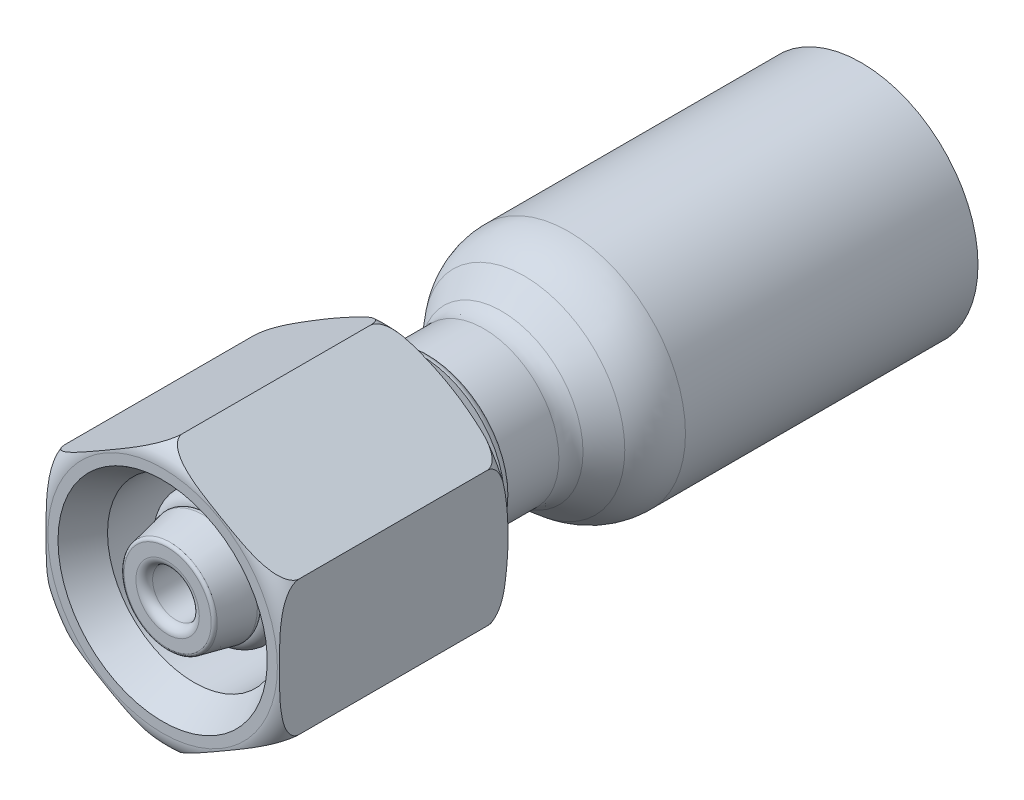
ISO-10303-21;
HEADER;
FILE_DESCRIPTION(('STEP AP214'),'2;1');
FILE_NAME('part.step','',(''),(''),'','','');
FILE_SCHEMA(('AUTOMOTIVE_DESIGN { 1 0 10303 214 1 1 1 1 }'));
ENDSEC;
DATA;
#1=APPLICATION_CONTEXT('core data for automotive mechanical design processes');
#2=APPLICATION_PROTOCOL_DEFINITION('international standard','automotive_design',2000,#1);
#3=PRODUCT_CONTEXT('',#1,'mechanical');
#4=PRODUCT('Part','Part','',(#3));
#5=PRODUCT_RELATED_PRODUCT_CATEGORY('part','',(#4));
#6=PRODUCT_DEFINITION_FORMATION('','',#4);
#7=PRODUCT_DEFINITION_CONTEXT('part definition',#1,'design');
#8=PRODUCT_DEFINITION('design','',#6,#7);
#9=PRODUCT_DEFINITION_SHAPE('','',#8);
#10=(LENGTH_UNIT() NAMED_UNIT(*) SI_UNIT(.MILLI.,.METRE.));
#11=(NAMED_UNIT(*) PLANE_ANGLE_UNIT() SI_UNIT($,.RADIAN.));
#12=(NAMED_UNIT(*) SI_UNIT($,.STERADIAN.) SOLID_ANGLE_UNIT());
#13=UNCERTAINTY_MEASURE_WITH_UNIT(LENGTH_MEASURE(1.E-05),#10,'distance_accuracy_value','');
#14=(GEOMETRIC_REPRESENTATION_CONTEXT(3) GLOBAL_UNCERTAINTY_ASSIGNED_CONTEXT((#13)) GLOBAL_UNIT_ASSIGNED_CONTEXT((#10,
#11,#12)) REPRESENTATION_CONTEXT('',''));
#15=CARTESIAN_POINT('',(0.,0.,0.));
#16=DIRECTION('',(0.,0.,1.));
#17=DIRECTION('',(1.,0.,0.));
#18=AXIS2_PLACEMENT_3D('',#15,#16,#17);
#19=CARTESIAN_POINT('',(0.,0.,37.943181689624));
#20=DIRECTION('',(0.,0.,1.));
#21=DIRECTION('',(1.,0.,0.));
#22=AXIS2_PLACEMENT_3D('',#19,#20,#21);
#23=TOROIDAL_SURFACE('',#22,3.05832186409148,0.75);
#24=ADVANCED_FACE('P0_F14',(),#23,.T.);
#25=CLOSED_SHELL('',(#24));
#26=MANIFOLD_SOLID_BREP('P0_B1',#25);
#27=CARTESIAN_POINT('',(5.5,0.,-0.3));
#28=DIRECTION('',(0.,0.,-1.));
#29=DIRECTION('',(-1.,0.,0.));
#30=AXIS2_PLACEMENT_3D('',#27,#28,#29);
#31=PLANE('',#30);
#32=CARTESIAN_POINT('',(0.,0.,-0.299999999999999));
#33=DIRECTION('',(0.,0.,1.));
#34=DIRECTION('',(1.,0.,0.));
#35=AXIS2_PLACEMENT_3D('',#32,#33,#34);
#36=CIRCLE('',#35,5.5);
#37=CARTESIAN_POINT('',(5.5,0.,-0.3));
#38=VERTEX_POINT('',#37);
#39=EDGE_CURVE('P1_E10',#38,#38,#36,.T.);
#40=ORIENTED_EDGE('',*,*,#39,.F.);
#41=EDGE_LOOP('',(#40));
#42=FACE_BOUND('',#41,.T.);
#43=ADVANCED_FACE('P1_F15',(#42),#31,.T.);
#44=CARTESIAN_POINT('',(0.,0.,-0.399999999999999));
#45=DIRECTION('',(0.,0.,1.));
#46=DIRECTION('',(1.,0.,0.));
#47=AXIS2_PLACEMENT_3D('',#44,#45,#46);
#48=CYLINDRICAL_SURFACE('',#47,5.5);
#49=ORIENTED_EDGE('',*,*,#39,.T.);
#50=EDGE_LOOP('',(#49));
#51=FACE_BOUND('',#50,.T.);
#52=CARTESIAN_POINT('',(0.,0.,-0.399999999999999));
#53=DIRECTION('',(0.,0.,1.));
#54=DIRECTION('',(1.,0.,0.));
#55=AXIS2_PLACEMENT_3D('',#52,#53,#54);
#56=CIRCLE('',#55,5.5);
#57=CARTESIAN_POINT('',(5.5,0.,-0.4));
#58=VERTEX_POINT('',#57);
#59=EDGE_CURVE('P1_E21',#58,#58,#56,.T.);
#60=ORIENTED_EDGE('',*,*,#59,.F.);
#61=EDGE_LOOP('',(#60));
#62=FACE_BOUND('',#61,.T.);
#63=ADVANCED_FACE('P1_F94',(#51,#62),#48,.F.);
#64=CARTESIAN_POINT('',(7.,0.,-0.4));
#65=DIRECTION('',(0.,0.,-1.));
#66=DIRECTION('',(-1.,0.,0.));
#67=AXIS2_PLACEMENT_3D('',#64,#65,#66);
#68=PLANE('',#67);
#69=ORIENTED_EDGE('',*,*,#59,.T.);
#70=EDGE_LOOP('',(#69));
#71=FACE_BOUND('',#70,.T.);
#72=CARTESIAN_POINT('',(0.,0.,-0.399999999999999));
#73=DIRECTION('',(0.,0.,1.));
#74=DIRECTION('',(1.,0.,0.));
#75=AXIS2_PLACEMENT_3D('',#72,#73,#74);
#76=CIRCLE('',#75,7.);
#77=CARTESIAN_POINT('',(7.,0.,-0.4));
#78=VERTEX_POINT('',#77);
#79=EDGE_CURVE('P1_E25',#78,#78,#76,.T.);
#80=ORIENTED_EDGE('',*,*,#79,.F.);
#81=EDGE_LOOP('',(#80));
#82=FACE_BOUND('',#81,.T.);
#83=ADVANCED_FACE('P1_F99',(#71,#82),#68,.T.);
#84=CARTESIAN_POINT('',(0.,0.,-0.399999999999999));
#85=DIRECTION('',(0.,0.,1.));
#86=DIRECTION('',(1.,0.,0.));
#87=AXIS2_PLACEMENT_3D('',#84,#85,#86);
#88=CYLINDRICAL_SURFACE('',#87,7.);
#89=ORIENTED_EDGE('',*,*,#79,.T.);
#90=EDGE_LOOP('',(#89));
#91=FACE_BOUND('',#90,.T.);
#92=CARTESIAN_POINT('',(0.,0.,17.1440243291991));
#93=DIRECTION('',(0.,0.,1.));
#94=DIRECTION('',(1.,0.,0.));
#95=AXIS2_PLACEMENT_3D('',#92,#93,#94);
#96=CIRCLE('',#95,7.);
#97=CARTESIAN_POINT('',(7.,0.,17.1440243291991));
#98=VERTEX_POINT('',#97);
#99=EDGE_CURVE('P1_E29',#98,#98,#96,.T.);
#100=ORIENTED_EDGE('',*,*,#99,.F.);
#101=EDGE_LOOP('',(#100));
#102=FACE_BOUND('',#101,.T.);
#103=ADVANCED_FACE('P1_F103',(#91,#102),#88,.T.);
#104=CARTESIAN_POINT('',(0.,0.,17.1440243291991));
#105=DIRECTION('',(0.,0.,1.));
#106=DIRECTION('',(1.,0.,0.));
#107=AXIS2_PLACEMENT_3D('',#104,#105,#106);
#108=DEGENERATE_TOROIDAL_SURFACE('',#107,2.85000000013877,4.14999999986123,.T.);
#109=ORIENTED_EDGE('',*,*,#99,.T.);
#110=EDGE_LOOP('',(#109));
#111=FACE_BOUND('',#110,.T.);
#112=CARTESIAN_POINT('',(0.,0.,19.8115929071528));
#113=DIRECTION('',(0.,0.,1.));
#114=DIRECTION('',(1.,0.,0.));
#115=AXIS2_PLACEMENT_3D('',#112,#113,#114);
#116=CIRCLE('',#115,6.02908444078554);
#117=CARTESIAN_POINT('',(6.02908444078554,0.,19.8115929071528));
#118=VERTEX_POINT('',#117);
#119=EDGE_CURVE('P1_E34',#118,#118,#116,.T.);
#120=ORIENTED_EDGE('',*,*,#119,.F.);
#121=EDGE_LOOP('',(#120));
#122=FACE_BOUND('',#121,.T.);
#123=ADVANCED_FACE('P1_F109',(#111,#122),#108,.T.);
#124=CARTESIAN_POINT('',(0.,0.,21.1741377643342));
#125=DIRECTION('',(0.,0.,-1.));
#126=DIRECTION('',(-1.,0.,0.));
#127=AXIS2_PLACEMENT_3D('',#124,#125,#126);
#128=CONICAL_SURFACE('',#127,4.88577355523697,0.698131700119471);
#129=ORIENTED_EDGE('',*,*,#119,.T.);
#130=EDGE_LOOP('',(#129));
#131=FACE_BOUND('',#130,.T.);
#132=CARTESIAN_POINT('',(0.,0.,21.1741377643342));
#133=DIRECTION('',(0.,0.,1.));
#134=DIRECTION('',(1.,0.,0.));
#135=AXIS2_PLACEMENT_3D('',#132,#133,#134);
#136=CIRCLE('',#135,4.88577355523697);
#137=CARTESIAN_POINT('',(4.88577355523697,0.,21.1741377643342));
#138=VERTEX_POINT('',#137);
#139=EDGE_CURVE('P1_E37',#138,#138,#136,.T.);
#140=ORIENTED_EDGE('',*,*,#139,.F.);
#141=EDGE_LOOP('',(#140));
#142=FACE_BOUND('',#141,.T.);
#143=ADVANCED_FACE('P1_F113',(#131,#142),#128,.T.);
#144=CARTESIAN_POINT('',(0.,0.,22.2340418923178));
#145=DIRECTION('',(0.,0.,1.));
#146=DIRECTION('',(1.,0.,0.));
#147=AXIS2_PLACEMENT_3D('',#144,#145,#146);
#148=TOROIDAL_SURFACE('',#147,6.14891810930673,1.64891810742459);
#149=ORIENTED_EDGE('',*,*,#139,.T.);
#150=EDGE_LOOP('',(#149));
#151=FACE_BOUND('',#150,.T.);
#152=CARTESIAN_POINT('',(0.,0.,22.2340418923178));
#153=DIRECTION('',(0.,0.,1.));
#154=DIRECTION('',(1.,0.,0.));
#155=AXIS2_PLACEMENT_3D('',#152,#153,#154);
#156=CIRCLE('',#155,4.50000000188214);
#157=CARTESIAN_POINT('',(4.50000000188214,0.,22.2340418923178));
#158=VERTEX_POINT('',#157);
#159=EDGE_CURVE('P1_E40',#158,#158,#156,.T.);
#160=ORIENTED_EDGE('',*,*,#159,.F.);
#161=EDGE_LOOP('',(#160));
#162=FACE_BOUND('',#161,.T.);
#163=ADVANCED_FACE('P1_F117',(#151,#162),#148,.F.);
#164=CARTESIAN_POINT('',(0.,0.,-0.399999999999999));
#165=DIRECTION('',(0.,0.,1.));
#166=DIRECTION('',(1.,0.,0.));
#167=AXIS2_PLACEMENT_3D('',#164,#165,#166);
#168=CYLINDRICAL_SURFACE('',#167,4.50000000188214);
#169=ORIENTED_EDGE('',*,*,#159,.T.);
#170=EDGE_LOOP('',(#169));
#171=FACE_BOUND('',#170,.T.);
#172=CARTESIAN_POINT('',(0.,0.,25.5));
#173=DIRECTION('',(0.,0.,1.));
#174=DIRECTION('',(1.,0.,0.));
#175=AXIS2_PLACEMENT_3D('',#172,#173,#174);
#176=CIRCLE('',#175,4.50000000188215);
#177=CARTESIAN_POINT('',(4.50000000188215,0.,25.5));
#178=VERTEX_POINT('',#177);
#179=EDGE_CURVE('P1_E43',#178,#178,#176,.T.);
#180=ORIENTED_EDGE('',*,*,#179,.F.);
#181=EDGE_LOOP('',(#180));
#182=FACE_BOUND('',#181,.T.);
#183=ADVANCED_FACE('P1_F121',(#171,#182),#168,.T.);
#184=CARTESIAN_POINT('',(0.,0.,26.));
#185=DIRECTION('',(0.,0.,1.));
#186=DIRECTION('',(1.,0.,0.));
#187=AXIS2_PLACEMENT_3D('',#184,#185,#186);
#188=TOROIDAL_SURFACE('',#187,4.50000000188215,0.499999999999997);
#189=ORIENTED_EDGE('',*,*,#179,.T.);
#190=EDGE_LOOP('',(#189));
#191=FACE_BOUND('',#190,.T.);
#192=CARTESIAN_POINT('',(0.,0.,26.));
#193=DIRECTION('',(0.,0.,1.));
#194=DIRECTION('',(1.,0.,0.));
#195=AXIS2_PLACEMENT_3D('',#192,#193,#194);
#196=CIRCLE('',#195,5.00000000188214);
#197=CARTESIAN_POINT('',(5.00000000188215,0.,26.));
#198=VERTEX_POINT('',#197);
#199=EDGE_CURVE('P1_E46',#198,#198,#196,.T.);
#200=ORIENTED_EDGE('',*,*,#199,.F.);
#201=EDGE_LOOP('',(#200));
#202=FACE_BOUND('',#201,.T.);
#203=ADVANCED_FACE('P1_F125',(#191,#202),#188,.T.);
#204=CARTESIAN_POINT('',(2.88692663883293,0.,26.));
#205=DIRECTION('',(0.,0.,1.));
#206=DIRECTION('',(1.,0.,0.));
#207=AXIS2_PLACEMENT_3D('',#204,#205,#206);
#208=PLANE('',#207);
#209=ORIENTED_EDGE('',*,*,#199,.T.);
#210=EDGE_LOOP('',(#209));
#211=FACE_BOUND('',#210,.T.);
#212=CARTESIAN_POINT('',(0.,0.,26.));
#213=DIRECTION('',(0.,0.,1.));
#214=DIRECTION('',(1.,0.,0.));
#215=AXIS2_PLACEMENT_3D('',#212,#213,#214);
#216=CIRCLE('',#215,2.88692663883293);
#217=CARTESIAN_POINT('',(2.88692663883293,0.,26.));
#218=VERTEX_POINT('',#217);
#219=EDGE_CURVE('P1_E49',#218,#218,#216,.T.);
#220=ORIENTED_EDGE('',*,*,#219,.F.);
#221=EDGE_LOOP('',(#220));
#222=FACE_BOUND('',#221,.T.);
#223=ADVANCED_FACE('P1_F129',(#211,#222),#208,.T.);
#224=CARTESIAN_POINT('',(0.,0.,25.8505707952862));
#225=DIRECTION('',(0.,0.,1.));
#226=DIRECTION('',(1.,0.,0.));
#227=AXIS2_PLACEMENT_3D('',#224,#225,#226);
#228=TOROIDAL_SURFACE('',#227,2.90000000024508,0.149999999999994);
#229=ORIENTED_EDGE('',*,*,#219,.T.);
#230=EDGE_LOOP('',(#229));
#231=FACE_BOUND('',#230,.T.);
#232=CARTESIAN_POINT('',(0.,0.,25.8505707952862));
#233=DIRECTION('',(0.,0.,1.));
#234=DIRECTION('',(1.,0.,0.));
#235=AXIS2_PLACEMENT_3D('',#232,#233,#234);
#236=CIRCLE('',#235,2.75000000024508);
#237=CARTESIAN_POINT('',(2.75000000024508,0.,25.8505707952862));
#238=VERTEX_POINT('',#237);
#239=EDGE_CURVE('P1_E52',#238,#238,#236,.T.);
#240=ORIENTED_EDGE('',*,*,#239,.F.);
#241=EDGE_LOOP('',(#240));
#242=FACE_BOUND('',#241,.T.);
#243=ADVANCED_FACE('P1_F133',(#231,#242),#228,.T.);
#244=CARTESIAN_POINT('',(0.,0.,-0.399999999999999));
#245=DIRECTION('',(0.,0.,1.));
#246=DIRECTION('',(1.,0.,0.));
#247=AXIS2_PLACEMENT_3D('',#244,#245,#246);
#248=CYLINDRICAL_SURFACE('',#247,2.75000000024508);
#249=ORIENTED_EDGE('',*,*,#239,.T.);
#250=EDGE_LOOP('',(#249));
#251=FACE_BOUND('',#250,.T.);
#252=CARTESIAN_POINT('',(0.,0.,24.0763655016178));
#253=DIRECTION('',(0.,0.,1.));
#254=DIRECTION('',(1.,0.,0.));
#255=AXIS2_PLACEMENT_3D('',#252,#253,#254);
#256=CIRCLE('',#255,2.75000000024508);
#257=CARTESIAN_POINT('',(2.75000000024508,0.,24.0763655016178));
#258=VERTEX_POINT('',#257);
#259=EDGE_CURVE('P1_E55',#258,#258,#256,.T.);
#260=ORIENTED_EDGE('',*,*,#259,.F.);
#261=EDGE_LOOP('',(#260));
#262=FACE_BOUND('',#261,.T.);
#263=ADVANCED_FACE('P1_F137',(#251,#262),#248,.F.);
#264=CARTESIAN_POINT('',(0.,0.,24.0763655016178));
#265=DIRECTION('',(0.,0.,1.));
#266=DIRECTION('',(1.,0.,0.));
#267=AXIS2_PLACEMENT_3D('',#264,#265,#266);
#268=TOROIDAL_SURFACE('',#267,3.55000000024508,0.8);
#269=ORIENTED_EDGE('',*,*,#259,.T.);
#270=EDGE_LOOP('',(#269));
#271=FACE_BOUND('',#270,.T.);
#272=CARTESIAN_POINT('',(0.,0.,23.4976595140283));
#273=DIRECTION('',(0.,0.,1.));
#274=DIRECTION('',(1.,0.,0.));
#275=AXIS2_PLACEMENT_3D('',#272,#273,#274);
#276=CIRCLE('',#275,2.9976419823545);
#277=CARTESIAN_POINT('',(2.9976419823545,0.,23.4976595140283));
#278=VERTEX_POINT('',#277);
#279=EDGE_CURVE('P1_E58',#278,#278,#276,.T.);
#280=ORIENTED_EDGE('',*,*,#279,.F.);
#281=EDGE_LOOP('',(#280));
#282=FACE_BOUND('',#281,.T.);
#283=ADVANCED_FACE('P1_F141',(#271,#282),#268,.T.);
#284=CARTESIAN_POINT('',(0.,0.,21.0651429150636));
#285=DIRECTION('',(0.,0.,1.));
#286=DIRECTION('',(1.,0.,0.));
#287=AXIS2_PLACEMENT_3D('',#284,#285,#286);
#288=DEGENERATE_TOROIDAL_SURFACE('',#287,0.675875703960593,3.3626976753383,.T.);
#289=ORIENTED_EDGE('',*,*,#279,.T.);
#290=EDGE_LOOP('',(#289));
#291=FACE_BOUND('',#290,.T.);
#292=CARTESIAN_POINT('',(0.,0.,21.8771072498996));
#293=DIRECTION('',(0.,0.,1.));
#294=DIRECTION('',(1.,0.,0.));
#295=AXIS2_PLACEMENT_3D('',#292,#293,#294);
#296=CIRCLE('',#295,3.93907192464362);
#297=CARTESIAN_POINT('',(3.93907192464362,0.,21.8771072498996));
#298=VERTEX_POINT('',#297);
#299=EDGE_CURVE('P1_E61',#298,#298,#296,.T.);
#300=ORIENTED_EDGE('',*,*,#299,.F.);
#301=EDGE_LOOP('',(#300));
#302=FACE_BOUND('',#301,.T.);
#303=ADVANCED_FACE('P1_F145',(#291,#302),#288,.F.);
#304=CARTESIAN_POINT('',(0.,0.,23.0119795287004));
#305=DIRECTION('',(0.,0.,1.));
#306=DIRECTION('',(1.,0.,0.));
#307=AXIS2_PLACEMENT_3D('',#304,#305,#306);
#308=TOROIDAL_SURFACE('',#307,8.50000000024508,4.7);
#309=ORIENTED_EDGE('',*,*,#299,.T.);
#310=EDGE_LOOP('',(#309));
#311=FACE_BOUND('',#310,.T.);
#312=CARTESIAN_POINT('',(0.,0.,19.990877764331));
#313=DIRECTION('',(0.,0.,1.));
#314=DIRECTION('',(1.,0.,0.));
#315=AXIS2_PLACEMENT_3D('',#312,#313,#314);
#316=CIRCLE('',#315,4.89959111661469);
#317=CARTESIAN_POINT('',(4.8995911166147,0.,19.990877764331));
#318=VERTEX_POINT('',#317);
#319=EDGE_CURVE('P1_E64',#318,#318,#316,.T.);
#320=ORIENTED_EDGE('',*,*,#319,.F.);
#321=EDGE_LOOP('',(#320));
#322=FACE_BOUND('',#321,.T.);
#323=ADVANCED_FACE('P1_F149',(#311,#322),#308,.T.);
#324=CARTESIAN_POINT('',(0.,0.,19.3295022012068));
#325=DIRECTION('',(0.,0.,-1.));
#326=DIRECTION('',(-1.,0.,0.));
#327=AXIS2_PLACEMENT_3D('',#324,#325,#326);
#328=CONICAL_SURFACE('',#327,5.4545511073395,0.698131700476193);
#329=ORIENTED_EDGE('',*,*,#319,.T.);
#330=EDGE_LOOP('',(#329));
#331=FACE_BOUND('',#330,.T.);
#332=CARTESIAN_POINT('',(0.,0.,19.3295022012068));
#333=DIRECTION('',(0.,0.,1.));
#334=DIRECTION('',(1.,0.,0.));
#335=AXIS2_PLACEMENT_3D('',#332,#333,#334);
#336=CIRCLE('',#335,5.4545511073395);
#337=CARTESIAN_POINT('',(5.4545511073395,0.,19.3295022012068));
#338=VERTEX_POINT('',#337);
#339=EDGE_CURVE('P1_E67',#338,#338,#336,.T.);
#340=ORIENTED_EDGE('',*,*,#339,.F.);
#341=EDGE_LOOP('',(#340));
#342=FACE_BOUND('',#341,.T.);
#343=ADVANCED_FACE('P1_F90',(#331,#342),#328,.F.);
#344=CARTESIAN_POINT('',(0.,0.,17.1440243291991));
#345=DIRECTION('',(0.,0.,1.));
#346=DIRECTION('',(1.,0.,0.));
#347=AXIS2_PLACEMENT_3D('',#344,#345,#346);
#348=DEGENERATE_TOROIDAL_SURFACE('',#347,2.85000000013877,3.39999999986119,.T.);
#349=ORIENTED_EDGE('',*,*,#339,.T.);
#350=EDGE_LOOP('',(#349));
#351=FACE_BOUND('',#350,.T.);
#352=CARTESIAN_POINT('',(0.,0.,17.1440243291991));
#353=DIRECTION('',(0.,0.,1.));
#354=DIRECTION('',(1.,0.,0.));
#355=AXIS2_PLACEMENT_3D('',#352,#353,#354);
#356=CIRCLE('',#355,6.24999999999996);
#357=CARTESIAN_POINT('',(6.24999999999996,0.,17.1440243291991));
#358=VERTEX_POINT('',#357);
#359=EDGE_CURVE('P1_E70',#358,#358,#356,.T.);
#360=ORIENTED_EDGE('',*,*,#359,.F.);
#361=EDGE_LOOP('',(#360));
#362=FACE_BOUND('',#361,.T.);
#363=ADVANCED_FACE('P1_F81',(#351,#362),#348,.F.);
#364=CARTESIAN_POINT('',(0.,0.,-0.399999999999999));
#365=DIRECTION('',(0.,0.,1.));
#366=DIRECTION('',(1.,0.,0.));
#367=AXIS2_PLACEMENT_3D('',#364,#365,#366);
#368=CYLINDRICAL_SURFACE('',#367,6.24999999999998);
#369=ORIENTED_EDGE('',*,*,#359,.T.);
#370=EDGE_LOOP('',(#369));
#371=FACE_BOUND('',#370,.T.);
#372=CARTESIAN_POINT('',(0.,0.,16.));
#373=DIRECTION('',(0.,0.,1.));
#374=DIRECTION('',(1.,0.,0.));
#375=AXIS2_PLACEMENT_3D('',#372,#373,#374);
#376=CIRCLE('',#375,6.25);
#377=CARTESIAN_POINT('',(6.25,0.,16.));
#378=VERTEX_POINT('',#377);
#379=EDGE_CURVE('P1_E73',#378,#378,#376,.T.);
#380=ORIENTED_EDGE('',*,*,#379,.F.);
#381=EDGE_LOOP('',(#380));
#382=FACE_BOUND('',#381,.T.);
#383=ADVANCED_FACE('P1_F79',(#371,#382),#368,.F.);
#384=CARTESIAN_POINT('',(0.,0.,16.));
#385=DIRECTION('',(0.,0.,1.));
#386=DIRECTION('',(1.,0.,0.));
#387=AXIS2_PLACEMENT_3D('',#384,#385,#386);
#388=PLANE('',#387);
#389=ORIENTED_EDGE('',*,*,#379,.T.);
#390=EDGE_LOOP('',(#389));
#391=FACE_BOUND('',#390,.T.);
#392=ADVANCED_FACE('P1_F77',(#391),#388,.T.);
#393=CLOSED_SHELL('',(#43,#63,#83,#103,#123,#143,#163,#183,#203,#223,#243,#263,#283,#303,#323,
#343,#363,#383,#392));
#394=MANIFOLD_SOLID_BREP('P1_B1',#393);
#395=CARTESIAN_POINT('',(0.,0.,14.8831327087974));
#396=DIRECTION('',(0.,0.,-1.));
#397=DIRECTION('',(-1.,0.,0.));
#398=AXIS2_PLACEMENT_3D('',#395,#396,#397);
#399=TOROIDAL_SURFACE('',#398,2.25,0.2);
#400=CARTESIAN_POINT('',(0.,0.,15.0820370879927));
#401=DIRECTION('',(0.,0.,-1.));
#402=DIRECTION('',(0.,1.,0.));
#403=AXIS2_PLACEMENT_3D('',#400,#401,#402);
#404=CIRCLE('',#403,2.27090569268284);
#405=CARTESIAN_POINT('',(0.,2.27090569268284,15.0820370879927));
#406=VERTEX_POINT('',#405);
#407=EDGE_CURVE('P2_E248',#406,#406,#404,.F.);
#408=ORIENTED_EDGE('',*,*,#407,.F.);
#409=EDGE_LOOP('',(#408));
#410=FACE_BOUND('',#409,.T.);
#411=CARTESIAN_POINT('',(0.,0.,15.));
#412=DIRECTION('',(0.,0.,-1.));
#413=DIRECTION('',(-1.,0.,0.));
#414=AXIS2_PLACEMENT_3D('',#411,#412,#413);
#415=CIRCLE('',#414,2.41230229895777);
#416=CARTESIAN_POINT('',(-2.41230229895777,0.,15.));
#417=VERTEX_POINT('',#416);
#418=EDGE_CURVE('P2_E250',#417,#417,#415,.F.);
#419=ORIENTED_EDGE('',*,*,#418,.T.);
#420=EDGE_LOOP('',(#419));
#421=FACE_BOUND('',#420,.T.);
#422=ADVANCED_FACE('P2_F16',(#410,#421),#399,.T.);
#423=CARTESIAN_POINT('',(0.,0.,0.));
#424=DIRECTION('',(0.,0.,1.));
#425=DIRECTION('',(1.,0.,0.));
#426=AXIS2_PLACEMENT_3D('',#423,#424,#425);
#427=CYLINDRICAL_SURFACE('',#426,1.4);
#428=CARTESIAN_POINT('',(0.,0.,40.7));
#429=DIRECTION('',(0.,0.,1.));
#430=DIRECTION('',(1.,0.,0.));
#431=AXIS2_PLACEMENT_3D('',#428,#429,#430);
#432=CIRCLE('',#431,1.4);
#433=CARTESIAN_POINT('',(1.4,0.,40.7));
#434=VERTEX_POINT('',#433);
#435=EDGE_CURVE('P2_E10',#434,#434,#432,.F.);
#436=ORIENTED_EDGE('',*,*,#435,.F.);
#437=EDGE_LOOP('',(#436));
#438=FACE_BOUND('',#437,.T.);
#439=CARTESIAN_POINT('',(0.,0.,15.));
#440=DIRECTION('',(0.,0.,-1.));
#441=DIRECTION('',(-1.,0.,0.));
#442=AXIS2_PLACEMENT_3D('',#439,#440,#441);
#443=CIRCLE('',#442,1.4);
#444=CARTESIAN_POINT('',(-1.4,0.,15.));
#445=VERTEX_POINT('',#444);
#446=EDGE_CURVE('P2_E20',#445,#445,#443,.F.);
#447=ORIENTED_EDGE('',*,*,#446,.F.);
#448=EDGE_LOOP('',(#447));
#449=FACE_BOUND('',#448,.T.);
#450=ADVANCED_FACE('P2_F94',(#438,#449),#427,.F.);
#451=CARTESIAN_POINT('',(0.,0.,15.0820370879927));
#452=DIRECTION('',(0.,0.,-1.));
#453=DIRECTION('',(-1.,0.,0.));
#454=AXIS2_PLACEMENT_3D('',#451,#452,#453);
#455=CONICAL_SURFACE('',#454,2.27090569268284,1.46607657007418);
#456=ORIENTED_EDGE('',*,*,#407,.T.);
#457=EDGE_LOOP('',(#456));
#458=FACE_BOUND('',#457,.T.);
#459=CARTESIAN_POINT('',(0.,0.,15.0858823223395));
#460=DIRECTION('',(0.,0.,1.));
#461=DIRECTION('',(1.,0.,0.));
#462=AXIS2_PLACEMENT_3D('',#459,#460,#461);
#463=CIRCLE('',#462,2.23432073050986);
#464=CARTESIAN_POINT('',(2.23432073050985,0.,15.0858823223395));
#465=VERTEX_POINT('',#464);
#466=EDGE_CURVE('P2_E245',#465,#465,#463,.F.);
#467=ORIENTED_EDGE('',*,*,#466,.T.);
#468=EDGE_LOOP('',(#467));
#469=FACE_BOUND('',#468,.T.);
#470=ADVANCED_FACE('P2_F293',(#458,#469),#455,.T.);
#471=CARTESIAN_POINT('',(0.,0.,15.2350606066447));
#472=DIRECTION('',(0.,0.,1.));
#473=DIRECTION('',(1.,0.,0.));
#474=AXIS2_PLACEMENT_3D('',#471,#472,#473);
#475=TOROIDAL_SURFACE('',#474,2.25,0.15);
#476=CARTESIAN_POINT('',(0.,0.,15.2350606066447));
#477=DIRECTION('',(0.,0.,1.));
#478=DIRECTION('',(1.,0.,0.));
#479=AXIS2_PLACEMENT_3D('',#476,#477,#478);
#480=CIRCLE('',#479,2.1);
#481=CARTESIAN_POINT('',(2.1,0.,15.2350606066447));
#482=VERTEX_POINT('',#481);
#483=EDGE_CURVE('P2_E68',#482,#482,#480,.T.);
#484=ORIENTED_EDGE('',*,*,#483,.F.);
#485=EDGE_LOOP('',(#484));
#486=FACE_BOUND('',#485,.T.);
#487=ORIENTED_EDGE('',*,*,#466,.F.);
#488=EDGE_LOOP('',(#487));
#489=FACE_BOUND('',#488,.T.);
#490=ADVANCED_FACE('P2_F307',(#486,#489),#475,.F.);
#491=CARTESIAN_POINT('',(0.,0.,18.0675303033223));
#492=DIRECTION('',(0.,0.,1.));
#493=DIRECTION('',(1.,0.,0.));
#494=AXIS2_PLACEMENT_3D('',#491,#492,#493);
#495=CYLINDRICAL_SURFACE('',#494,2.1);
#496=ORIENTED_EDGE('',*,*,#483,.T.);
#497=EDGE_LOOP('',(#496));
#498=FACE_BOUND('',#497,.T.);
#499=CARTESIAN_POINT('',(0.,0.,20.15));
#500=DIRECTION('',(0.,0.,1.));
#501=DIRECTION('',(0.,-1.,0.));
#502=AXIS2_PLACEMENT_3D('',#499,#500,#501);
#503=CIRCLE('',#502,2.1);
#504=CARTESIAN_POINT('',(0.,-2.1,20.15));
#505=VERTEX_POINT('',#504);
#506=EDGE_CURVE('P2_E65',#505,#505,#503,.T.);
#507=ORIENTED_EDGE('',*,*,#506,.F.);
#508=EDGE_LOOP('',(#507));
#509=FACE_BOUND('',#508,.T.);
#510=ADVANCED_FACE('P2_F263',(#498,#509),#495,.T.);
#511=CARTESIAN_POINT('',(0.,0.,20.15));
#512=DIRECTION('',(0.,0.,1.));
#513=DIRECTION('',(0.,-1.,0.));
#514=AXIS2_PLACEMENT_3D('',#511,#512,#513);
#515=TOROIDAL_SURFACE('',#514,2.85,0.75);
#516=CARTESIAN_POINT('',(0.,0.,20.9));
#517=DIRECTION('',(0.,0.,1.));
#518=DIRECTION('',(0.,-1.,0.));
#519=AXIS2_PLACEMENT_3D('',#516,#517,#518);
#520=CIRCLE('',#519,2.84999999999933);
#521=CARTESIAN_POINT('',(2.84999999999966,0.,20.9));
#522=VERTEX_POINT('',#521);
#523=CARTESIAN_POINT('',(-2.84999999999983,0.,20.9));
#524=VERTEX_POINT('',#523);
#525=EDGE_CURVE('P2_E54',#522,#524,#520,.F.);
#526=ORIENTED_EDGE('',*,*,#525,.T.);
#527=CARTESIAN_POINT('',(-2.85,0.,20.9));
#528=CARTESIAN_POINT('',(-2.84999370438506,0.0357804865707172,20.8999999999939));
#529=CARTESIAN_POINT('',(-2.8493137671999,0.0715608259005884,20.8999999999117));
#530=CARTESIAN_POINT('',(-2.84660907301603,0.143070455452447,20.8999999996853));
#531=CARTESIAN_POINT('',(-2.8445843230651,0.178799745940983,20.8999999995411));
#532=CARTESIAN_POINT('',(-2.83919247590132,0.250156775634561,20.8999999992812));
#533=CARTESIAN_POINT('',(-2.83582538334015,0.285784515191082,20.8999999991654));
#534=CARTESIAN_POINT('',(-2.82775372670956,0.356888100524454,20.8999999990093));
#535=CARTESIAN_POINT('',(-2.8230491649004,0.392363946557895,20.8999999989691));
#536=CARTESIAN_POINT('',(-2.81230919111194,0.46311362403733,20.8999999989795));
#537=CARTESIAN_POINT('',(-2.80627377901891,0.49838745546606,20.8999999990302));
#538=CARTESIAN_POINT('',(-2.79288064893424,0.568683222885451,20.8999999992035));
#539=CARTESIAN_POINT('',(-2.78552292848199,0.603705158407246,20.8999999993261));
#540=CARTESIAN_POINT('',(-2.76949554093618,0.673447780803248,20.8999999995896));
#541=CARTESIAN_POINT('',(-2.76082586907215,0.708168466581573,20.8999999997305));
#542=CARTESIAN_POINT('',(-2.7421869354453,0.777259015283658,20.8999999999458));
#543=CARTESIAN_POINT('',(-2.73221766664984,0.811628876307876,20.9000000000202));
#544=CARTESIAN_POINT('',(-2.70947735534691,0.884852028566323,20.8999999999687));
#545=CARTESIAN_POINT('',(-2.6965095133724,0.923644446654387,20.8999999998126));
#546=CARTESIAN_POINT('',(-2.67181848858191,0.992541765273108,20.899999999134));
#547=CARTESIAN_POINT('',(-2.66040665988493,1.02275875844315,20.8999999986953));
#548=CARTESIAN_POINT('',(-2.63693677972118,1.081844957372,20.899999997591));
#549=CARTESIAN_POINT('',(-2.62491027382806,1.11072668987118,20.899999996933));
#550=CARTESIAN_POINT('',(-2.59834198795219,1.17168295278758,20.8999999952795));
#551=CARTESIAN_POINT('',(-2.58367404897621,1.20370258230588,20.899999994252));
#552=CARTESIAN_POINT('',(-2.55375995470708,1.26593180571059,20.8999999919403));
#553=CARTESIAN_POINT('',(-2.53855900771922,1.29616314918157,20.8999999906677));
#554=CARTESIAN_POINT('',(-2.50773245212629,1.35484332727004,20.8999999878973));
#555=CARTESIAN_POINT('',(-2.49214947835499,1.38331456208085,20.8999999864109));
#556=CARTESIAN_POINT('',(-2.46070381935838,1.43850857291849,20.8999999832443));
#557=CARTESIAN_POINT('',(-2.44488123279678,1.46525420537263,20.8999999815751));
#558=CARTESIAN_POINT('',(-2.41309214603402,1.51703737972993,20.8999999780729));
#559=CARTESIAN_POINT('',(-2.39716327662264,1.54209801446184,20.8999999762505));
#560=CARTESIAN_POINT('',(-2.36528966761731,1.59055506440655,20.8999999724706));
#561=CARTESIAN_POINT('',(-2.34938010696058,1.6139746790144,20.8999999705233));
#562=CARTESIAN_POINT('',(-2.30299349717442,1.6801155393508,20.899999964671));
#563=CARTESIAN_POINT('',(-2.27167282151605,1.72225007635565,20.8999999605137));
#564=CARTESIAN_POINT('',(-2.21017168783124,1.80038289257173,20.899999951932));
#565=CARTESIAN_POINT('',(-2.18021803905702,1.83656033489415,20.8999999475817));
#566=CARTESIAN_POINT('',(-2.12218645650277,1.90322594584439,20.8999999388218));
#567=CARTESIAN_POINT('',(-2.09430224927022,1.93388281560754,20.8999999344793));
#568=CARTESIAN_POINT('',(-2.04102876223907,1.98994796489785,20.8999999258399));
#569=CARTESIAN_POINT('',(-2.01580238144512,2.01551114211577,20.8999999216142));
#570=CARTESIAN_POINT('',(-1.9683561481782,2.06180764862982,20.8999999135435));
#571=CARTESIAN_POINT('',(-1.94627067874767,2.08267908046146,20.89999990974));
#572=CARTESIAN_POINT('',(-1.89125387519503,2.13303228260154,20.8999998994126));
#573=CARTESIAN_POINT('',(-1.85795557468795,2.16211572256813,20.8999998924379));
#574=CARTESIAN_POINT('',(-1.80702073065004,2.20455251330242,20.8999998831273));
#575=CARTESIAN_POINT('',(-1.78987634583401,2.21850121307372,20.8999998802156));
#576=CARTESIAN_POINT('',(-1.77045604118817,2.23393738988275,20.8999998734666));
#577=CARTESIAN_POINT('',(-1.76833415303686,2.23561914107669,20.8999998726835));
#578=CARTESIAN_POINT('',(-1.74926593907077,2.25069258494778,20.8999998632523));
#579=CARTESIAN_POINT('',(-1.73218489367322,2.26391539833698,20.8999998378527));
#580=CARTESIAN_POINT('',(-1.69760183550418,2.29003221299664,20.8999998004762));
#581=CARTESIAN_POINT('',(-1.68009782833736,2.30292356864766,20.8999997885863));
#582=CARTESIAN_POINT('',(-1.63128869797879,2.33800674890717,20.8999997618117));
#583=CARTESIAN_POINT('',(-1.59967196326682,2.35976711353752,20.8999997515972));
#584=CARTESIAN_POINT('',(-1.53521739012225,2.4022001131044,20.8999997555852));
#585=CARTESIAN_POINT('',(-1.50236995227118,2.42285817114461,20.8999997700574));
#586=CARTESIAN_POINT('',(-1.4499416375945,2.45433325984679,20.8999998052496));
#587=CARTESIAN_POINT('',(-1.43063618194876,2.46561155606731,20.8999998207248));
#588=CARTESIAN_POINT('',(-1.39164077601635,2.48776969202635,20.8999998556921));
#589=CARTESIAN_POINT('',(-1.37194919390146,2.49864666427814,20.8999998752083));
#590=CARTESIAN_POINT('',(-1.33410089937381,2.51896886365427,20.8999999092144));
#591=CARTESIAN_POINT('',(-1.3159659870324,2.52845472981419,20.8999999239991));
#592=CARTESIAN_POINT('',(-1.28032506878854,2.54661688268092,20.8999999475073));
#593=CARTESIAN_POINT('',(-1.26282781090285,2.55531037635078,20.8999999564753));
#594=CARTESIAN_POINT('',(-1.20746044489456,2.58211921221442,20.8999999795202));
#595=CARTESIAN_POINT('',(-1.16927411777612,2.59958720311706,20.8999999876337));
#596=CARTESIAN_POINT('',(-1.09681303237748,2.63084262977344,20.8999999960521));
#597=CARTESIAN_POINT('',(-1.0626199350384,2.6448200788,20.8999999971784));
#598=CARTESIAN_POINT('',(-1.00645012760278,2.66654005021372,20.899999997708));
#599=CARTESIAN_POINT('',(-0.98462588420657,2.67467865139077,20.899999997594));
#600=CARTESIAN_POINT('',(-0.943213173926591,2.68956580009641,20.8999999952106));
#601=CARTESIAN_POINT('',(-0.923644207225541,2.69636856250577,20.8999999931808));
#602=CARTESIAN_POINT('',(-0.884624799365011,2.70946522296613,20.8999999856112));
#603=CARTESIAN_POINT('',(-0.865176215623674,2.71576466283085,20.8999999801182));
#604=CARTESIAN_POINT('',(-0.811509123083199,2.73250333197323,20.8999999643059));
#605=CARTESIAN_POINT('',(-0.777152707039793,2.74250407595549,20.8999999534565));
#606=CARTESIAN_POINT('',(-0.708085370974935,2.7611956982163,20.8999999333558));
#607=CARTESIAN_POINT('',(-0.673374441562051,2.76988654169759,20.8999999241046));
#608=CARTESIAN_POINT('',(-0.603646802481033,2.78594393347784,20.8999999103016));
#609=CARTESIAN_POINT('',(-0.568630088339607,2.79331046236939,20.89999990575));
#610=CARTESIAN_POINT('',(-0.498342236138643,2.80670894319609,20.8999999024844));
#611=CARTESIAN_POINT('',(-0.463071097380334,2.8127408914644,20.8999999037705));
#612=CARTESIAN_POINT('',(-0.39232554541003,2.82346130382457,20.8999999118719));
#613=CARTESIAN_POINT('',(-0.356851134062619,2.82814978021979,20.8999999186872));
#614=CARTESIAN_POINT('',(-0.285750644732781,2.8361765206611,20.8999999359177));
#615=CARTESIAN_POINT('',(-0.250124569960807,2.83951481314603,20.899999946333));
#616=CARTESIAN_POINT('',(-0.178772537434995,2.84483627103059,20.8999999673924));
#617=CARTESIAN_POINT('',(-0.143046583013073,2.84681948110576,20.8999999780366));
#618=CARTESIAN_POINT('',(-0.0715467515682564,2.84942839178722,20.8999999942));
#619=CARTESIAN_POINT('',(-0.0357728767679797,2.8500541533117,20.8999999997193));
#620=CARTESIAN_POINT('',(0.,2.85,20.9));
#621=B_SPLINE_CURVE_WITH_KNOTS('',3,(#527,#528,#529,#530,#531,#532,#533,#534,#535,#536,#537,
#538,#539,#540,#541,#542,#543,#544,#545,#546,#547,#548,#549,#550,#551,#552,#553,#554,#555,#556,
#557,#558,#559,#560,#561,#562,#563,#564,#565,#566,#567,#568,#569,#570,#571,#572,#573,#574,#575,
#576,#577,#578,#579,#580,#581,#582,#583,#584,#585,#586,#587,#588,#589,#590,#591,#592,#593,#594,
#595,#596,#597,#598,#599,#600,#601,#602,#603,#604,#605,#606,#607,#608,#609,#610,#611,#612,#613,
#614,#615,#616,#617,#618,#619,#620),.UNSPECIFIED.,.F.,.F.,(4,2,2,2,2,2,2,2,2,2,2,2,2,2,2,2,2,2,
2,2,2,2,2,2,2,2,2,2,2,2,2,2,2,2,2,2,2,2,2,2,2,2,2,2,2,2,4),(0.,0.107335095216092,
0.214669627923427,0.322003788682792,0.42933776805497,0.536671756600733,0.644005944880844,
0.751340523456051,0.858675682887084,0.981343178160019,1.07822567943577,1.1720658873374,
1.27769927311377,1.3791916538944,1.47654286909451,1.5697527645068,1.65882119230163,
1.74374801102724,1.90116128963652,2.04201085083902,2.16629490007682,2.27401184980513,
2.36516031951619,2.49773851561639,2.56403917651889,2.57216176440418,2.63695838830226,
2.70216966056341,2.81727991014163,2.93365481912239,3.00072459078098,3.06820564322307,
3.12959877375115,3.18820940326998,3.31414085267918,3.42493261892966,3.49480355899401,
3.55695176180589,3.61827769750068,3.72559684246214,3.83291883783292,3.94024240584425,
4.04756626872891,4.15488914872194,4.26220976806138,4.36952684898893,4.47683911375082),.UNSPECIFIED.);
#622=CARTESIAN_POINT('',(2.8441030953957E-07,2.84999999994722,20.9));
#623=VERTEX_POINT('',#622);
#624=EDGE_CURVE('P2_E57',#524,#623,#621,.T.);
#625=ORIENTED_EDGE('',*,*,#624,.T.);
#626=CARTESIAN_POINT('',(0.,2.85,20.9));
#627=CARTESIAN_POINT('',(0.0357804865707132,2.84999370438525,20.8999999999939));
#628=CARTESIAN_POINT('',(0.0715608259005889,2.84931376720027,20.8999999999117));
#629=CARTESIAN_POINT('',(0.143070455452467,2.8466090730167,20.8999999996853));
#630=CARTESIAN_POINT('',(0.178799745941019,2.8445843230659,20.8999999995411));
#631=CARTESIAN_POINT('',(0.250156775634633,2.83919247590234,20.8999999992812));
#632=CARTESIAN_POINT('',(0.285784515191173,2.83582538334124,20.8999999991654));
#633=CARTESIAN_POINT('',(0.356888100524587,2.82775372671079,20.8999999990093));
#634=CARTESIAN_POINT('',(0.392363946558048,2.82304916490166,20.8999999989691));
#635=CARTESIAN_POINT('',(0.46311362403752,2.81230919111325,20.8999999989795));
#636=CARTESIAN_POINT('',(0.498387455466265,2.80627377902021,20.8999999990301));
#637=CARTESIAN_POINT('',(0.568683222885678,2.7928806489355,20.8999999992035));
#638=CARTESIAN_POINT('',(0.603705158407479,2.78552292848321,20.8999999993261));
#639=CARTESIAN_POINT('',(0.67344778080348,2.76949554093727,20.8999999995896));
#640=CARTESIAN_POINT('',(0.708168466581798,2.76082586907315,20.8999999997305));
#641=CARTESIAN_POINT('',(0.777259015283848,2.7421869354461,20.8999999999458));
#642=CARTESIAN_POINT('',(0.811628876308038,2.73221766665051,20.9000000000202));
#643=CARTESIAN_POINT('',(0.884852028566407,2.70947735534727,20.8999999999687));
#644=CARTESIAN_POINT('',(0.923644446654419,2.69650951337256,20.8999999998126));
#645=CARTESIAN_POINT('',(0.992541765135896,2.67181848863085,20.899999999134));
#646=CARTESIAN_POINT('',(1.02275875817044,2.66040665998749,20.8999999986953));
#647=CARTESIAN_POINT('',(1.08184495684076,2.63693677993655,20.899999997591));
#648=CARTESIAN_POINT('',(1.11072668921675,2.62491027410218,20.899999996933));
#649=CARTESIAN_POINT('',(1.17168295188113,2.5983419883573,20.8999999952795));
#650=CARTESIAN_POINT('',(1.20370258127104,2.58367404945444,20.899999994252));
#651=CARTESIAN_POINT('',(1.26593180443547,2.55375995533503,20.8999999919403));
#652=CARTESIAN_POINT('',(1.29616314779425,2.53855900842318,20.8999999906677));
#653=CARTESIAN_POINT('',(1.35484332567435,2.50773245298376,20.8999999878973));
#654=CARTESIAN_POINT('',(1.38331456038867,2.49214947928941,20.8999999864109));
#655=CARTESIAN_POINT('',(1.43850857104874,2.46070382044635,20.8999999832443));
#656=CARTESIAN_POINT('',(1.46525420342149,2.44488123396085,20.8999999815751));
#657=CARTESIAN_POINT('',(1.51703737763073,2.41309214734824,20.8999999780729));
#658=CARTESIAN_POINT('',(1.54209801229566,2.39716327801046,20.8999999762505));
#659=CARTESIAN_POINT('',(1.59055506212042,2.36528966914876,20.8999999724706));
#660=CARTESIAN_POINT('',(1.61397467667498,2.34938010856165,20.8999999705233));
#661=CARTESIAN_POINT('',(1.68011553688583,2.30299349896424,20.899999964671));
#662=CARTESIAN_POINT('',(1.72225007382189,2.27167282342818,20.8999999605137));
#663=CARTESIAN_POINT('',(1.80038288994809,2.21017168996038,20.899999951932));
#664=CARTESIAN_POINT('',(1.83656033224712,2.18021804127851,20.8999999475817));
#665=CARTESIAN_POINT('',(1.90322594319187,2.12218645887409,20.8999999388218));
#666=CARTESIAN_POINT('',(1.9338828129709,2.09430225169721,20.8999999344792));
#667=CARTESIAN_POINT('',(1.98994796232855,2.04102876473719,20.8999999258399));
#668=CARTESIAN_POINT('',(2.01551113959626,2.01580238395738,20.8999999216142));
#669=CARTESIAN_POINT('',(2.06180764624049,1.96835615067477,20.8999999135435));
#670=CARTESIAN_POINT('',(2.08267907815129,1.94627068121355,20.89999990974));
#671=CARTESIAN_POINT('',(2.13303228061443,1.89125387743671,20.8999998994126));
#672=CARTESIAN_POINT('',(2.16211572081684,1.8579555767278,20.8999998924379));
#673=CARTESIAN_POINT('',(2.20455251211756,1.80702073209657,20.8999998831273));
#674=CARTESIAN_POINT('',(2.2185012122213,1.78987634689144,20.8999998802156));
#675=CARTESIAN_POINT('',(2.23393738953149,1.77045604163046,20.8999998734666));
#676=CARTESIAN_POINT('',(2.23561914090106,1.76833415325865,20.8999998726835));
#677=CARTESIAN_POINT('',(2.25069258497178,1.74926593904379,20.8999998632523));
#678=CARTESIAN_POINT('',(2.26391539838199,1.7321848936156,20.8999998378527));
#679=CARTESIAN_POINT('',(2.290032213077,1.69760183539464,20.8999998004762));
#680=CARTESIAN_POINT('',(2.30292356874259,1.68009782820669,20.8999997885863));
#681=CARTESIAN_POINT('',(2.33800674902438,1.63128869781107,20.8999997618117));
#682=CARTESIAN_POINT('',(2.35976711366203,1.59967196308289,20.8999997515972));
#683=CARTESIAN_POINT('',(2.40220011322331,1.53521738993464,20.8999997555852));
#684=CARTESIAN_POINT('',(2.42285817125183,1.50236995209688,20.8999997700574));
#685=CARTESIAN_POINT('',(2.45433325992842,1.44994163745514,20.8999998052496));
#686=CARTESIAN_POINT('',(2.46561155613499,1.43063618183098,20.8999998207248));
#687=CARTESIAN_POINT('',(2.48776969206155,1.39164077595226,20.8999998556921));
#688=CARTESIAN_POINT('',(2.49864666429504,1.37194919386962,20.8999998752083));
#689=CARTESIAN_POINT('',(2.51896886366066,1.3341008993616,20.8999999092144));
#690=CARTESIAN_POINT('',(2.52845472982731,1.315965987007,20.899999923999));
#691=CARTESIAN_POINT('',(2.54661688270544,1.2803250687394,20.8999999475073));
#692=CARTESIAN_POINT('',(2.55531037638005,1.26282781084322,20.8999999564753));
#693=CARTESIAN_POINT('',(2.58211921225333,1.20746044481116,20.8999999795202));
#694=CARTESIAN_POINT('',(2.59958720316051,1.16927411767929,20.8999999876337));
#695=CARTESIAN_POINT('',(2.63084262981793,1.09681303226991,20.8999999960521));
#696=CARTESIAN_POINT('',(2.6448200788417,1.06261993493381,20.8999999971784));
#697=CARTESIAN_POINT('',(2.66654005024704,1.0064501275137,20.899999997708));
#698=CARTESIAN_POINT('',(2.67467865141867,0.984625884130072,20.899999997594));
#699=CARTESIAN_POINT('',(2.6895658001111,0.943213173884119,20.8999999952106));
#700=CARTESIAN_POINT('',(2.69636856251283,0.923644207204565,20.8999999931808));
#701=CARTESIAN_POINT('',(2.70946522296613,0.884624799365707,20.8999999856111));
#702=CARTESIAN_POINT('',(2.71576466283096,0.86517621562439,20.8999999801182));
#703=CARTESIAN_POINT('',(2.73250333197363,0.811509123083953,20.8999999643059));
#704=CARTESIAN_POINT('',(2.74250407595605,0.777152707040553,20.8999999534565));
#705=CARTESIAN_POINT('',(2.76119569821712,0.708085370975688,20.8999999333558));
#706=CARTESIAN_POINT('',(2.76988654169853,0.673374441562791,20.8999999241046));
#707=CARTESIAN_POINT('',(2.78594393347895,0.603646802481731,20.8999999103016));
#708=CARTESIAN_POINT('',(2.79331046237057,0.568630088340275,20.89999990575));
#709=CARTESIAN_POINT('',(2.80670894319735,0.49834223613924,20.8999999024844));
#710=CARTESIAN_POINT('',(2.81274089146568,0.463071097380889,20.8999999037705));
#711=CARTESIAN_POINT('',(2.82346130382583,0.392325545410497,20.8999999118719));
#712=CARTESIAN_POINT('',(2.82814978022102,0.356851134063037,20.8999999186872));
#713=CARTESIAN_POINT('',(2.83617652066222,0.285750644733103,20.8999999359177));
#714=CARTESIAN_POINT('',(2.83951481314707,0.25012456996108,20.899999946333));
#715=CARTESIAN_POINT('',(2.84483627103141,0.178772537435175,20.8999999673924));
#716=CARTESIAN_POINT('',(2.84681948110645,0.14304658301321,20.8999999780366));
#717=CARTESIAN_POINT('',(2.8494283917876,0.0715467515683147,20.8999999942));
#718=CARTESIAN_POINT('',(2.8500541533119,0.0357728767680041,20.8999999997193));
#719=CARTESIAN_POINT('',(2.85,0.,20.9));
#720=B_SPLINE_CURVE_WITH_KNOTS('',3,(#626,#627,#628,#629,#630,#631,#632,#633,#634,#635,#636,
#637,#638,#639,#640,#641,#642,#643,#644,#645,#646,#647,#648,#649,#650,#651,#652,#653,#654,#655,
#656,#657,#658,#659,#660,#661,#662,#663,#664,#665,#666,#667,#668,#669,#670,#671,#672,#673,#674,
#675,#676,#677,#678,#679,#680,#681,#682,#683,#684,#685,#686,#687,#688,#689,#690,#691,#692,#693,
#694,#695,#696,#697,#698,#699,#700,#701,#702,#703,#704,#705,#706,#707,#708,#709,#710,#711,#712,
#713,#714,#715,#716,#717,#718,#719),.UNSPECIFIED.,.F.,.F.,(4,2,2,2,2,2,2,2,2,2,2,2,2,2,2,2,2,2,
2,2,2,2,2,2,2,2,2,2,2,2,2,2,2,2,2,2,2,2,2,2,2,2,2,2,2,2,4),(0.,0.107335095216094,
0.214669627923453,0.32200378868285,0.429337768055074,0.53667175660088,0.644005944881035,
0.75134052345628,0.85867568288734,0.981343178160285,1.07822567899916,1.17206588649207,
1.2776992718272,1.37919165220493,1.47654286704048,1.56975276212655,1.6588211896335,
1.7437480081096,1.90116128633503,2.04201084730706,2.16629489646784,2.2740118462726,
2.36516031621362,2.49773851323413,2.56403917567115,2.57216176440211,2.63695838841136,
2.70216966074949,2.81727991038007,2.93365481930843,3.00072459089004,3.06820564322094,
3.12959877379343,3.1882094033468,3.31414085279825,3.42493261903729,3.49480355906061,
3.55695176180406,3.61827769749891,3.72559684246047,3.83291883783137,3.94024240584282,
4.04756626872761,4.15488914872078,4.26220976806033,4.36952684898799,4.47683911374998),.UNSPECIFIED.);
#721=EDGE_CURVE('P2_E60',#623,#522,#720,.T.);
#722=ORIENTED_EDGE('',*,*,#721,.T.);
#723=EDGE_LOOP('',(#526,#625,#722));
#724=FACE_BOUND('',#723,.T.);
#725=ORIENTED_EDGE('',*,*,#506,.T.);
#726=EDGE_LOOP('',(#725));
#727=FACE_BOUND('',#726,.T.);
#728=ADVANCED_FACE('P2_F63',(#724,#727),#515,.F.);
#729=CARTESIAN_POINT('',(0.,3.025,20.9));
#730=DIRECTION('',(0.,0.,1.));
#731=DIRECTION('',(1.,0.,0.));
#732=AXIS2_PLACEMENT_3D('',#729,#730,#731);
#733=PLANE('',#732);
#734=ORIENTED_EDGE('',*,*,#624,.F.);
#735=ORIENTED_EDGE('',*,*,#525,.F.);
#736=ORIENTED_EDGE('',*,*,#721,.F.);
#737=EDGE_LOOP('',(#734,#735,#736));
#738=FACE_BOUND('',#737,.T.);
#739=CARTESIAN_POINT('',(0.,0.,20.9));
#740=DIRECTION('',(0.,0.,1.));
#741=DIRECTION('',(1.,0.,0.));
#742=AXIS2_PLACEMENT_3D('',#739,#740,#741);
#743=CIRCLE('',#742,3.6);
#744=CARTESIAN_POINT('',(3.6,0.,20.9));
#745=VERTEX_POINT('',#744);
#746=EDGE_CURVE('P2_E72',#745,#745,#743,.T.);
#747=ORIENTED_EDGE('',*,*,#746,.F.);
#748=EDGE_LOOP('',(#747));
#749=FACE_BOUND('',#748,.T.);
#750=ADVANCED_FACE('P2_F58',(#738,#749),#733,.F.);
#751=CARTESIAN_POINT('',(0.,0.,21.8128173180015));
#752=DIRECTION('',(0.,0.,1.));
#753=DIRECTION('',(1.,0.,0.));
#754=AXIS2_PLACEMENT_3D('',#751,#752,#753);
#755=CYLINDRICAL_SURFACE('',#754,3.6);
#756=CARTESIAN_POINT('',(0.,0.,22.7256346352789));
#757=DIRECTION('',(0.,0.,-1.));
#758=DIRECTION('',(0.,1.,0.));
#759=AXIS2_PLACEMENT_3D('',#756,#757,#758);
#760=CIRCLE('',#759,3.59999999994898);
#761=CARTESIAN_POINT('',(0.,3.59999999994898,22.7256346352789));
#762=VERTEX_POINT('',#761);
#763=EDGE_CURVE('P2_E240',#762,#762,#760,.F.);
#764=ORIENTED_EDGE('',*,*,#763,.F.);
#765=EDGE_LOOP('',(#764));
#766=FACE_BOUND('',#765,.T.);
#767=ORIENTED_EDGE('',*,*,#746,.T.);
#768=EDGE_LOOP('',(#767));
#769=FACE_BOUND('',#768,.T.);
#770=ADVANCED_FACE('P2_F316',(#766,#769),#755,.T.);
#771=CARTESIAN_POINT('',(0.,0.,22.7256346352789));
#772=DIRECTION('',(0.,0.,-1.));
#773=DIRECTION('',(-1.,0.,0.));
#774=AXIS2_PLACEMENT_3D('',#771,#772,#773);
#775=CONICAL_SURFACE('',#774,3.59999999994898,1.4835298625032);
#776=CARTESIAN_POINT('',(0.,0.,22.8));
#777=DIRECTION('',(0.,0.,1.));
#778=DIRECTION('',(1.,0.,0.));
#779=AXIS2_PLACEMENT_3D('',#776,#777,#778);
#780=CIRCLE('',#779,2.75);
#781=CARTESIAN_POINT('',(2.75,0.,22.8));
#782=VERTEX_POINT('',#781);
#783=EDGE_CURVE('P2_E237',#782,#782,#780,.T.);
#784=ORIENTED_EDGE('',*,*,#783,.F.);
#785=EDGE_LOOP('',(#784));
#786=FACE_BOUND('',#785,.T.);
#787=ORIENTED_EDGE('',*,*,#763,.T.);
#788=EDGE_LOOP('',(#787));
#789=FACE_BOUND('',#788,.T.);
#790=ADVANCED_FACE('P2_F319',(#786,#789),#775,.T.);
#791=CARTESIAN_POINT('',(0.,0.,24.3812751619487));
#792=DIRECTION('',(0.,0.,1.));
#793=DIRECTION('',(1.,0.,0.));
#794=AXIS2_PLACEMENT_3D('',#791,#792,#793);
#795=CYLINDRICAL_SURFACE('',#794,2.75);
#796=CARTESIAN_POINT('',(0.,0.,25.9625503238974));
#797=DIRECTION('',(0.,0.,1.));
#798=DIRECTION('',(1.,0.,0.));
#799=AXIS2_PLACEMENT_3D('',#796,#797,#798);
#800=CIRCLE('',#799,2.75);
#801=CARTESIAN_POINT('',(2.75,0.,25.9625503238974));
#802=VERTEX_POINT('',#801);
#803=EDGE_CURVE('P2_E234',#802,#802,#800,.F.);
#804=ORIENTED_EDGE('',*,*,#803,.T.);
#805=EDGE_LOOP('',(#804));
#806=FACE_BOUND('',#805,.T.);
#807=ORIENTED_EDGE('',*,*,#783,.T.);
#808=EDGE_LOOP('',(#807));
#809=FACE_BOUND('',#808,.T.);
#810=ADVANCED_FACE('P2_F323',(#806,#809),#795,.T.);
#811=CARTESIAN_POINT('',(0.,0.,25.9625503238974));
#812=DIRECTION('',(0.,0.,1.));
#813=DIRECTION('',(1.,0.,0.));
#814=AXIS2_PLACEMENT_3D('',#811,#812,#813);
#815=TOROIDAL_SURFACE('',#814,2.9,0.15);
#816=ORIENTED_EDGE('',*,*,#803,.F.);
#817=EDGE_LOOP('',(#816));
#818=FACE_BOUND('',#817,.T.);
#819=CARTESIAN_POINT('',(0.,0.,26.1119794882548));
#820=DIRECTION('',(0.,0.,1.));
#821=DIRECTION('',(0.,1.,0.));
#822=AXIS2_PLACEMENT_3D('',#819,#820,#821);
#823=CIRCLE('',#822,2.88692664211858);
#824=CARTESIAN_POINT('',(0.,2.88692664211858,26.1119794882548));
#825=VERTEX_POINT('',#824);
#826=EDGE_CURVE('P2_E231',#825,#825,#823,.T.);
#827=ORIENTED_EDGE('',*,*,#826,.F.);
#828=EDGE_LOOP('',(#827));
#829=FACE_BOUND('',#828,.T.);
#830=ADVANCED_FACE('P2_F327',(#818,#829),#815,.F.);
#831=CARTESIAN_POINT('',(0.,0.,26.2246713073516));
#832=DIRECTION('',(0.,0.,1.));
#833=DIRECTION('',(1.,0.,0.));
#834=AXIS2_PLACEMENT_3D('',#831,#832,#833);
#835=CONICAL_SURFACE('',#834,4.1750000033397,1.4835298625);
#836=CARTESIAN_POINT('',(0.,0.,26.2246713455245));
#837=DIRECTION('',(0.,0.,-1.));
#838=DIRECTION('',(-1.,0.,0.));
#839=AXIS2_PLACEMENT_3D('',#836,#837,#838);
#840=CIRCLE('',#839,4.175);
#841=CARTESIAN_POINT('',(-4.175,0.,26.2246713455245));
#842=VERTEX_POINT('',#841);
#843=EDGE_CURVE('P2_E228',#842,#842,#840,.F.);
#844=ORIENTED_EDGE('',*,*,#843,.F.);
#845=EDGE_LOOP('',(#844));
#846=FACE_BOUND('',#845,.T.);
#847=ORIENTED_EDGE('',*,*,#826,.T.);
#848=EDGE_LOOP('',(#847));
#849=FACE_BOUND('',#848,.T.);
#850=ADVANCED_FACE('P2_F331',(#846,#849),#835,.T.);
#851=CARTESIAN_POINT('',(0.,0.,28.1));
#852=DIRECTION('',(0.,0.,-1.));
#853=DIRECTION('',(-1.,0.,0.));
#854=AXIS2_PLACEMENT_3D('',#851,#852,#853);
#855=CYLINDRICAL_SURFACE('',#854,4.175);
#856=CARTESIAN_POINT('',(0.,0.,30.1));
#857=DIRECTION('',(0.,0.,1.));
#858=DIRECTION('',(1.,0.,0.));
#859=AXIS2_PLACEMENT_3D('',#856,#857,#858);
#860=CIRCLE('',#859,4.175);
#861=CARTESIAN_POINT('',(4.175,0.,30.1));
#862=VERTEX_POINT('',#861);
#863=EDGE_CURVE('P2_E225',#862,#862,#860,.T.);
#864=ORIENTED_EDGE('',*,*,#863,.F.);
#865=EDGE_LOOP('',(#864));
#866=FACE_BOUND('',#865,.T.);
#867=ORIENTED_EDGE('',*,*,#843,.T.);
#868=EDGE_LOOP('',(#867));
#869=FACE_BOUND('',#868,.T.);
#870=ADVANCED_FACE('P2_F268',(#866,#869),#855,.T.);
#871=CARTESIAN_POINT('',(0.,0.,31.3247448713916));
#872=DIRECTION('',(0.,0.,-1.));
#873=DIRECTION('',(-1.,0.,0.));
#874=AXIS2_PLACEMENT_3D('',#871,#872,#873);
#875=TOROIDAL_SURFACE('',#874,3.925,1.25);
#876=ORIENTED_EDGE('',*,*,#863,.T.);
#877=EDGE_LOOP('',(#876));
#878=FACE_BOUND('',#877,.T.);
#879=CARTESIAN_POINT('',(0.,0.,31.3247448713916));
#880=DIRECTION('',(0.,0.,-1.));
#881=DIRECTION('',(-1.,0.,0.));
#882=AXIS2_PLACEMENT_3D('',#879,#880,#881);
#883=CIRCLE('',#882,5.175);
#884=CARTESIAN_POINT('',(-5.175,0.,31.3247448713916));
#885=VERTEX_POINT('',#884);
#886=EDGE_CURVE('P2_E222',#885,#885,#883,.F.);
#887=ORIENTED_EDGE('',*,*,#886,.F.);
#888=EDGE_LOOP('',(#887));
#889=FACE_BOUND('',#888,.T.);
#890=ADVANCED_FACE('P2_F264',(#878,#889),#875,.T.);
#891=CARTESIAN_POINT('',(0.,0.,30.825));
#892=DIRECTION('',(0.,0.,-1.));
#893=DIRECTION('',(-1.,0.,0.));
#894=AXIS2_PLACEMENT_3D('',#891,#892,#893);
#895=CYLINDRICAL_SURFACE('',#894,5.175);
#896=ORIENTED_EDGE('',*,*,#886,.T.);
#897=EDGE_LOOP('',(#896));
#898=FACE_BOUND('',#897,.T.);
#899=CARTESIAN_POINT('',(0.,0.,31.5499999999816));
#900=DIRECTION('',(0.,0.,-1.));
#901=DIRECTION('',(0.,1.,0.));
#902=AXIS2_PLACEMENT_3D('',#899,#900,#901);
#903=CIRCLE('',#902,5.17499999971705);
#904=CARTESIAN_POINT('',(0.,5.17499999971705,31.5499999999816));
#905=VERTEX_POINT('',#904);
#906=EDGE_CURVE('P2_E218',#905,#905,#903,.F.);
#907=ORIENTED_EDGE('',*,*,#906,.F.);
#908=EDGE_LOOP('',(#907));
#909=FACE_BOUND('',#908,.T.);
#910=ADVANCED_FACE('P2_F267',(#898,#909),#895,.T.);
#911=CARTESIAN_POINT('',(0.,0.,31.5500000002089));
#912=DIRECTION('',(0.,0.,-1.));
#913=DIRECTION('',(-1.,0.,0.));
#914=AXIS2_PLACEMENT_3D('',#911,#912,#913);
#915=CONICAL_SURFACE('',#914,5.17499999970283,0.0523598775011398);
#916=ORIENTED_EDGE('',*,*,#906,.T.);
#917=EDGE_LOOP('',(#916));
#918=FACE_BOUND('',#917,.T.);
#919=CARTESIAN_POINT('',(0.,0.,33.0999999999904));
#920=DIRECTION('',(0.,0.,-1.));
#921=DIRECTION('',(-1.,0.,0.));
#922=AXIS2_PLACEMENT_3D('',#919,#920,#921);
#923=CIRCLE('',#922,5.09376794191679);
#924=CARTESIAN_POINT('',(-5.09376794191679,0.,33.0999999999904));
#925=VERTEX_POINT('',#924);
#926=EDGE_CURVE('P2_E221',#925,#925,#923,.T.);
#927=ORIENTED_EDGE('',*,*,#926,.T.);
#928=EDGE_LOOP('',(#927));
#929=FACE_BOUND('',#928,.T.);
#930=ADVANCED_FACE('P2_F341',(#918,#929),#915,.T.);
#931=CARTESIAN_POINT('',(0.,27.6125,33.1));
#932=DIRECTION('',(0.,0.,-1.));
#933=DIRECTION('',(-1.,0.,0.));
#934=AXIS2_PLACEMENT_3D('',#931,#932,#933);
#935=PLANE('',#934);
#936=CARTESIAN_POINT('',(0.,0.,33.1));
#937=DIRECTION('',(0.,0.,-1.));
#938=DIRECTION('',(-1.,0.,0.));
#939=AXIS2_PLACEMENT_3D('',#936,#937,#938);
#940=CIRCLE('',#939,4.225);
#941=CARTESIAN_POINT('',(-4.225,0.,33.1));
#942=VERTEX_POINT('',#941);
#943=EDGE_CURVE('P2_E217',#942,#942,#940,.F.);
#944=ORIENTED_EDGE('',*,*,#943,.F.);
#945=EDGE_LOOP('',(#944));
#946=FACE_BOUND('',#945,.T.);
#947=ORIENTED_EDGE('',*,*,#926,.F.);
#948=EDGE_LOOP('',(#947));
#949=FACE_BOUND('',#948,.T.);
#950=ADVANCED_FACE('P2_F345',(#946,#949),#935,.F.);
#951=CARTESIAN_POINT('',(0.,0.,37.15));
#952=DIRECTION('',(0.,0.,-1.));
#953=DIRECTION('',(-1.,0.,0.));
#954=AXIS2_PLACEMENT_3D('',#951,#952,#953);
#955=CYLINDRICAL_SURFACE('',#954,4.225);
#956=ORIENTED_EDGE('',*,*,#943,.T.);
#957=EDGE_LOOP('',(#956));
#958=FACE_BOUND('',#957,.T.);
#959=CARTESIAN_POINT('',(0.,0.,34.3782863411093));
#960=DIRECTION('',(0.,0.,-1.));
#961=DIRECTION('',(0.,1.,0.));
#962=AXIS2_PLACEMENT_3D('',#959,#960,#961);
#963=CIRCLE('',#962,4.22499999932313);
#964=CARTESIAN_POINT('',(0.,4.22499999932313,34.3782863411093));
#965=VERTEX_POINT('',#964);
#966=EDGE_CURVE('P2_E214',#965,#965,#963,.F.);
#967=ORIENTED_EDGE('',*,*,#966,.F.);
#968=EDGE_LOOP('',(#967));
#969=FACE_BOUND('',#968,.T.);
#970=ADVANCED_FACE('P2_F349',(#958,#969),#955,.T.);
#971=CARTESIAN_POINT('',(0.,0.,34.378286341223));
#972=DIRECTION('',(0.,0.,-1.));
#973=DIRECTION('',(-1.,0.,0.));
#974=AXIS2_PLACEMENT_3D('',#971,#972,#973);
#975=CONICAL_SURFACE('',#974,4.22499999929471,0.209439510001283);
#976=ORIENTED_EDGE('',*,*,#966,.T.);
#977=EDGE_LOOP('',(#976));
#978=FACE_BOUND('',#977,.T.);
#979=CARTESIAN_POINT('',(0.,0.,36.4167583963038));
#980=DIRECTION('',(0.,0.,-1.));
#981=DIRECTION('',(-1.,0.,0.));
#982=AXIS2_PLACEMENT_3D('',#979,#980,#981);
#983=CIRCLE('',#982,3.79170938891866);
#984=CARTESIAN_POINT('',(-3.79170938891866,0.,36.4167583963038));
#985=VERTEX_POINT('',#984);
#986=EDGE_CURVE('P2_E211',#985,#985,#983,.F.);
#987=ORIENTED_EDGE('',*,*,#986,.F.);
#988=EDGE_LOOP('',(#987));
#989=FACE_BOUND('',#988,.T.);
#990=ADVANCED_FACE('P2_F353',(#978,#989),#975,.T.);
#991=CARTESIAN_POINT('',(0.,0.,36.3543848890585));
#992=DIRECTION('',(0.,0.,-1.));
#993=DIRECTION('',(-1.,0.,0.));
#994=AXIS2_PLACEMENT_3D('',#991,#992,#993);
#995=TOROIDAL_SURFACE('',#994,3.49826510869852,0.3);
#996=CARTESIAN_POINT('',(0.,0.,36.6540394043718));
#997=DIRECTION('',(0.,0.,-1.));
#998=DIRECTION('',(0.,1.,0.));
#999=AXIS2_PLACEMENT_3D('',#996,#997,#998);
#1000=CIRCLE('',#999,3.51265854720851);
#1001=CARTESIAN_POINT('',(0.,3.51265854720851,36.6540394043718));
#1002=VERTEX_POINT('',#1001);
#1003=EDGE_CURVE('P2_E208',#1002,#1002,#1000,.F.);
#1004=ORIENTED_EDGE('',*,*,#1003,.F.);
#1005=EDGE_LOOP('',(#1004));
#1006=FACE_BOUND('',#1005,.T.);
#1007=ORIENTED_EDGE('',*,*,#986,.T.);
#1008=EDGE_LOOP('',(#1007));
#1009=FACE_BOUND('',#1008,.T.);
#1010=ADVANCED_FACE('P2_F282',(#1006,#1009),#995,.T.);
#1011=CARTESIAN_POINT('',(0.,0.,36.6540394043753));
#1012=DIRECTION('',(0.,0.,-1.));
#1013=DIRECTION('',(-1.,0.,0.));
#1014=AXIS2_PLACEMENT_3D('',#1011,#1012,#1013);
#1015=CONICAL_SURFACE('',#1014,3.51265854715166,1.52279977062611);
#1016=CARTESIAN_POINT('',(0.,0.,36.6926037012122));
#1017=DIRECTION('',(0.,0.,1.));
#1018=DIRECTION('',(1.,0.,0.));
#1019=AXIS2_PLACEMENT_3D('',#1016,#1017,#1018);
#1020=CIRCLE('',#1019,2.70979511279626);
#1021=CARTESIAN_POINT('',(2.70979511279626,0.,36.6926037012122));
#1022=VERTEX_POINT('',#1021);
#1023=EDGE_CURVE('P2_E205',#1022,#1022,#1020,.T.);
#1024=ORIENTED_EDGE('',*,*,#1023,.F.);
#1025=EDGE_LOOP('',(#1024));
#1026=FACE_BOUND('',#1025,.T.);
#1027=ORIENTED_EDGE('',*,*,#1003,.T.);
#1028=EDGE_LOOP('',(#1027));
#1029=FACE_BOUND('',#1028,.T.);
#1030=ADVANCED_FACE('P2_F273',(#1026,#1029),#1015,.T.);
#1031=CARTESIAN_POINT('',(0.,0.,36.8923733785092));
#1032=DIRECTION('',(0.,0.,-1.));
#1033=DIRECTION('',(-1.,0.,0.));
#1034=AXIS2_PLACEMENT_3D('',#1031,#1032,#1033);
#1035=TOROIDAL_SURFACE('',#1034,2.71939073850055,0.2);
#1036=CARTESIAN_POINT('',(0.,0.,36.8507910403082));
#1037=DIRECTION('',(0.,0.,-1.));
#1038=DIRECTION('',(0.,1.,0.));
#1039=AXIS2_PLACEMENT_3D('',#1036,#1037,#1038);
#1040=CIRCLE('',#1039,2.52376121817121);
#1041=CARTESIAN_POINT('',(0.,2.52376121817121,36.8507910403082));
#1042=VERTEX_POINT('',#1041);
#1043=EDGE_CURVE('P2_E202',#1042,#1042,#1040,.F.);
#1044=ORIENTED_EDGE('',*,*,#1043,.F.);
#1045=EDGE_LOOP('',(#1044));
#1046=FACE_BOUND('',#1045,.T.);
#1047=ORIENTED_EDGE('',*,*,#1023,.T.);
#1048=EDGE_LOOP('',(#1047));
#1049=FACE_BOUND('',#1048,.T.);
#1050=ADVANCED_FACE('P2_F270',(#1046,#1049),#1035,.F.);
#1051=CARTESIAN_POINT('',(0.,0.,36.8507910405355));
#1052=DIRECTION('',(0.,0.,-1.));
#1053=DIRECTION('',(-1.,0.,0.));
#1054=AXIS2_PLACEMENT_3D('',#1051,#1052,#1053);
#1055=CONICAL_SURFACE('',#1054,2.52376121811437,0.209439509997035);
#1056=ORIENTED_EDGE('',*,*,#1043,.T.);
#1057=EDGE_LOOP('',(#1056));
#1058=FACE_BOUND('',#1057,.T.);
#1059=CARTESIAN_POINT('',(0.,0.,38.4199327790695));
#1060=DIRECTION('',(0.,0.,1.));
#1061=DIRECTION('',(1.,0.,0.));
#1062=AXIS2_PLACEMENT_3D('',#1059,#1060,#1061);
#1063=CIRCLE('',#1062,2.19022984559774);
#1064=CARTESIAN_POINT('',(2.19022984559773,0.,38.4199327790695));
#1065=VERTEX_POINT('',#1064);
#1066=EDGE_CURVE('P2_E199',#1065,#1065,#1063,.T.);
#1067=ORIENTED_EDGE('',*,*,#1066,.F.);
#1068=EDGE_LOOP('',(#1067));
#1069=FACE_BOUND('',#1068,.T.);
#1070=ADVANCED_FACE('P2_F272',(#1058,#1069),#1055,.T.);
#1071=CARTESIAN_POINT('',(0.,0.,38.461515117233));
#1072=DIRECTION('',(0.,0.,-1.));
#1073=DIRECTION('',(-1.,0.,0.));
#1074=AXIS2_PLACEMENT_3D('',#1071,#1072,#1073);
#1075=TOROIDAL_SURFACE('',#1074,2.3858593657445,0.2);
#1076=ORIENTED_EDGE('',*,*,#1066,.T.);
#1077=EDGE_LOOP('',(#1076));
#1078=FACE_BOUND('',#1077,.T.);
#1079=CARTESIAN_POINT('',(0.,0.,38.6612847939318));
#1080=DIRECTION('',(0.,0.,1.));
#1081=DIRECTION('',(0.,1.,0.));
#1082=AXIS2_PLACEMENT_3D('',#1079,#1080,#1081);
#1083=CIRCLE('',#1082,2.37626374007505);
#1084=CARTESIAN_POINT('',(0.,2.37626374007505,38.6612847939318));
#1085=VERTEX_POINT('',#1084);
#1086=EDGE_CURVE('P2_E196',#1085,#1085,#1083,.T.);
#1087=ORIENTED_EDGE('',*,*,#1086,.F.);
#1088=EDGE_LOOP('',(#1087));
#1089=FACE_BOUND('',#1088,.T.);
#1090=ADVANCED_FACE('P2_F18',(#1078,#1089),#1075,.F.);
#1091=CARTESIAN_POINT('',(0.,0.,38.6889745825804));
#1092=DIRECTION('',(0.,0.,1.));
#1093=DIRECTION('',(1.,0.,0.));
#1094=AXIS2_PLACEMENT_3D('',#1091,#1092,#1093);
#1095=CONICAL_SURFACE('',#1094,2.95273265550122,1.52279977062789);
#1096=CARTESIAN_POINT('',(0.,0.,38.6889745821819));
#1097=DIRECTION('',(0.,0.,1.));
#1098=DIRECTION('',(1.,0.,0.));
#1099=AXIS2_PLACEMENT_3D('',#1096,#1097,#1098);
#1100=CIRCLE('',#1099,2.95273265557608);
#1101=CARTESIAN_POINT('',(2.95273265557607,0.,38.6889745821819));
#1102=VERTEX_POINT('',#1101);
#1103=EDGE_CURVE('P2_E189',#1102,#1102,#1100,.T.);
#1104=ORIENTED_EDGE('',*,*,#1103,.F.);
#1105=EDGE_LOOP('',(#1104));
#1106=FACE_BOUND('',#1105,.T.);
#1107=ORIENTED_EDGE('',*,*,#1086,.T.);
#1108=EDGE_LOOP('',(#1107));
#1109=FACE_BOUND('',#1108,.T.);
#1110=ADVANCED_FACE('P2_F362',(#1106,#1109),#1095,.T.);
#1111=CARTESIAN_POINT('',(0.,0.,38.9886290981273));
#1112=DIRECTION('',(0.,0.,1.));
#1113=DIRECTION('',(1.,0.,0.));
#1114=AXIS2_PLACEMENT_3D('',#1111,#1112,#1113);
#1115=TOROIDAL_SURFACE('',#1114,2.93833921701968,0.3);
#1116=ORIENTED_EDGE('',*,*,#1103,.T.);
#1117=EDGE_LOOP('',(#1116));
#1118=FACE_BOUND('',#1117,.T.);
#1119=CARTESIAN_POINT('',(0.,0.,39.0510026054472));
#1120=DIRECTION('',(0.,0.,-1.));
#1121=DIRECTION('',(0.,1.,0.));
#1122=AXIS2_PLACEMENT_3D('',#1119,#1120,#1121);
#1123=CIRCLE('',#1122,3.23178349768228);
#1124=CARTESIAN_POINT('',(0.,3.23178349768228,39.0510026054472));
#1125=VERTEX_POINT('',#1124);
#1126=EDGE_CURVE('P2_E185',#1125,#1125,#1123,.F.);
#1127=ORIENTED_EDGE('',*,*,#1126,.F.);
#1128=EDGE_LOOP('',(#1127));
#1129=FACE_BOUND('',#1128,.T.);
#1130=ADVANCED_FACE('P2_F364',(#1118,#1129),#1115,.T.);
#1131=CARTESIAN_POINT('',(0.,0.,39.0510026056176));
#1132=DIRECTION('',(0.,0.,-1.));
#1133=DIRECTION('',(-1.,0.,0.));
#1134=AXIS2_PLACEMENT_3D('',#1131,#1132,#1133);
#1135=CONICAL_SURFACE('',#1134,3.23178349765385,0.209439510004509);
#1136=ORIENTED_EDGE('',*,*,#1126,.T.);
#1137=EDGE_LOOP('',(#1136));
#1138=FACE_BOUND('',#1137,.T.);
#1139=CARTESIAN_POINT('',(0.,0.,41.0415823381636));
#1140=DIRECTION('',(0.,0.,1.));
#1141=DIRECTION('',(1.,0.,0.));
#1142=AXIS2_PLACEMENT_3D('',#1139,#1140,#1141);
#1143=CIRCLE('',#1142,2.80867271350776);
#1144=CARTESIAN_POINT('',(2.80867271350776,0.,41.0415823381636));
#1145=VERTEX_POINT('',#1144);
#1146=EDGE_CURVE('P2_E183',#1145,#1145,#1143,.T.);
#1147=ORIENTED_EDGE('',*,*,#1146,.F.);
#1148=EDGE_LOOP('',(#1147));
#1149=FACE_BOUND('',#1148,.T.);
#1150=ADVANCED_FACE('P2_F134',(#1138,#1149),#1135,.T.);
#1151=CARTESIAN_POINT('',(0.,0.,41.));
#1152=DIRECTION('',(0.,0.,1.));
#1153=DIRECTION('',(1.,0.,0.));
#1154=AXIS2_PLACEMENT_3D('',#1151,#1152,#1153);
#1155=TOROIDAL_SURFACE('',#1154,2.613043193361,0.2);
#1156=ORIENTED_EDGE('',*,*,#1146,.T.);
#1157=EDGE_LOOP('',(#1156));
#1158=FACE_BOUND('',#1157,.T.);
#1159=CARTESIAN_POINT('',(0.,0.,41.2));
#1160=DIRECTION('',(0.,0.,-1.));
#1161=DIRECTION('',(-1.,0.,0.));
#1162=AXIS2_PLACEMENT_3D('',#1159,#1160,#1161);
#1163=CIRCLE('',#1162,2.613043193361);
#1164=CARTESIAN_POINT('',(-2.613043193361,0.,41.2));
#1165=VERTEX_POINT('',#1164);
#1166=CARTESIAN_POINT('',(0.,2.613043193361,41.2));
#1167=VERTEX_POINT('',#1166);
#1168=EDGE_CURVE('P2_E156',#1165,#1167,#1163,.T.);
#1169=ORIENTED_EDGE('',*,*,#1168,.T.);
#1170=CARTESIAN_POINT('',(0.,0.,41.2));
#1171=DIRECTION('',(0.,0.,-1.));
#1172=DIRECTION('',(0.,1.,0.));
#1173=AXIS2_PLACEMENT_3D('',#1170,#1171,#1172);
#1174=CIRCLE('',#1173,2.613043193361);
#1175=CARTESIAN_POINT('',(2.613043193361,0.,41.2));
#1176=VERTEX_POINT('',#1175);
#1177=EDGE_CURVE('P2_E119',#1167,#1176,#1174,.T.);
#1178=ORIENTED_EDGE('',*,*,#1177,.T.);
#1179=CARTESIAN_POINT('',(0.,0.,41.2));
#1180=DIRECTION('',(0.,0.,-1.));
#1181=DIRECTION('',(1.,0.,0.));
#1182=AXIS2_PLACEMENT_3D('',#1179,#1180,#1181);
#1183=CIRCLE('',#1182,2.613043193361);
#1184=EDGE_CURVE('P2_E146',#1176,#1165,#1183,.T.);
#1185=ORIENTED_EDGE('',*,*,#1184,.T.);
#1186=EDGE_LOOP('',(#1169,#1178,#1185));
#1187=FACE_BOUND('',#1186,.T.);
#1188=ADVANCED_FACE('P2_F124',(#1158,#1187),#1155,.T.);
#1189=CARTESIAN_POINT('',(0.,0.,41.2));
#1190=DIRECTION('',(0.,0.,-1.));
#1191=DIRECTION('',(-1.,0.,0.));
#1192=AXIS2_PLACEMENT_3D('',#1189,#1190,#1191);
#1193=PLANE('',#1192);
#1194=CARTESIAN_POINT('',(0.,0.,41.2));
#1195=DIRECTION('',(0.,0.,1.));
#1196=DIRECTION('',(-1.,0.,0.));
#1197=AXIS2_PLACEMENT_3D('',#1194,#1195,#1196);
#1198=CIRCLE('',#1197,1.9);
#1199=CARTESIAN_POINT('',(-1.9,0.,41.2));
#1200=VERTEX_POINT('',#1199);
#1201=CARTESIAN_POINT('',(1.9,0.,41.2));
#1202=VERTEX_POINT('',#1201);
#1203=EDGE_CURVE('P2_E26',#1200,#1202,#1198,.T.);
#1204=ORIENTED_EDGE('',*,*,#1203,.F.);
#1205=CARTESIAN_POINT('',(0.,0.,41.2));
#1206=DIRECTION('',(0.,0.,1.));
#1207=DIRECTION('',(1.,0.,0.));
#1208=AXIS2_PLACEMENT_3D('',#1205,#1206,#1207);
#1209=CIRCLE('',#1208,1.9);
#1210=EDGE_CURVE('P2_E75',#1202,#1200,#1209,.T.);
#1211=ORIENTED_EDGE('',*,*,#1210,.F.);
#1212=EDGE_LOOP('',(#1204,#1211));
#1213=FACE_BOUND('',#1212,.T.);
#1214=ORIENTED_EDGE('',*,*,#1168,.F.);
#1215=ORIENTED_EDGE('',*,*,#1184,.F.);
#1216=ORIENTED_EDGE('',*,*,#1177,.F.);
#1217=EDGE_LOOP('',(#1214,#1215,#1216));
#1218=FACE_BOUND('',#1217,.T.);
#1219=ADVANCED_FACE('P2_F93',(#1213,#1218),#1193,.F.);
#1220=CARTESIAN_POINT('',(0.,0.,40.7));
#1221=DIRECTION('',(0.,0.,-1.));
#1222=DIRECTION('',(-1.,0.,0.));
#1223=AXIS2_PLACEMENT_3D('',#1220,#1221,#1222);
#1224=TOROIDAL_SURFACE('',#1223,1.9,0.5);
#1225=ORIENTED_EDGE('',*,*,#1210,.T.);
#1226=ORIENTED_EDGE('',*,*,#1203,.T.);
#1227=EDGE_LOOP('',(#1225,#1226));
#1228=FACE_BOUND('',#1227,.T.);
#1229=ORIENTED_EDGE('',*,*,#435,.T.);
#1230=EDGE_LOOP('',(#1229));
#1231=FACE_BOUND('',#1230,.T.);
#1232=ADVANCED_FACE('P2_F81',(#1228,#1231),#1224,.T.);
#1233=CARTESIAN_POINT('',(0.,0.,15.));
#1234=DIRECTION('',(0.,0.,-1.));
#1235=DIRECTION('',(-1.,0.,0.));
#1236=AXIS2_PLACEMENT_3D('',#1233,#1234,#1235);
#1237=PLANE('',#1236);
#1238=ORIENTED_EDGE('',*,*,#418,.F.);
#1239=EDGE_LOOP('',(#1238));
#1240=FACE_BOUND('',#1239,.T.);
#1241=ORIENTED_EDGE('',*,*,#446,.T.);
#1242=EDGE_LOOP('',(#1241));
#1243=FACE_BOUND('',#1242,.T.);
#1244=ADVANCED_FACE('P2_F92',(#1240,#1243),#1237,.T.);
#1245=CLOSED_SHELL('',(#422,#450,#470,#490,#510,#728,#750,#770,#790,#810,#830,#850,#870,#890,
#910,#930,#950,#970,#990,#1010,#1030,#1050,#1070,#1090,#1110,#1130,#1150,#1188,#1219,#1232,#1244));
#1246=MANIFOLD_SOLID_BREP('P2_B1',#1245);
#1247=CARTESIAN_POINT('',(0.,0.,29.0523352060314));
#1248=DIRECTION('',(0.,0.,-1.));
#1249=DIRECTION('',(0.,-1.,0.));
#1250=AXIS2_PLACEMENT_3D('',#1247,#1248,#1249);
#1251=TOROIDAL_SURFACE('',#1250,6.88290376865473,1.2);
#1252=CARTESIAN_POINT('',(-1.4482735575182,-7.24674264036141,27.9647658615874));
#1253=CARTESIAN_POINT('',(-1.40563592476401,-7.27135948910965,27.9721291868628));
#1254=CARTESIAN_POINT('',(-1.36307761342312,-7.29593054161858,27.9800959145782));
#1255=CARTESIAN_POINT('',(-1.27815475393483,-7.34496077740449,27.9974279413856));
#1256=CARTESIAN_POINT('',(-1.23579030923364,-7.36941990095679,28.0067939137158));
#1257=CARTESIAN_POINT('',(-1.10813795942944,-7.44312001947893,28.0374991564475));
#1258=CARTESIAN_POINT('',(-1.02326769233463,-7.49211989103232,28.0612865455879));
#1259=CARTESIAN_POINT('',(-0.853164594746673,-7.59032896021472,28.1180920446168));
#1260=CARTESIAN_POINT('',(-0.767992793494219,-7.63950292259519,28.1513581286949));
#1261=CARTESIAN_POINT('',(-0.602022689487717,-7.73532580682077,28.2295662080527));
#1262=CARTESIAN_POINT('',(-0.521203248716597,-7.78198693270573,28.2744441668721));
#1263=CARTESIAN_POINT('',(-0.424858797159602,-7.83761142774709,28.3404664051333));
#1264=CARTESIAN_POINT('',(-0.405576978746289,-7.84874379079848,28.354359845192));
#1265=CARTESIAN_POINT('',(-0.367632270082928,-7.8706511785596,28.3832409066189));
#1266=CARTESIAN_POINT('',(-0.348969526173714,-7.8814261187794,28.3982287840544));
#1267=CARTESIAN_POINT('',(-0.294159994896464,-7.91307041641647,28.4448844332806));
#1268=CARTESIAN_POINT('',(-0.259099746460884,-7.9333124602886,28.4783059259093));
#1269=CARTESIAN_POINT('',(-0.192802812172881,-7.97158901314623,28.5508291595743));
#1270=CARTESIAN_POINT('',(-0.161618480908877,-7.98959329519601,28.5899957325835));
#1271=CARTESIAN_POINT('',(-0.10558880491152,-8.02194204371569,28.6740272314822));
#1272=CARTESIAN_POINT('',(-0.0807296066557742,-8.03629450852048,28.7188793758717));
#1273=CARTESIAN_POINT('',(-0.0463328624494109,-8.05615347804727,28.7987216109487));
#1274=CARTESIAN_POINT('',(-0.0344358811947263,-8.06302220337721,28.8323558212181));
#1275=CARTESIAN_POINT('',(-0.0156384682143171,-8.07387489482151,28.901415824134));
#1276=CARTESIAN_POINT('',(-0.00872604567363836,-8.07786578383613,28.9368370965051));
#1277=CARTESIAN_POINT('',(-0.00306497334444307,-8.08113420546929,28.9858529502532));
#1278=CARTESIAN_POINT('',(-0.00191727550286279,-8.08179682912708,28.9991153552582));
#1279=CARTESIAN_POINT('',(-0.000384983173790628,-8.08268149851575,29.0256948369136));
#1280=CARTESIAN_POINT('',(-1.64107771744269E-07,-8.0829036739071,29.0390118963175));
#1281=CARTESIAN_POINT('',(7.90751405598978E-13,-8.08290376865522,29.0523352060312));
#1282=B_SPLINE_CURVE_WITH_KNOTS('',3,(#1252,#1253,#1254,#1255,#1256,#1257,#1258,#1259,#1260,
#1261,#1262,#1263,#1264,#1265,#1266,#1267,#1268,#1269,#1270,#1271,#1272,#1273,#1274,#1275,#1276,
#1277,#1278,#1279,#1280,#1281),.UNSPECIFIED.,.F.,.F.,(4,2,2,2,2,2,2,2,2,2,2,2,2,2,4),(0.,
0.149334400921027,0.298740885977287,0.600965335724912,0.911965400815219,1.22128563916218,
1.2999899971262,1.37871282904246,1.53579122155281,1.69480236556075,1.8534621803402,
1.96204104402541,2.07035783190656,2.11031986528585,2.15027013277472),.UNSPECIFIED.);
#1283=CARTESIAN_POINT('',(-1.44827355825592,-7.24674263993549,27.9647658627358));
#1284=VERTEX_POINT('',#1283);
#1285=CARTESIAN_POINT('',(3.91246166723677E-13,-8.08290376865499,29.0523352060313));
#1286=VERTEX_POINT('',#1285);
#1287=EDGE_CURVE('P3_E103',#1284,#1286,#1282,.T.);
#1288=ORIENTED_EDGE('',*,*,#1287,.F.);
#1289=CARTESIAN_POINT('',(0.,0.,27.9647658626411));
#1290=DIRECTION('',(0.,0.,1.));
#1291=DIRECTION('',(0.,1.,0.));
#1292=AXIS2_PLACEMENT_3D('',#1289,#1290,#1291);
#1293=CIRCLE('',#1292,7.3900456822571);
#1294=CARTESIAN_POINT('',(1.44827355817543,-7.24674263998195,27.9647658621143));
#1295=VERTEX_POINT('',#1294);
#1296=EDGE_CURVE('P3_E117',#1295,#1284,#1293,.F.);
#1297=ORIENTED_EDGE('',*,*,#1296,.F.);
#1298=CARTESIAN_POINT('',(0.,-8.08290376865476,29.0523352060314));
#1299=CARTESIAN_POINT('',(-7.19349522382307E-05,-8.0829453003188,29.0164371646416));
#1300=CARTESIAN_POINT('',(0.00278555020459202,-8.0812955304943,28.9806277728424));
#1301=CARTESIAN_POINT('',(0.0137341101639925,-8.0749743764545,28.9103844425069));
#1302=CARTESIAN_POINT('',(0.021781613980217,-8.07032814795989,28.8759415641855));
#1303=CARTESIAN_POINT('',(0.0424739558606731,-8.05838141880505,28.8090991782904));
#1304=CARTESIAN_POINT('',(0.0551057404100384,-8.05108845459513,28.7766941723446));
#1305=CARTESIAN_POINT('',(0.0841750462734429,-8.03430528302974,28.7141993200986));
#1306=CARTESIAN_POINT('',(0.100620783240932,-8.02481033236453,28.6841146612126));
#1307=CARTESIAN_POINT('',(0.148184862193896,-7.99734919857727,28.6078027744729));
#1308=CARTESIAN_POINT('',(0.181906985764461,-7.97787972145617,28.5637424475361));
#1309=CARTESIAN_POINT('',(0.25482547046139,-7.93578021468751,28.4821760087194));
#1310=CARTESIAN_POINT('',(0.2940352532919,-7.91314243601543,28.4446864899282));
#1311=CARTESIAN_POINT('',(0.370310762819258,-7.86910475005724,28.3803555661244));
#1312=CARTESIAN_POINT('',(0.406907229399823,-7.84797577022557,28.3527582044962));
#1313=CARTESIAN_POINT('',(0.482032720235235,-7.80460204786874,28.3012966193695));
#1314=CARTESIAN_POINT('',(0.520563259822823,-7.78235643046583,28.2774353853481));
#1315=CARTESIAN_POINT('',(0.638546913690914,-7.7142385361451,28.2105212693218));
#1316=CARTESIAN_POINT('',(0.720091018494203,-7.6671590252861,28.1723751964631));
#1317=CARTESIAN_POINT('',(0.855779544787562,-7.58881921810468,28.1180903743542));
#1318=CARTESIAN_POINT('',(0.909098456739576,-7.55803552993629,28.0989942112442));
#1319=CARTESIAN_POINT('',(1.01659197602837,-7.49597411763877,28.0641689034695));
#1320=CARTESIAN_POINT('',(1.07076700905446,-7.4646961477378,28.0484414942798));
#1321=CARTESIAN_POINT('',(1.17866861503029,-7.40239912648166,28.0200964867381));
#1322=CARTESIAN_POINT('',(1.23238526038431,-7.37138580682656,28.0074272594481));
#1323=CARTESIAN_POINT('',(1.34012203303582,-7.30918395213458,27.9844418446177));
#1324=CARTESIAN_POINT('',(1.39414165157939,-7.27799571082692,27.9741224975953));
#1325=CARTESIAN_POINT('',(1.44827355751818,-7.24674264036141,27.9647658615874));
#1326=B_SPLINE_CURVE_WITH_KNOTS('',3,(#1298,#1299,#1300,#1301,#1302,#1303,#1304,#1305,#1306,
#1307,#1308,#1309,#1310,#1311,#1312,#1313,#1314,#1315,#1316,#1317,#1318,#1319,#1320,#1321,#1322,
#1323,#1324,#1325),.UNSPECIFIED.,.F.,.F.,(4,2,2,2,2,2,2,2,2,2,2,2,2,4),(0.,0.107401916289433,
0.213913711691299,0.320124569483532,0.426566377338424,0.601957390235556,0.777785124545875,
0.928978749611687,1.08029274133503,1.38417021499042,1.57748644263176,1.77090202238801,
1.96077913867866,2.15039943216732),.UNSPECIFIED.);
#1327=EDGE_CURVE('P3_E116',#1286,#1295,#1326,.T.);
#1328=ORIENTED_EDGE('',*,*,#1327,.F.);
#1329=EDGE_LOOP('',(#1288,#1297,#1328));
#1330=FACE_BOUND('',#1329,.T.);
#1331=ADVANCED_FACE('P3_F17',(#1330),#1251,.T.);
#1332=CARTESIAN_POINT('',(0.,0.,29.0523352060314));
#1333=DIRECTION('',(0.,0.,-1.));
#1334=DIRECTION('',(1.,0.,0.));
#1335=AXIS2_PLACEMENT_3D('',#1332,#1333,#1334);
#1336=TOROIDAL_SURFACE('',#1335,6.88290376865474,1.2);
#1337=CARTESIAN_POINT('',(-7.,-2.36912962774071,27.9647658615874));
#1338=CARTESIAN_POINT('',(-7.,-2.41836332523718,27.9721291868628));
#1339=CARTESIAN_POINT('',(-7.,-2.46750543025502,27.9800959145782));
#1340=CARTESIAN_POINT('',(-7.,-2.56556590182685,27.9974279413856));
#1341=CARTESIAN_POINT('',(-7.,-2.61448414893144,28.0067939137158));
#1342=CARTESIAN_POINT('',(-7.,-2.76188438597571,28.0374991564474));
#1343=CARTESIAN_POINT('',(-7.,-2.85988412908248,28.0612865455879));
#1344=CARTESIAN_POINT('',(-7.,-3.05630226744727,28.1180920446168));
#1345=CARTESIAN_POINT('',(-7.,-3.15465019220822,28.1513581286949));
#1346=CARTESIAN_POINT('',(-7.,-3.3462959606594,28.2295662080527));
#1347=CARTESIAN_POINT('',(-7.,-3.43961821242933,28.2744441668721));
#1348=CARTESIAN_POINT('',(-7.,-3.55086720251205,28.3404664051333));
#1349=CARTESIAN_POINT('',(-7.,-3.57313192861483,28.354359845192));
#1350=CARTESIAN_POINT('',(-7.,-3.61694670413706,28.3832409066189));
#1351=CARTESIAN_POINT('',(-7.,-3.63849658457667,28.3982287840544));
#1352=CARTESIAN_POINT('',(-7.,-3.70178517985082,28.4448844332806));
#1353=CARTESIAN_POINT('',(-7.,-3.74226926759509,28.4783059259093));
#1354=CARTESIAN_POINT('',(-7.,-3.81882237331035,28.5508291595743));
#1355=CARTESIAN_POINT('',(-7.,-3.8548309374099,28.5899957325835));
#1356=CARTESIAN_POINT('',(-7.,-3.91952843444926,28.6740272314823));
#1357=CARTESIAN_POINT('',(-7.,-3.94823336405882,28.7188793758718));
#1358=CARTESIAN_POINT('',(-7.,-3.98795130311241,28.7987216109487));
#1359=CARTESIAN_POINT('',(-7.,-4.0016887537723,28.8323558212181));
#1360=CARTESIAN_POINT('',(-7.,-4.02339413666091,28.901415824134));
#1361=CARTESIAN_POINT('',(-7.,-4.03137591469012,28.9368370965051));
#1362=CARTESIAN_POINT('',(-7.,-4.03791275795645,28.9858529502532));
#1363=CARTESIAN_POINT('',(-7.,-4.03923800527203,28.9991153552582));
#1364=CARTESIAN_POINT('',(-7.,-4.04100734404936,29.0256948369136));
#1365=CARTESIAN_POINT('',(-7.,-4.04145169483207,29.0390118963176));
#1366=CARTESIAN_POINT('',(-7.,-4.04145188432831,29.0523352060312));
#1367=B_SPLINE_CURVE_WITH_KNOTS('',3,(#1337,#1338,#1339,#1340,#1341,#1342,#1343,#1344,#1345,
#1346,#1347,#1348,#1349,#1350,#1351,#1352,#1353,#1354,#1355,#1356,#1357,#1358,#1359,#1360,#1361,
#1362,#1363,#1364,#1365,#1366),.UNSPECIFIED.,.F.,.F.,(4,2,2,2,2,2,2,2,2,2,2,2,2,2,4),(0.,
0.149334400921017,0.298740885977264,0.600965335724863,0.91196540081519,1.22128563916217,
1.29998999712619,1.37871282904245,1.53579122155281,1.69480236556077,1.85346218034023,
1.96204104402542,2.07035783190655,2.11031986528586,2.15027013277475),.UNSPECIFIED.);
#1368=CARTESIAN_POINT('',(-7.,-2.36912962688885,27.9647658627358));
#1369=VERTEX_POINT('',#1368);
#1370=CARTESIAN_POINT('',(-7.,-4.04145188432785,29.0523352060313));
#1371=VERTEX_POINT('',#1370);
#1372=EDGE_CURVE('P3_E136',#1369,#1371,#1367,.T.);
#1373=ORIENTED_EDGE('',*,*,#1372,.F.);
#1374=CARTESIAN_POINT('',(0.,0.,27.9647658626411));
#1375=DIRECTION('',(0.,0.,1.));
#1376=DIRECTION('',(0.,1.,0.));
#1377=AXIS2_PLACEMENT_3D('',#1374,#1375,#1376);
#1378=CIRCLE('',#1377,7.3900456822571);
#1379=CARTESIAN_POINT('',(-5.55172644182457,-4.87761301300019,27.9647658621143));
#1380=VERTEX_POINT('',#1379);
#1381=EDGE_CURVE('P3_E164',#1380,#1369,#1378,.F.);
#1382=ORIENTED_EDGE('',*,*,#1381,.F.);
#1383=CARTESIAN_POINT('',(-7.,-4.04145188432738,29.0523352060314));
#1384=CARTESIAN_POINT('',(-7.00007193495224,-4.04141035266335,29.0164371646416));
#1385=CARTESIAN_POINT('',(-6.99721444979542,-4.04306012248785,28.9806277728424));
#1386=CARTESIAN_POINT('',(-6.98626588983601,-4.04938127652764,28.9103844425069));
#1387=CARTESIAN_POINT('',(-6.97821838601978,-4.05402750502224,28.8759415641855));
#1388=CARTESIAN_POINT('',(-6.95752604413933,-4.06597423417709,28.8090991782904));
#1389=CARTESIAN_POINT('',(-6.94489425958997,-4.07326719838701,28.7766941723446));
#1390=CARTESIAN_POINT('',(-6.91582495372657,-4.09005036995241,28.7141993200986));
#1391=CARTESIAN_POINT('',(-6.89937921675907,-4.09954532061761,28.6841146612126));
#1392=CARTESIAN_POINT('',(-6.8518151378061,-4.12700645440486,28.6078027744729));
#1393=CARTESIAN_POINT('',(-6.81809301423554,-4.14647593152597,28.5637424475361));
#1394=CARTESIAN_POINT('',(-6.74517452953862,-4.18857543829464,28.4821760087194));
#1395=CARTESIAN_POINT('',(-6.7059647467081,-4.2112132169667,28.4446864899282));
#1396=CARTESIAN_POINT('',(-6.62968923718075,-4.2552509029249,28.3803555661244));
#1397=CARTESIAN_POINT('',(-6.59309277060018,-4.27637988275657,28.3527582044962));
#1398=CARTESIAN_POINT('',(-6.51796727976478,-4.3197536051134,28.3012966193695));
#1399=CARTESIAN_POINT('',(-6.47943674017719,-4.34199922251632,28.2774353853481));
#1400=CARTESIAN_POINT('',(-6.36145308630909,-4.41011711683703,28.2105212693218));
#1401=CARTESIAN_POINT('',(-6.2799089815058,-4.45719662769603,28.1723751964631));
#1402=CARTESIAN_POINT('',(-6.14422045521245,-4.53553643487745,28.1180903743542));
#1403=CARTESIAN_POINT('',(-6.09090154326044,-4.56632012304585,28.0989942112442));
#1404=CARTESIAN_POINT('',(-5.98340802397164,-4.62838153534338,28.0641689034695));
#1405=CARTESIAN_POINT('',(-5.92923299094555,-4.65965950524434,28.0484414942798));
#1406=CARTESIAN_POINT('',(-5.82133138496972,-4.72195652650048,28.0200964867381));
#1407=CARTESIAN_POINT('',(-5.76761473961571,-4.75296984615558,28.0074272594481));
#1408=CARTESIAN_POINT('',(-5.65987796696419,-4.81517170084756,27.9844418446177));
#1409=CARTESIAN_POINT('',(-5.60585834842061,-4.84635994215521,27.9741224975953));
#1410=CARTESIAN_POINT('',(-5.55172644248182,-4.87761301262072,27.9647658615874));
#1411=B_SPLINE_CURVE_WITH_KNOTS('',3,(#1383,#1384,#1385,#1386,#1387,#1388,#1389,#1390,#1391,
#1392,#1393,#1394,#1395,#1396,#1397,#1398,#1399,#1400,#1401,#1402,#1403,#1404,#1405,#1406,#1407,
#1408,#1409,#1410),.UNSPECIFIED.,.F.,.F.,(4,2,2,2,2,2,2,2,2,2,2,2,2,4),(0.,0.107401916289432,
0.213913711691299,0.320124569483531,0.426566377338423,0.601957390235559,0.77778512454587,
0.928978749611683,1.08029274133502,1.38417021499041,1.57748644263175,1.770902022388,
1.96077913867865,2.15039943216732),.UNSPECIFIED.);
#1412=EDGE_CURVE('P3_E335',#1371,#1380,#1411,.T.);
#1413=ORIENTED_EDGE('',*,*,#1412,.F.);
#1414=EDGE_LOOP('',(#1373,#1382,#1413));
#1415=FACE_BOUND('',#1414,.T.);
#1416=ADVANCED_FACE('P3_F361',(#1415),#1336,.T.);
#1417=CARTESIAN_POINT('',(0.,0.,29.0523352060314));
#1418=DIRECTION('',(0.,0.,-1.));
#1419=DIRECTION('',(1.,0.,0.));
#1420=AXIS2_PLACEMENT_3D('',#1417,#1418,#1419);
#1421=TOROIDAL_SURFACE('',#1420,6.88290376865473,1.2);
#1422=CARTESIAN_POINT('',(-5.55172644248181,4.87761301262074,27.9647658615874));
#1423=CARTESIAN_POINT('',(-5.594364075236,4.8529961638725,27.9721291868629));
#1424=CARTESIAN_POINT('',(-5.63692238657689,4.82842511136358,27.9800959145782));
#1425=CARTESIAN_POINT('',(-5.72184524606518,4.77939487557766,27.9974279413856));
#1426=CARTESIAN_POINT('',(-5.76420969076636,4.75493575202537,28.0067939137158));
#1427=CARTESIAN_POINT('',(-5.89186204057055,4.68123563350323,28.0374991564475));
#1428=CARTESIAN_POINT('',(-5.97673230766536,4.63223576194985,28.0612865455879));
#1429=CARTESIAN_POINT('',(-6.14683540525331,4.53402669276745,28.1180920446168));
#1430=CARTESIAN_POINT('',(-6.23200720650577,4.48485273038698,28.151358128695));
#1431=CARTESIAN_POINT('',(-6.39797731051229,4.38902984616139,28.2295662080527));
#1432=CARTESIAN_POINT('',(-6.47879675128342,4.34236872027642,28.274444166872));
#1433=CARTESIAN_POINT('',(-6.57514120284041,4.28674422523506,28.3404664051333));
#1434=CARTESIAN_POINT('',(-6.59442302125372,4.27561186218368,28.354359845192));
#1435=CARTESIAN_POINT('',(-6.63236772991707,4.25370447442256,28.3832409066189));
#1436=CARTESIAN_POINT('',(-6.65103047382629,4.24292953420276,28.3982287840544));
#1437=CARTESIAN_POINT('',(-6.70584000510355,4.21128523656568,28.4448844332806));
#1438=CARTESIAN_POINT('',(-6.74090025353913,4.19104319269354,28.4783059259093));
#1439=CARTESIAN_POINT('',(-6.80719718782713,4.15276663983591,28.5508291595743));
#1440=CARTESIAN_POINT('',(-6.83838151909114,4.13476235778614,28.5899957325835));
#1441=CARTESIAN_POINT('',(-6.89441119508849,4.10241360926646,28.6740272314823));
#1442=CARTESIAN_POINT('',(-6.91927039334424,4.08806114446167,28.7188793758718));
#1443=CARTESIAN_POINT('',(-6.9536671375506,4.06820217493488,28.7987216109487));
#1444=CARTESIAN_POINT('',(-6.96556411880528,4.06133344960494,28.8323558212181));
#1445=CARTESIAN_POINT('',(-6.98436153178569,4.05048075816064,28.901415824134));
#1446=CARTESIAN_POINT('',(-6.99127395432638,4.04648986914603,28.9368370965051));
#1447=CARTESIAN_POINT('',(-6.99693502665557,4.04322144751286,28.9858529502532));
#1448=CARTESIAN_POINT('',(-6.99808272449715,4.04255882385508,28.9991153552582));
#1449=CARTESIAN_POINT('',(-6.99961501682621,4.04167415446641,29.0256948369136));
#1450=CARTESIAN_POINT('',(-6.99999983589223,4.04145197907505,29.0390118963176));
#1451=CARTESIAN_POINT('',(-7.0000000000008,4.04145188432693,29.0523352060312));
#1452=B_SPLINE_CURVE_WITH_KNOTS('',3,(#1422,#1423,#1424,#1425,#1426,#1427,#1428,#1429,#1430,
#1431,#1432,#1433,#1434,#1435,#1436,#1437,#1438,#1439,#1440,#1441,#1442,#1443,#1444,#1445,#1446,
#1447,#1448,#1449,#1450,#1451),.UNSPECIFIED.,.F.,.F.,(4,2,2,2,2,2,2,2,2,2,2,2,2,2,4),(0.,
0.149334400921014,0.298740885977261,0.60096533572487,0.911965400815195,1.22128563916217,
1.29998999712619,1.37871282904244,1.5357912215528,1.69480236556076,1.85346218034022,
1.96204104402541,2.07035783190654,2.11031986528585,2.15027013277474),.UNSPECIFIED.);
#1453=CARTESIAN_POINT('',(-5.55172644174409,4.87761301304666,27.9647658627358));
#1454=VERTEX_POINT('',#1453);
#1455=CARTESIAN_POINT('',(-7.0000000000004,4.04145188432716,29.0523352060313));
#1456=VERTEX_POINT('',#1455);
#1457=EDGE_CURVE('P3_E140',#1454,#1456,#1452,.T.);
#1458=ORIENTED_EDGE('',*,*,#1457,.F.);
#1459=CARTESIAN_POINT('',(0.,0.,27.9647658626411));
#1460=DIRECTION('',(0.,0.,1.));
#1461=DIRECTION('',(0.,1.,0.));
#1462=AXIS2_PLACEMENT_3D('',#1459,#1460,#1461);
#1463=CIRCLE('',#1462,7.3900456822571);
#1464=CARTESIAN_POINT('',(-7.,2.36912962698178,27.9647658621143));
#1465=VERTEX_POINT('',#1464);
#1466=EDGE_CURVE('P3_E160',#1465,#1454,#1463,.F.);
#1467=ORIENTED_EDGE('',*,*,#1466,.F.);
#1468=CARTESIAN_POINT('',(-7.,4.04145188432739,29.0523352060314));
#1469=CARTESIAN_POINT('',(-6.99999999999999,4.04153494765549,29.0164371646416));
#1470=CARTESIAN_POINT('',(-6.99999999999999,4.03823540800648,28.9806277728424));
#1471=CARTESIAN_POINT('',(-7.,4.02559309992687,28.9103844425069));
#1472=CARTESIAN_POINT('',(-7.,4.01630064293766,28.8759415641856));
#1473=CARTESIAN_POINT('',(-7.,3.99240718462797,28.8090991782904));
#1474=CARTESIAN_POINT('',(-7.,3.97782125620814,28.7766941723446));
#1475=CARTESIAN_POINT('',(-7.,3.94425491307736,28.7141993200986));
#1476=CARTESIAN_POINT('',(-7.,3.92526501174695,28.6841146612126));
#1477=CARTESIAN_POINT('',(-7.,3.87034274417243,28.6078027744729));
#1478=CARTESIAN_POINT('',(-7.,3.83140378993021,28.5637424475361));
#1479=CARTESIAN_POINT('',(-7.,3.74720477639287,28.4821760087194));
#1480=CARTESIAN_POINT('',(-7.,3.70192921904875,28.4446864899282));
#1481=CARTESIAN_POINT('',(-7.,3.61385384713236,28.3803555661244));
#1482=CARTESIAN_POINT('',(-7.,3.571595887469,28.3527582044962));
#1483=CARTESIAN_POINT('',(-7.,3.48484844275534,28.3012966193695));
#1484=CARTESIAN_POINT('',(-7.,3.44035720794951,28.2774353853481));
#1485=CARTESIAN_POINT('',(-7.,3.30412141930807,28.2105212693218));
#1486=CARTESIAN_POINT('',(-7.,3.20996239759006,28.1723751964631));
#1487=CARTESIAN_POINT('',(-7.,3.05328278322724,28.1180903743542));
#1488=CARTESIAN_POINT('',(-7.,2.99171540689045,28.0989942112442));
#1489=CARTESIAN_POINT('',(-7.,2.86759258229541,28.0641689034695));
#1490=CARTESIAN_POINT('',(-7.,2.80503664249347,28.0484414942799));
#1491=CARTESIAN_POINT('',(-7.,2.6804425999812,28.0200964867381));
#1492=CARTESIAN_POINT('',(-7.,2.61841596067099,28.0074272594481));
#1493=CARTESIAN_POINT('',(-7.,2.49401225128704,27.9844418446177));
#1494=CARTESIAN_POINT('',(-7.,2.43163576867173,27.9741224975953));
#1495=CARTESIAN_POINT('',(-7.,2.36912962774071,27.9647658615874));
#1496=B_SPLINE_CURVE_WITH_KNOTS('',3,(#1468,#1469,#1470,#1471,#1472,#1473,#1474,#1475,#1476,
#1477,#1478,#1479,#1480,#1481,#1482,#1483,#1484,#1485,#1486,#1487,#1488,#1489,#1490,#1491,#1492,
#1493,#1494,#1495),.UNSPECIFIED.,.F.,.F.,(4,2,2,2,2,2,2,2,2,2,2,2,2,4),(0.,0.107401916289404,
0.21391371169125,0.320124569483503,0.426566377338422,0.601957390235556,0.777785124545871,
0.928978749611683,1.08029274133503,1.38417021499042,1.57748644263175,1.77090202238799,
1.96077913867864,2.1503994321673),.UNSPECIFIED.);
#1497=EDGE_CURVE('P3_E127',#1456,#1465,#1496,.T.);
#1498=ORIENTED_EDGE('',*,*,#1497,.F.);
#1499=EDGE_LOOP('',(#1458,#1467,#1498));
#1500=FACE_BOUND('',#1499,.T.);
#1501=ADVANCED_FACE('P3_F252',(#1500),#1421,.T.);
#1502=CARTESIAN_POINT('',(0.,0.,29.0523352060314));
#1503=DIRECTION('',(0.,0.,-1.));
#1504=DIRECTION('',(0.,-1.,0.));
#1505=AXIS2_PLACEMENT_3D('',#1502,#1503,#1504);
#1506=TOROIDAL_SURFACE('',#1505,6.88290376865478,1.2);
#1507=CARTESIAN_POINT('',(0.,0.,27.9647658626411));
#1508=DIRECTION('',(0.,0.,1.));
#1509=DIRECTION('',(0.,1.,0.));
#1510=AXIS2_PLACEMENT_3D('',#1507,#1508,#1509);
#1511=CIRCLE('',#1510,7.3900456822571);
#1512=CARTESIAN_POINT('',(-1.44827355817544,7.24674263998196,27.9647658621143));
#1513=VERTEX_POINT('',#1512);
#1514=CARTESIAN_POINT('',(1.44827355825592,7.24674263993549,27.9647658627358));
#1515=VERTEX_POINT('',#1514);
#1516=EDGE_CURVE('P3_E158',#1513,#1515,#1511,.F.);
#1517=ORIENTED_EDGE('',*,*,#1516,.F.);
#1518=CARTESIAN_POINT('',(0.,8.08290376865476,29.0523352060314));
#1519=CARTESIAN_POINT('',(7.1934952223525E-05,8.08294530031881,29.0164371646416));
#1520=CARTESIAN_POINT('',(-0.00278555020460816,8.0812955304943,28.9806277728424));
#1521=CARTESIAN_POINT('',(-0.0137341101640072,8.0749743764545,28.9103844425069));
#1522=CARTESIAN_POINT('',(-0.0217816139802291,8.07032814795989,28.8759415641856));
#1523=CARTESIAN_POINT('',(-0.0424739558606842,8.05838141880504,28.8090991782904));
#1524=CARTESIAN_POINT('',(-0.055105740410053,8.05108845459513,28.7766941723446));
#1525=CARTESIAN_POINT('',(-0.0841750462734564,8.03430528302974,28.7141993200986));
#1526=CARTESIAN_POINT('',(-0.100620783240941,8.02481033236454,28.6841146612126));
#1527=CARTESIAN_POINT('',(-0.148184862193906,7.99734919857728,28.6078027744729));
#1528=CARTESIAN_POINT('',(-0.181906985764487,7.97787972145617,28.5637424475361));
#1529=CARTESIAN_POINT('',(-0.254825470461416,7.9357802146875,28.4821760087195));
#1530=CARTESIAN_POINT('',(-0.294035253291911,7.91314243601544,28.4446864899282));
#1531=CARTESIAN_POINT('',(-0.370310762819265,7.86910475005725,28.3803555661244));
#1532=CARTESIAN_POINT('',(-0.406907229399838,7.84797577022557,28.3527582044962));
#1533=CARTESIAN_POINT('',(-0.482032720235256,7.80460204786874,28.3012966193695));
#1534=CARTESIAN_POINT('',(-0.520563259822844,7.78235643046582,28.2774353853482));
#1535=CARTESIAN_POINT('',(-0.63854691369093,7.71423853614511,28.2105212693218));
#1536=CARTESIAN_POINT('',(-0.72009101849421,7.6671590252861,28.1723751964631));
#1537=CARTESIAN_POINT('',(-0.855779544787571,7.58881921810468,28.1180903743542));
#1538=CARTESIAN_POINT('',(-0.909098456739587,7.5580355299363,28.0989942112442));
#1539=CARTESIAN_POINT('',(-1.01659197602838,7.49597411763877,28.0641689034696));
#1540=CARTESIAN_POINT('',(-1.07076700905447,7.46469614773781,28.0484414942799));
#1541=CARTESIAN_POINT('',(-1.1786686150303,7.40239912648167,28.0200964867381));
#1542=CARTESIAN_POINT('',(-1.23238526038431,7.37138580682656,28.0074272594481));
#1543=CARTESIAN_POINT('',(-1.34012203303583,7.30918395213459,27.9844418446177));
#1544=CARTESIAN_POINT('',(-1.3941416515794,7.27799571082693,27.9741224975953));
#1545=CARTESIAN_POINT('',(-1.44827355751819,7.24674264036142,27.9647658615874));
#1546=B_SPLINE_CURVE_WITH_KNOTS('',3,(#1518,#1519,#1520,#1521,#1522,#1523,#1524,#1525,#1526,
#1527,#1528,#1529,#1530,#1531,#1532,#1533,#1534,#1535,#1536,#1537,#1538,#1539,#1540,#1541,#1542,
#1543,#1544,#1545),.UNSPECIFIED.,.F.,.F.,(4,2,2,2,2,2,2,2,2,2,2,2,2,4),(0.,0.107401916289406,
0.213913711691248,0.320124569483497,0.426566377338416,0.601957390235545,0.77778512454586,
0.928978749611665,1.08029274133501,1.38417021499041,1.57748644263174,1.77090202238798,
1.96077913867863,2.15039943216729),.UNSPECIFIED.);
#1547=CARTESIAN_POINT('',(-3.949912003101E-13,8.08290376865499,29.0523352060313));
#1548=VERTEX_POINT('',#1547);
#1549=EDGE_CURVE('P3_E135',#1548,#1513,#1546,.T.);
#1550=ORIENTED_EDGE('',*,*,#1549,.F.);
#1551=CARTESIAN_POINT('',(1.44827355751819,7.24674264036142,27.9647658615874));
#1552=CARTESIAN_POINT('',(1.40563592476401,7.27135948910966,27.9721291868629));
#1553=CARTESIAN_POINT('',(1.36307761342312,7.29593054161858,27.9800959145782));
#1554=CARTESIAN_POINT('',(1.27815475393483,7.34496077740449,27.9974279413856));
#1555=CARTESIAN_POINT('',(1.23579030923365,7.36941990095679,28.0067939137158));
#1556=CARTESIAN_POINT('',(1.10813795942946,7.44312001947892,28.0374991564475));
#1557=CARTESIAN_POINT('',(1.02326769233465,7.49211989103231,28.061286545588));
#1558=CARTESIAN_POINT('',(0.853164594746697,7.5903289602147,28.1180920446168));
#1559=CARTESIAN_POINT('',(0.767992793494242,7.63950292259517,28.151358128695));
#1560=CARTESIAN_POINT('',(0.602022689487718,7.73532580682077,28.2295662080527));
#1561=CARTESIAN_POINT('',(0.521203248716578,7.78198693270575,28.274444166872));
#1562=CARTESIAN_POINT('',(0.424858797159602,7.83761142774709,28.3404664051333));
#1563=CARTESIAN_POINT('',(0.405576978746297,7.84874379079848,28.354359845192));
#1564=CARTESIAN_POINT('',(0.367632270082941,7.87065117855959,28.383240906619));
#1565=CARTESIAN_POINT('',(0.348969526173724,7.88142611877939,28.3982287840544));
#1566=CARTESIAN_POINT('',(0.294159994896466,7.91307041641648,28.4448844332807));
#1567=CARTESIAN_POINT('',(0.259099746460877,7.93331246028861,28.4783059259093));
#1568=CARTESIAN_POINT('',(0.192802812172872,7.97158901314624,28.5508291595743));
#1569=CARTESIAN_POINT('',(0.161618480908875,7.98959329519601,28.5899957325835));
#1570=CARTESIAN_POINT('',(0.105588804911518,8.02194204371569,28.6740272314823));
#1571=CARTESIAN_POINT('',(0.0807296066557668,8.03629450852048,28.7188793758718));
#1572=CARTESIAN_POINT('',(0.0463328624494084,8.05615347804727,28.7987216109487));
#1573=CARTESIAN_POINT('',(0.0344358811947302,8.06302220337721,28.8323558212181));
#1574=CARTESIAN_POINT('',(0.0156384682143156,8.07387489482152,28.901415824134));
#1575=CARTESIAN_POINT('',(0.00872604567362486,8.07786578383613,28.9368370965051));
#1576=CARTESIAN_POINT('',(0.00306497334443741,8.08113420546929,28.9858529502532));
#1577=CARTESIAN_POINT('',(0.00191727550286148,8.08179682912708,28.9991153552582));
#1578=CARTESIAN_POINT('',(0.000384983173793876,8.08268149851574,29.0256948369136));
#1579=CARTESIAN_POINT('',(1.64107775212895E-07,8.0829036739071,29.0390118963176));
#1580=CARTESIAN_POINT('',(-7.94356076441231E-13,8.08290376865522,29.0523352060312));
#1581=B_SPLINE_CURVE_WITH_KNOTS('',3,(#1551,#1552,#1553,#1554,#1555,#1556,#1557,#1558,#1559,
#1560,#1561,#1562,#1563,#1564,#1565,#1566,#1567,#1568,#1569,#1570,#1571,#1572,#1573,#1574,#1575,
#1576,#1577,#1578,#1579,#1580),.UNSPECIFIED.,.F.,.F.,(4,2,2,2,2,2,2,2,2,2,2,2,2,2,4),(0.,
0.149334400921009,0.298740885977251,0.600965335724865,0.911965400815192,1.22128563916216,
1.29998999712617,1.37871282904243,1.53579122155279,1.69480236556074,1.85346218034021,
1.9620410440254,2.07035783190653,2.11031986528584,2.15027013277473),.UNSPECIFIED.);
#1582=EDGE_CURVE('P3_E144',#1515,#1548,#1581,.T.);
#1583=ORIENTED_EDGE('',*,*,#1582,.F.);
#1584=EDGE_LOOP('',(#1517,#1550,#1583));
#1585=FACE_BOUND('',#1584,.T.);
#1586=ADVANCED_FACE('P3_F280',(#1585),#1506,.T.);
#1587=CARTESIAN_POINT('',(0.,0.,29.0523352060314));
#1588=DIRECTION('',(0.,0.,-1.));
#1589=DIRECTION('',(1.,0.,0.));
#1590=AXIS2_PLACEMENT_3D('',#1587,#1588,#1589);
#1591=TOROIDAL_SURFACE('',#1590,6.88290376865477,1.2);
#1592=CARTESIAN_POINT('',(0.,0.,27.9647658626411));
#1593=DIRECTION('',(0.,0.,1.));
#1594=DIRECTION('',(0.,1.,0.));
#1595=AXIS2_PLACEMENT_3D('',#1592,#1593,#1594);
#1596=CIRCLE('',#1595,7.3900456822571);
#1597=CARTESIAN_POINT('',(7.,-2.36912962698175,27.9647658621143));
#1598=VERTEX_POINT('',#1597);
#1599=CARTESIAN_POINT('',(5.55172644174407,-4.87761301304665,27.9647658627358));
#1600=VERTEX_POINT('',#1599);
#1601=EDGE_CURVE('P3_E154',#1598,#1600,#1596,.F.);
#1602=ORIENTED_EDGE('',*,*,#1601,.F.);
#1603=CARTESIAN_POINT('',(7.,-4.04145188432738,29.0523352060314));
#1604=CARTESIAN_POINT('',(7.,-4.04153494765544,29.0164371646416));
#1605=CARTESIAN_POINT('',(7.,-4.03823540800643,28.9806277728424));
#1606=CARTESIAN_POINT('',(7.,-4.02559309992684,28.9103844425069));
#1607=CARTESIAN_POINT('',(7.,-4.01630064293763,28.8759415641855));
#1608=CARTESIAN_POINT('',(7.,-3.99240718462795,28.8090991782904));
#1609=CARTESIAN_POINT('',(7.,-3.9778212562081,28.7766941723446));
#1610=CARTESIAN_POINT('',(7.,-3.94425491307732,28.7141993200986));
#1611=CARTESIAN_POINT('',(7.,-3.92526501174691,28.6841146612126));
#1612=CARTESIAN_POINT('',(7.,-3.87034274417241,28.6078027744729));
#1613=CARTESIAN_POINT('',(7.,-3.83140378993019,28.5637424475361));
#1614=CARTESIAN_POINT('',(7.,-3.74720477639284,28.4821760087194));
#1615=CARTESIAN_POINT('',(7.,-3.70192921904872,28.4446864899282));
#1616=CARTESIAN_POINT('',(7.,-3.61385384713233,28.3803555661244));
#1617=CARTESIAN_POINT('',(7.,-3.57159588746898,28.3527582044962));
#1618=CARTESIAN_POINT('',(7.,-3.48484844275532,28.3012966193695));
#1619=CARTESIAN_POINT('',(7.,-3.44035720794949,28.2774353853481));
#1620=CARTESIAN_POINT('',(7.,-3.30412141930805,28.2105212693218));
#1621=CARTESIAN_POINT('',(7.,-3.20996239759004,28.1723751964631));
#1622=CARTESIAN_POINT('',(7.,-3.05328278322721,28.1180903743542));
#1623=CARTESIAN_POINT('',(7.,-2.99171540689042,28.0989942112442));
#1624=CARTESIAN_POINT('',(7.,-2.86759258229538,28.0641689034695));
#1625=CARTESIAN_POINT('',(7.,-2.80503664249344,28.0484414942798));
#1626=CARTESIAN_POINT('',(7.,-2.68044259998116,28.0200964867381));
#1627=CARTESIAN_POINT('',(7.,-2.61841596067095,28.0074272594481));
#1628=CARTESIAN_POINT('',(7.,-2.49401225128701,27.9844418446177));
#1629=CARTESIAN_POINT('',(7.,-2.4316357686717,27.9741224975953));
#1630=CARTESIAN_POINT('',(7.,-2.36912962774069,27.9647658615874));
#1631=B_SPLINE_CURVE_WITH_KNOTS('',3,(#1603,#1604,#1605,#1606,#1607,#1608,#1609,#1610,#1611,
#1612,#1613,#1614,#1615,#1616,#1617,#1618,#1619,#1620,#1621,#1622,#1623,#1624,#1625,#1626,#1627,
#1628,#1629,#1630),.UNSPECIFIED.,.F.,.F.,(4,2,2,2,2,2,2,2,2,2,2,2,2,4),(0.,0.107401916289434,
0.213913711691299,0.320124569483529,0.426566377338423,0.601957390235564,0.777785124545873,
0.928978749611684,1.08029274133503,1.38417021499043,1.57748644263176,1.77090202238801,
1.96077913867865,2.15039943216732),.UNSPECIFIED.);
#1632=CARTESIAN_POINT('',(7.00000000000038,-4.04145188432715,29.0523352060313));
#1633=VERTEX_POINT('',#1632);
#1634=EDGE_CURVE('P3_E149',#1633,#1598,#1631,.T.);
#1635=ORIENTED_EDGE('',*,*,#1634,.F.);
#1636=CARTESIAN_POINT('',(5.5517264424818,-4.87761301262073,27.9647658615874));
#1637=CARTESIAN_POINT('',(5.59436407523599,-4.85299616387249,27.9721291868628));
#1638=CARTESIAN_POINT('',(5.63692238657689,-4.82842511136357,27.9800959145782));
#1639=CARTESIAN_POINT('',(5.72184524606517,-4.77939487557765,27.9974279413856));
#1640=CARTESIAN_POINT('',(5.76420969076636,-4.75493575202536,28.0067939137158));
#1641=CARTESIAN_POINT('',(5.89186204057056,-4.68123563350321,28.0374991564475));
#1642=CARTESIAN_POINT('',(5.97673230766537,-4.63223576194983,28.0612865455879));
#1643=CARTESIAN_POINT('',(6.14683540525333,-4.53402669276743,28.1180920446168));
#1644=CARTESIAN_POINT('',(6.23200720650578,-4.48485273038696,28.1513581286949));
#1645=CARTESIAN_POINT('',(6.39797731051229,-4.38902984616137,28.2295662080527));
#1646=CARTESIAN_POINT('',(6.47879675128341,-4.3423687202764,28.274444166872));
#1647=CARTESIAN_POINT('',(6.5751412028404,-4.28674422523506,28.3404664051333));
#1648=CARTESIAN_POINT('',(6.59442302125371,-4.27561186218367,28.354359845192));
#1649=CARTESIAN_POINT('',(6.63236772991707,-4.25370447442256,28.3832409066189));
#1650=CARTESIAN_POINT('',(6.65103047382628,-4.24292953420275,28.3982287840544));
#1651=CARTESIAN_POINT('',(6.70584000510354,-4.21128523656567,28.4448844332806));
#1652=CARTESIAN_POINT('',(6.74090025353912,-4.19104319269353,28.4783059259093));
#1653=CARTESIAN_POINT('',(6.80719718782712,-4.15276663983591,28.5508291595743));
#1654=CARTESIAN_POINT('',(6.83838151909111,-4.13476235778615,28.5899957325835));
#1655=CARTESIAN_POINT('',(6.89441119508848,-4.10241360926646,28.6740272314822));
#1656=CARTESIAN_POINT('',(6.91927039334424,-4.08806114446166,28.7188793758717));
#1657=CARTESIAN_POINT('',(6.95366713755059,-4.06820217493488,28.7987216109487));
#1658=CARTESIAN_POINT('',(6.96556411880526,-4.06133344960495,28.8323558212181));
#1659=CARTESIAN_POINT('',(6.98436153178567,-4.05048075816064,28.901415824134));
#1660=CARTESIAN_POINT('',(6.99127395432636,-4.04648986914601,28.9368370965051));
#1661=CARTESIAN_POINT('',(6.99693502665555,-4.04322144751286,28.9858529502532));
#1662=CARTESIAN_POINT('',(6.99808272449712,-4.04255882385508,28.9991153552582));
#1663=CARTESIAN_POINT('',(6.99961501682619,-4.04167415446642,29.0256948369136));
#1664=CARTESIAN_POINT('',(6.99999983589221,-4.04145197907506,29.0390118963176));
#1665=CARTESIAN_POINT('',(7.00000000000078,-4.04145188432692,29.0523352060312));
#1666=B_SPLINE_CURVE_WITH_KNOTS('',3,(#1636,#1637,#1638,#1639,#1640,#1641,#1642,#1643,#1644,
#1645,#1646,#1647,#1648,#1649,#1650,#1651,#1652,#1653,#1654,#1655,#1656,#1657,#1658,#1659,#1660,
#1661,#1662,#1663,#1664,#1665),.UNSPECIFIED.,.F.,.F.,(4,2,2,2,2,2,2,2,2,2,2,2,2,2,4),(0.,
0.149334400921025,0.298740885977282,0.600965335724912,0.911965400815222,1.22128563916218,
1.2999899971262,1.37871282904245,1.53579122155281,1.69480236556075,1.85346218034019,
1.9620410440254,2.07035783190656,2.11031986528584,2.15027013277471),.UNSPECIFIED.);
#1667=EDGE_CURVE('P3_E362',#1600,#1633,#1666,.T.);
#1668=ORIENTED_EDGE('',*,*,#1667,.F.);
#1669=EDGE_LOOP('',(#1602,#1635,#1668));
#1670=FACE_BOUND('',#1669,.T.);
#1671=ADVANCED_FACE('P3_F227',(#1670),#1591,.T.);
#1672=CARTESIAN_POINT('',(0.,0.,29.0523352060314));
#1673=DIRECTION('',(0.,0.,-1.));
#1674=DIRECTION('',(1.,0.,0.));
#1675=AXIS2_PLACEMENT_3D('',#1672,#1673,#1674);
#1676=TOROIDAL_SURFACE('',#1675,6.88290376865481,1.2);
#1677=CARTESIAN_POINT('',(0.,0.,27.9647658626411));
#1678=DIRECTION('',(0.,0.,1.));
#1679=DIRECTION('',(0.,1.,0.));
#1680=AXIS2_PLACEMENT_3D('',#1677,#1678,#1679);
#1681=CIRCLE('',#1680,7.3900456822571);
#1682=CARTESIAN_POINT('',(5.55172644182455,4.8776130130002,27.9647658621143));
#1683=VERTEX_POINT('',#1682);
#1684=CARTESIAN_POINT('',(7.,2.36912962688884,27.9647658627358));
#1685=VERTEX_POINT('',#1684);
#1686=EDGE_CURVE('P3_E156',#1683,#1685,#1681,.F.);
#1687=ORIENTED_EDGE('',*,*,#1686,.F.);
#1688=CARTESIAN_POINT('',(7.,4.04145188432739,29.0523352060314));
#1689=CARTESIAN_POINT('',(7.00007193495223,4.04141035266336,29.0164371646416));
#1690=CARTESIAN_POINT('',(6.9972144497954,4.04306012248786,28.9806277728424));
#1691=CARTESIAN_POINT('',(6.98626588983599,4.04938127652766,28.9103844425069));
#1692=CARTESIAN_POINT('',(6.97821838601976,4.05402750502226,28.8759415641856));
#1693=CARTESIAN_POINT('',(6.95752604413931,4.06597423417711,28.8090991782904));
#1694=CARTESIAN_POINT('',(6.94489425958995,4.07326719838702,28.7766941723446));
#1695=CARTESIAN_POINT('',(6.91582495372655,4.09005036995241,28.7141993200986));
#1696=CARTESIAN_POINT('',(6.89937921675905,4.09954532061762,28.6841146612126));
#1697=CARTESIAN_POINT('',(6.85181513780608,4.12700645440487,28.6078027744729));
#1698=CARTESIAN_POINT('',(6.81809301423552,4.14647593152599,28.5637424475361));
#1699=CARTESIAN_POINT('',(6.74517452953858,4.18857543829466,28.4821760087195));
#1700=CARTESIAN_POINT('',(6.70596474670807,4.21121321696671,28.4446864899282));
#1701=CARTESIAN_POINT('',(6.62968923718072,4.25525090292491,28.3803555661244));
#1702=CARTESIAN_POINT('',(6.59309277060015,4.27637988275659,28.3527582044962));
#1703=CARTESIAN_POINT('',(6.51796727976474,4.31975360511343,28.3012966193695));
#1704=CARTESIAN_POINT('',(6.47943674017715,4.34199922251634,28.2774353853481));
#1705=CARTESIAN_POINT('',(6.36145308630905,4.41011711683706,28.2105212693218));
#1706=CARTESIAN_POINT('',(6.27990898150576,4.45719662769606,28.1723751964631));
#1707=CARTESIAN_POINT('',(6.14422045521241,4.53553643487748,28.1180903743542));
#1708=CARTESIAN_POINT('',(6.0909015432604,4.56632012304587,28.0989942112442));
#1709=CARTESIAN_POINT('',(5.98340802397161,4.62838153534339,28.0641689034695));
#1710=CARTESIAN_POINT('',(5.92923299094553,4.65965950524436,28.0484414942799));
#1711=CARTESIAN_POINT('',(5.8213313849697,4.72195652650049,28.0200964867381));
#1712=CARTESIAN_POINT('',(5.76761473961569,4.7529698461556,28.0074272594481));
#1713=CARTESIAN_POINT('',(5.65987796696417,4.81517170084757,27.9844418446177));
#1714=CARTESIAN_POINT('',(5.6058583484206,4.84635994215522,27.9741224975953));
#1715=CARTESIAN_POINT('',(5.5517264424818,4.87761301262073,27.9647658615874));
#1716=B_SPLINE_CURVE_WITH_KNOTS('',3,(#1688,#1689,#1690,#1691,#1692,#1693,#1694,#1695,#1696,
#1697,#1698,#1699,#1700,#1701,#1702,#1703,#1704,#1705,#1706,#1707,#1708,#1709,#1710,#1711,#1712,
#1713,#1714,#1715),.UNSPECIFIED.,.F.,.F.,(4,2,2,2,2,2,2,2,2,2,2,2,2,4),(0.,0.107401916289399,
0.213913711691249,0.320124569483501,0.426566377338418,0.601957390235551,0.777785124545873,
0.928978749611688,1.08029274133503,1.38417021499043,1.57748644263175,1.77090202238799,
1.96077913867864,2.1503994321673),.UNSPECIFIED.);
#1717=CARTESIAN_POINT('',(7.,4.04145188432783,29.0523352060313));
#1718=VERTEX_POINT('',#1717);
#1719=EDGE_CURVE('P3_E139',#1718,#1683,#1716,.T.);
#1720=ORIENTED_EDGE('',*,*,#1719,.F.);
#1721=CARTESIAN_POINT('',(7.,2.36912962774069,27.9647658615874));
#1722=CARTESIAN_POINT('',(7.,2.41836332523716,27.9721291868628));
#1723=CARTESIAN_POINT('',(7.,2.467505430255,27.9800959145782));
#1724=CARTESIAN_POINT('',(7.,2.56556590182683,27.9974279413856));
#1725=CARTESIAN_POINT('',(7.,2.61448414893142,28.0067939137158));
#1726=CARTESIAN_POINT('',(7.,2.76188438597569,28.0374991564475));
#1727=CARTESIAN_POINT('',(7.,2.85988412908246,28.0612865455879));
#1728=CARTESIAN_POINT('',(7.,3.05630226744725,28.1180920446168));
#1729=CARTESIAN_POINT('',(7.,3.15465019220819,28.1513581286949));
#1730=CARTESIAN_POINT('',(7.,3.34629596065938,28.2295662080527));
#1731=CARTESIAN_POINT('',(7.,3.43961821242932,28.274444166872));
#1732=CARTESIAN_POINT('',(7.,3.55086720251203,28.3404664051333));
#1733=CARTESIAN_POINT('',(7.,3.57313192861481,28.354359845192));
#1734=CARTESIAN_POINT('',(7.,3.61694670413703,28.3832409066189));
#1735=CARTESIAN_POINT('',(7.,3.63849658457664,28.3982287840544));
#1736=CARTESIAN_POINT('',(7.,3.7017851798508,28.4448844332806));
#1737=CARTESIAN_POINT('',(7.,3.74226926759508,28.4783059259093));
#1738=CARTESIAN_POINT('',(7.,3.81882237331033,28.5508291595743));
#1739=CARTESIAN_POINT('',(7.,3.85483093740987,28.5899957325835));
#1740=CARTESIAN_POINT('',(7.,3.91952843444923,28.6740272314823));
#1741=CARTESIAN_POINT('',(7.,3.94823336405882,28.7188793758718));
#1742=CARTESIAN_POINT('',(7.,3.98795130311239,28.7987216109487));
#1743=CARTESIAN_POINT('',(7.,4.00168875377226,28.8323558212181));
#1744=CARTESIAN_POINT('',(7.,4.02339413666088,28.901415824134));
#1745=CARTESIAN_POINT('',(7.,4.03137591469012,28.9368370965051));
#1746=CARTESIAN_POINT('',(7.,4.03791275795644,28.9858529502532));
#1747=CARTESIAN_POINT('',(7.,4.039238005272,28.9991153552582));
#1748=CARTESIAN_POINT('',(7.,4.04100734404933,29.0256948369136));
#1749=CARTESIAN_POINT('',(7.,4.04145169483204,29.0390118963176));
#1750=CARTESIAN_POINT('',(7.,4.0414518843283,29.0523352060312));
#1751=B_SPLINE_CURVE_WITH_KNOTS('',3,(#1721,#1722,#1723,#1724,#1725,#1726,#1727,#1728,#1729,
#1730,#1731,#1732,#1733,#1734,#1735,#1736,#1737,#1738,#1739,#1740,#1741,#1742,#1743,#1744,#1745,
#1746,#1747,#1748,#1749,#1750),.UNSPECIFIED.,.F.,.F.,(4,2,2,2,2,2,2,2,2,2,2,2,2,2,4),(0.,
0.149334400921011,0.298740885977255,0.600965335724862,0.911965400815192,1.22128563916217,
1.29998999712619,1.37871282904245,1.5357912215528,1.69480236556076,1.85346218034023,
1.96204104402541,2.07035783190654,2.11031986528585,2.15027013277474),.UNSPECIFIED.);
#1752=EDGE_CURVE('P3_E147',#1685,#1718,#1751,.T.);
#1753=ORIENTED_EDGE('',*,*,#1752,.F.);
#1754=EDGE_LOOP('',(#1687,#1720,#1753));
#1755=FACE_BOUND('',#1754,.T.);
#1756=ADVANCED_FACE('P3_F223',(#1755),#1676,.T.);
#1757=CARTESIAN_POINT('',(0.,0.,27.964765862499));
#1758=DIRECTION('',(0.,0.,1.));
#1759=DIRECTION('',(-1.,0.,0.));
#1760=AXIS2_PLACEMENT_3D('',#1757,#1758,#1759);
#1761=CONICAL_SURFACE('',#1760,7.39004568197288,1.1344640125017);
#1762=CARTESIAN_POINT('',(-1.44827355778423,7.24674264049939,27.9647658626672));
#1763=CARTESIAN_POINT('',(-1.61849144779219,7.14846729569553,27.935362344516));
#1764=CARTESIAN_POINT('',(-1.78914627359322,7.04993968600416,27.9092040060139));
#1765=CARTESIAN_POINT('',(-2.13118191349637,6.85246531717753,27.8638753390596));
#1766=CARTESIAN_POINT('',(-2.30256286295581,6.7535184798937,27.8447063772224));
#1767=CARTESIAN_POINT('',(-2.64483138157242,6.55590965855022,27.8139562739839));
#1768=CARTESIAN_POINT('',(-2.81571596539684,6.45724939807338,27.8023313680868));
#1769=CARTESIAN_POINT('',(-3.15773371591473,6.25978535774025,27.7867958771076));
#1770=CARTESIAN_POINT('',(-3.32886685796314,6.1609815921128,27.7828845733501));
#1771=CARTESIAN_POINT('',(-3.6711331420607,5.96337406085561,27.7828845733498));
#1772=CARTESIAN_POINT('',(-3.84226628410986,5.86457029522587,27.7867958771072));
#1773=CARTESIAN_POINT('',(-4.18428403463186,5.66710625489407,27.8023313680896));
#1774=CARTESIAN_POINT('',(-4.35516861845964,5.56844599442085,27.8139562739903));
#1775=CARTESIAN_POINT('',(-4.69743713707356,5.37083717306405,27.8447063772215));
#1776=CARTESIAN_POINT('',(-4.8688180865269,5.27189033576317,27.8638753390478));
#1777=CARTESIAN_POINT('',(-5.21085372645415,5.07441596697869,27.9092040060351));
#1778=CARTESIAN_POINT('',(-5.38150855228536,4.97588835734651,27.935362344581));
#1779=CARTESIAN_POINT('',(-5.55172644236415,4.87761301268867,27.9647658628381));
#1780=B_SPLINE_CURVE_WITH_KNOTS('',3,(#1762,#1763,#1764,#1765,#1766,#1767,#1768,#1769,#1770,
#1771,#1772,#1773,#1774,#1775,#1776,#1777,#1778,#1779),.UNSPECIFIED.,.F.,.F.,(4,2,2,2,2,2,2,2,
4),(0.,0.596214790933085,1.19254609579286,1.78538629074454,2.37817124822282,2.97095620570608,
3.56379640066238,4.16012770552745,4.75634249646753),.UNSPECIFIED.);
#1781=EDGE_CURVE('P3_E247',#1513,#1454,#1780,.T.);
#1782=ORIENTED_EDGE('',*,*,#1781,.F.);
#1783=ORIENTED_EDGE('',*,*,#1516,.T.);
#1784=CARTESIAN_POINT('',(5.55172644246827,4.87761301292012,27.9647658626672));
#1785=CARTESIAN_POINT('',(5.38150855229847,4.97588835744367,27.935362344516));
#1786=CARTESIAN_POINT('',(5.21085372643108,5.07441596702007,27.9092040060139));
#1787=CARTESIAN_POINT('',(4.86881808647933,5.27189033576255,27.8638753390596));
#1788=CARTESIAN_POINT('',(4.6974371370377,5.37083717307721,27.8447063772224));
#1789=CARTESIAN_POINT('',(4.35516861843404,5.56844599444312,27.8139562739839));
#1790=CARTESIAN_POINT('',(4.18428403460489,5.66710625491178,27.8023313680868));
#1791=CARTESIAN_POINT('',(3.84226628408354,5.86457029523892,27.7867958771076));
#1792=CARTESIAN_POINT('',(3.6711331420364,5.96337406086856,27.7828845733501));
#1793=CARTESIAN_POINT('',(3.32886685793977,6.16098159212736,27.7828845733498));
#1794=CARTESIAN_POINT('',(3.15773371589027,6.25978535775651,27.7867958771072));
#1795=CARTESIAN_POINT('',(2.81571596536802,6.45724939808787,27.8023313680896));
#1796=CARTESIAN_POINT('',(2.64483138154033,6.55590965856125,27.8139562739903));
#1797=CARTESIAN_POINT('',(2.30256286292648,6.75351847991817,27.8447063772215));
#1798=CARTESIAN_POINT('',(2.13118191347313,6.85246531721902,27.8638753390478));
#1799=CARTESIAN_POINT('',(1.78914627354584,7.04993968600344,27.9092040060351));
#1800=CARTESIAN_POINT('',(1.61849144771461,7.14846729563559,27.935362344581));
#1801=CARTESIAN_POINT('',(1.44827355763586,7.24674264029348,27.9647658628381));
#1802=B_SPLINE_CURVE_WITH_KNOTS('',3,(#1784,#1785,#1786,#1787,#1788,#1789,#1790,#1791,#1792,
#1793,#1794,#1795,#1796,#1797,#1798,#1799,#1800,#1801),.UNSPECIFIED.,.F.,.F.,(4,2,2,2,2,2,2,2,
4),(0.,0.596214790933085,1.19254609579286,1.78538629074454,2.37817124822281,2.97095620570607,
3.56379640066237,4.16012770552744,4.75634249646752),.UNSPECIFIED.);
#1803=EDGE_CURVE('P3_E238',#1683,#1515,#1802,.T.);
#1804=ORIENTED_EDGE('',*,*,#1803,.F.);
#1805=ORIENTED_EDGE('',*,*,#1686,.T.);
#1806=CARTESIAN_POINT('',(7.0000000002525,-2.36912962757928,27.9647658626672));
#1807=CARTESIAN_POINT('',(7.00000000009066,-2.17257893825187,27.935362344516));
#1808=CARTESIAN_POINT('',(7.00000000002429,-1.97552371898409,27.9092040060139));
#1809=CARTESIAN_POINT('',(6.9999999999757,-1.58057498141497,27.8638753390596));
#1810=CARTESIAN_POINT('',(6.99999999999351,-1.38268130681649,27.8447063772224));
#1811=CARTESIAN_POINT('',(7.00000000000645,-0.987463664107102,27.8139562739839));
#1812=CARTESIAN_POINT('',(7.00000000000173,-0.790143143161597,27.8023313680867));
#1813=CARTESIAN_POINT('',(6.99999999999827,-0.395215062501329,27.7867958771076));
#1814=CARTESIAN_POINT('',(6.99999999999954,-0.197607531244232,27.7828845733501));
#1815=CARTESIAN_POINT('',(7.00000000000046,0.197607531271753,27.7828845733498));
#1816=CARTESIAN_POINT('',(7.00000000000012,0.395215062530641,27.7867958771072));
#1817=CARTESIAN_POINT('',(6.99999999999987,0.790143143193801,27.8023313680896));
#1818=CARTESIAN_POINT('',(6.99999999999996,0.987463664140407,27.8139562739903));
#1819=CARTESIAN_POINT('',(7.00000000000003,1.38268130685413,27.8447063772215));
#1820=CARTESIAN_POINT('',(7.00000000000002,1.58057498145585,27.8638753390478));
#1821=CARTESIAN_POINT('',(6.99999999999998,1.97552371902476,27.9092040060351));
#1822=CARTESIAN_POINT('',(6.99999999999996,2.17257893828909,27.935362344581));
#1823=CARTESIAN_POINT('',(7.,2.36912962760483,27.9647658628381));
#1824=B_SPLINE_CURVE_WITH_KNOTS('',3,(#1806,#1807,#1808,#1809,#1810,#1811,#1812,#1813,#1814,
#1815,#1816,#1817,#1818,#1819,#1820,#1821,#1822,#1823),.UNSPECIFIED.,.F.,.F.,(4,2,2,2,2,2,2,2,
4),(0.,0.596214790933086,1.19254609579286,1.78538629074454,2.37817124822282,2.97095620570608,
3.56379640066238,4.16012770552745,4.75634249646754),.UNSPECIFIED.);
#1825=EDGE_CURVE('P3_E217',#1598,#1685,#1824,.T.);
#1826=ORIENTED_EDGE('',*,*,#1825,.F.);
#1827=ORIENTED_EDGE('',*,*,#1601,.T.);
#1828=CARTESIAN_POINT('',(1.44827355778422,-7.24674264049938,27.9647658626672));
#1829=CARTESIAN_POINT('',(1.61849144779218,-7.14846729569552,27.9353623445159));
#1830=CARTESIAN_POINT('',(1.78914627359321,-7.04993968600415,27.9092040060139));
#1831=CARTESIAN_POINT('',(2.13118191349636,-6.85246531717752,27.8638753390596));
#1832=CARTESIAN_POINT('',(2.3025628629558,-6.7535184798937,27.8447063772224));
#1833=CARTESIAN_POINT('',(2.64483138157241,-6.55590965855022,27.8139562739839));
#1834=CARTESIAN_POINT('',(2.81571596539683,-6.45724939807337,27.8023313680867));
#1835=CARTESIAN_POINT('',(3.15773371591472,-6.25978535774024,27.7867958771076));
#1836=CARTESIAN_POINT('',(3.32886685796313,-6.16098159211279,27.7828845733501));
#1837=CARTESIAN_POINT('',(3.67113314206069,-5.9633740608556,27.7828845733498));
#1838=CARTESIAN_POINT('',(3.84226628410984,-5.86457029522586,27.7867958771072));
#1839=CARTESIAN_POINT('',(4.18428403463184,-5.66710625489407,27.8023313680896));
#1840=CARTESIAN_POINT('',(4.35516861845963,-5.56844599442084,27.8139562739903));
#1841=CARTESIAN_POINT('',(4.69743713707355,-5.37083717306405,27.8447063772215));
#1842=CARTESIAN_POINT('',(4.86881808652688,-5.27189033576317,27.8638753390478));
#1843=CARTESIAN_POINT('',(5.21085372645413,-5.07441596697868,27.9092040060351));
#1844=CARTESIAN_POINT('',(5.38150855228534,-4.9758883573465,27.935362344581));
#1845=CARTESIAN_POINT('',(5.55172644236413,-4.87761301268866,27.964765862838));
#1846=B_SPLINE_CURVE_WITH_KNOTS('',3,(#1828,#1829,#1830,#1831,#1832,#1833,#1834,#1835,#1836,
#1837,#1838,#1839,#1840,#1841,#1842,#1843,#1844,#1845),.UNSPECIFIED.,.F.,.F.,(4,2,2,2,2,2,2,2,
4),(0.,0.596214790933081,1.19254609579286,1.78538629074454,2.37817124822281,2.97095620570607,
3.56379640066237,4.16012770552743,4.75634249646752),.UNSPECIFIED.);
#1847=EDGE_CURVE('P3_E121',#1295,#1600,#1846,.T.);
#1848=ORIENTED_EDGE('',*,*,#1847,.F.);
#1849=ORIENTED_EDGE('',*,*,#1296,.T.);
#1850=CARTESIAN_POINT('',(-5.55172644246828,-4.8776130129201,27.9647658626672));
#1851=CARTESIAN_POINT('',(-5.38150855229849,-4.97588835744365,27.935362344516));
#1852=CARTESIAN_POINT('',(-5.21085372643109,-5.07441596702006,27.9092040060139));
#1853=CARTESIAN_POINT('',(-4.86881808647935,-5.27189033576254,27.8638753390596));
#1854=CARTESIAN_POINT('',(-4.69743713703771,-5.3708371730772,27.8447063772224));
#1855=CARTESIAN_POINT('',(-4.35516861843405,-5.56844599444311,27.8139562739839));
#1856=CARTESIAN_POINT('',(-4.1842840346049,-5.66710625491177,27.8023313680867));
#1857=CARTESIAN_POINT('',(-3.84226628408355,-5.86457029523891,27.7867958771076));
#1858=CARTESIAN_POINT('',(-3.67113314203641,-5.96337406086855,27.7828845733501));
#1859=CARTESIAN_POINT('',(-3.32886685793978,-6.16098159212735,27.7828845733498));
#1860=CARTESIAN_POINT('',(-3.15773371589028,-6.2597853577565,27.7867958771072));
#1861=CARTESIAN_POINT('',(-2.81571596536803,-6.45724939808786,27.8023313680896));
#1862=CARTESIAN_POINT('',(-2.64483138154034,-6.55590965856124,27.8139562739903));
#1863=CARTESIAN_POINT('',(-2.30256286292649,-6.75351847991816,27.8447063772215));
#1864=CARTESIAN_POINT('',(-2.13118191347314,-6.85246531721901,27.8638753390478));
#1865=CARTESIAN_POINT('',(-1.78914627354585,-7.04993968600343,27.9092040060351));
#1866=CARTESIAN_POINT('',(-1.61849144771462,-7.14846729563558,27.935362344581));
#1867=CARTESIAN_POINT('',(-1.44827355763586,-7.24674264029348,27.964765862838));
#1868=B_SPLINE_CURVE_WITH_KNOTS('',3,(#1850,#1851,#1852,#1853,#1854,#1855,#1856,#1857,#1858,
#1859,#1860,#1861,#1862,#1863,#1864,#1865,#1866,#1867),.UNSPECIFIED.,.F.,.F.,(4,2,2,2,2,2,2,2,
4),(0.,0.596214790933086,1.19254609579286,1.78538629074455,2.37817124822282,2.97095620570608,
3.56379640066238,4.16012770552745,4.75634249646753),.UNSPECIFIED.);
#1869=EDGE_CURVE('P3_E111',#1380,#1284,#1868,.T.);
#1870=ORIENTED_EDGE('',*,*,#1869,.F.);
#1871=ORIENTED_EDGE('',*,*,#1381,.T.);
#1872=CARTESIAN_POINT('',(-7.00000000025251,2.3691296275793,27.9647658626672));
#1873=CARTESIAN_POINT('',(-7.00000000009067,2.17257893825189,27.935362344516));
#1874=CARTESIAN_POINT('',(-7.00000000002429,1.97552371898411,27.9092040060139));
#1875=CARTESIAN_POINT('',(-6.9999999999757,1.58057498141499,27.8638753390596));
#1876=CARTESIAN_POINT('',(-6.99999999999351,1.3826813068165,27.8447063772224));
#1877=CARTESIAN_POINT('',(-7.00000000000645,0.987463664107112,27.8139562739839));
#1878=CARTESIAN_POINT('',(-7.00000000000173,0.790143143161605,27.8023313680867));
#1879=CARTESIAN_POINT('',(-6.99999999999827,0.395215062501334,27.7867958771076));
#1880=CARTESIAN_POINT('',(-6.99999999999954,0.197607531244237,27.7828845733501));
#1881=CARTESIAN_POINT('',(-7.00000000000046,-0.197607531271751,27.7828845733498));
#1882=CARTESIAN_POINT('',(-7.00000000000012,-0.395215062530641,27.7867958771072));
#1883=CARTESIAN_POINT('',(-6.99999999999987,-0.790143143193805,27.8023313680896));
#1884=CARTESIAN_POINT('',(-6.99999999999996,-0.987463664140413,27.8139562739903));
#1885=CARTESIAN_POINT('',(-7.00000000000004,-1.38268130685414,27.8447063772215));
#1886=CARTESIAN_POINT('',(-7.00000000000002,-1.58057498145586,27.8638753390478));
#1887=CARTESIAN_POINT('',(-6.99999999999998,-1.97552371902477,27.9092040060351));
#1888=CARTESIAN_POINT('',(-6.99999999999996,-2.1725789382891,27.935362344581));
#1889=CARTESIAN_POINT('',(-7.,-2.36912962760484,27.9647658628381));
#1890=B_SPLINE_CURVE_WITH_KNOTS('',3,(#1872,#1873,#1874,#1875,#1876,#1877,#1878,#1879,#1880,
#1881,#1882,#1883,#1884,#1885,#1886,#1887,#1888,#1889),.UNSPECIFIED.,.F.,.F.,(4,2,2,2,2,2,2,2,
4),(0.,0.59621479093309,1.19254609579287,1.78538629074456,2.37817124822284,2.9709562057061,
3.56379640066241,4.16012770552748,4.75634249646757),.UNSPECIFIED.);
#1891=EDGE_CURVE('P3_E129',#1465,#1369,#1890,.T.);
#1892=ORIENTED_EDGE('',*,*,#1891,.F.);
#1893=ORIENTED_EDGE('',*,*,#1466,.T.);
#1894=EDGE_LOOP('',(#1782,#1783,#1804,#1805,#1826,#1827,#1848,#1849,#1870,#1871,#1892,#1893));
#1895=FACE_BOUND('',#1894,.T.);
#1896=CARTESIAN_POINT('',(0.,0.,27.1999999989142));
#1897=DIRECTION('',(0.,0.,1.));
#1898=DIRECTION('',(-1.,0.,0.));
#1899=AXIS2_PLACEMENT_3D('',#1896,#1897,#1898);
#1900=CIRCLE('',#1899,5.75000000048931);
#1901=CARTESIAN_POINT('',(-5.75000000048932,0.,27.1999999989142));
#1902=VERTEX_POINT('',#1901);
#1903=EDGE_CURVE('P3_E146',#1902,#1902,#1900,.T.);
#1904=ORIENTED_EDGE('',*,*,#1903,.T.);
#1905=EDGE_LOOP('',(#1904));
#1906=FACE_BOUND('',#1905,.T.);
#1907=ADVANCED_FACE('P3_F226',(#1895,#1906),#1761,.T.);
#1908=CARTESIAN_POINT('',(7.,-4.04145188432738,27.2));
#1909=DIRECTION('',(0.5,-0.866025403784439,0.));
#1910=DIRECTION('',(0.866025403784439,0.5,0.));
#1911=AXIS2_PLACEMENT_3D('',#1908,#1909,#1910);
#1912=PLANE('',#1911);
#1913=ORIENTED_EDGE('',*,*,#1667,.T.);
#1914=DIRECTION('',(0.,0.,1.));
#1915=VECTOR('',#1914,1.);
#1916=CARTESIAN_POINT('',(7.,-4.04145188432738,27.2));
#1917=LINE('',#1916,#1915);
#1918=CARTESIAN_POINT('',(7.,-4.0414518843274,40.3));
#1919=VERTEX_POINT('',#1918);
#1920=EDGE_CURVE('P3_E143',#1919,#1633,#1917,.F.);
#1921=ORIENTED_EDGE('',*,*,#1920,.F.);
#1922=CARTESIAN_POINT('',(7.,-4.04145188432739,40.3));
#1923=CARTESIAN_POINT('',(7.00007194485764,-4.04141034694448,40.3359016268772));
#1924=CARTESIAN_POINT('',(6.99721388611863,-4.04306044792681,40.3717145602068));
#1925=CARTESIAN_POINT('',(6.98626428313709,-4.04938220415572,40.4419576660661));
#1926=CARTESIAN_POINT('',(6.978217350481,-4.05402810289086,40.4763969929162));
#1927=CARTESIAN_POINT('',(6.95752643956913,-4.06597400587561,40.5432347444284));
#1928=CARTESIAN_POINT('',(6.94489522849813,-4.07326663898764,40.5756385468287));
#1929=CARTESIAN_POINT('',(6.91582620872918,-4.09004964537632,40.6381335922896));
#1930=CARTESIAN_POINT('',(6.89937989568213,-4.09954492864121,40.6682194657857));
#1931=CARTESIAN_POINT('',(6.85181790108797,-4.12700485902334,40.7445279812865));
#1932=CARTESIAN_POINT('',(6.81809934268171,-4.14647227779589,40.7885843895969));
#1933=CARTESIAN_POINT('',(6.74518179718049,-4.18857124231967,40.8701523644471));
#1934=CARTESIAN_POINT('',(6.70596838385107,-4.21121111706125,40.9076460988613));
#1935=CARTESIAN_POINT('',(6.62963322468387,-4.25528324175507,40.972026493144));
#1936=CARTESIAN_POINT('',(6.59297674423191,-4.27644687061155,40.9996630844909));
#1937=CARTESIAN_POINT('',(6.51772436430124,-4.31989385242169,41.051198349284));
#1938=CARTESIAN_POINT('',(6.47912695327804,-4.34217807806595,41.075094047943));
#1939=CARTESIAN_POINT('',(6.4004956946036,-4.38757585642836,41.119652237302));
#1940=CARTESIAN_POINT('',(6.36045966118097,-4.4106906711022,41.1403095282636));
#1941=CARTESIAN_POINT('',(6.27939823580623,-4.4574915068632,41.1787684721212));
#1942=CARTESIAN_POINT('',(6.23837318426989,-4.48117733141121,41.1965710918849));
#1943=CARTESIAN_POINT('',(6.13791554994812,-4.53917657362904,41.2367759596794));
#1944=CARTESIAN_POINT('',(6.0780997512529,-4.57371124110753,41.2578983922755));
#1945=CARTESIAN_POINT('',(5.95747647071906,-4.64335312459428,41.2960001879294));
#1946=CARTESIAN_POINT('',(5.89666849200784,-4.67846062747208,41.3129774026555));
#1947=CARTESIAN_POINT('',(5.71308510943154,-4.78445254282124,41.3588445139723));
#1948=CARTESIAN_POINT('',(5.58935145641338,-4.8558902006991,41.3825955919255));
#1949=CARTESIAN_POINT('',(5.34025442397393,-4.99970643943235,41.4208786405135));
#1950=CARTESIAN_POINT('',(5.21488587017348,-5.07208800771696,41.4353607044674));
#1951=CARTESIAN_POINT('',(4.96386537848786,-5.21701475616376,41.4580298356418));
#1952=CARTESIAN_POINT('',(4.83821382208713,-5.28955971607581,41.4662228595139));
#1953=CARTESIAN_POINT('',(4.5835388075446,-5.43659640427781,41.4788025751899));
#1954=CARTESIAN_POINT('',(4.4545119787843,-5.51109007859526,41.4830856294));
#1955=CARTESIAN_POINT('',(4.19639431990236,-5.66011437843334,41.4892452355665));
#1956=CARTESIAN_POINT('',(4.06730348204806,-5.73464500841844,41.4911212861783));
#1957=CARTESIAN_POINT('',(3.80956813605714,-5.88344857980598,41.4935567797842));
#1958=CARTESIAN_POINT('',(3.68092365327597,-5.95772150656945,41.4941208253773));
#1959=CARTESIAN_POINT('',(3.42364337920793,-6.10626234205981,41.4943744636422));
#1960=CARTESIAN_POINT('',(3.29500758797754,-6.18053025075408,41.494064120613));
#1961=CARTESIAN_POINT('',(3.0788861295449,-6.30530803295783,41.4925906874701));
#1962=CARTESIAN_POINT('',(2.99139901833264,-6.35581874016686,41.4917321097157));
#1963=CARTESIAN_POINT('',(2.81643303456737,-6.45683539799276,41.4892281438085));
#1964=CARTESIAN_POINT('',(2.72895416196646,-6.5073413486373,41.4875827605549));
#1965=CARTESIAN_POINT('',(2.55392838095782,-6.60839253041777,41.4831131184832));
#1966=CARTESIAN_POINT('',(2.46638149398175,-6.65893774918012,41.4802876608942));
#1967=CARTESIAN_POINT('',(2.29134179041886,-6.75999696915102,41.4729217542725));
#1968=CARTESIAN_POINT('',(2.20384897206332,-6.81051097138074,41.4683813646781));
#1969=CARTESIAN_POINT('',(2.03449559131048,-6.90828719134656,41.4572621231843));
#1970=CARTESIAN_POINT('',(1.95262809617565,-6.95555341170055,41.4508300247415));
#1971=CARTESIAN_POINT('',(1.78909684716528,-7.04996822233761,41.435160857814));
#1972=CARTESIAN_POINT('',(1.70743307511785,-7.09711682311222,41.4259240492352));
#1973=CARTESIAN_POINT('',(1.54443386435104,-7.19122446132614,41.4037893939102));
#1974=CARTESIAN_POINT('',(1.46309855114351,-7.23818342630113,41.3908902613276));
#1975=CARTESIAN_POINT('',(1.30112018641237,-7.33170167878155,41.3603783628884));
#1976=CARTESIAN_POINT('',(1.22047691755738,-7.3782610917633,41.3427671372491));
#1977=CARTESIAN_POINT('',(1.03594840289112,-7.48479867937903,41.2952502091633));
#1978=CARTESIAN_POINT('',(0.932437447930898,-7.54456075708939,41.2632353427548));
#1979=CARTESIAN_POINT('',(0.780323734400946,-7.63238365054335,41.2045883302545));
#1980=CARTESIAN_POINT('',(0.730180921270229,-7.66133361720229,41.1832884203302));
#1981=CARTESIAN_POINT('',(0.631406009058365,-7.71836133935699,41.1364747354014));
#1982=CARTESIAN_POINT('',(0.582772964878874,-7.74643964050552,41.1109636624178));
#1983=CARTESIAN_POINT('',(0.484561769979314,-7.80314190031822,41.0530978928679));
#1984=CARTESIAN_POINT('',(0.435131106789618,-7.83168070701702,41.02040390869));
#1985=CARTESIAN_POINT('',(0.340079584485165,-7.88655872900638,40.9481877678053));
#1986=CARTESIAN_POINT('',(0.294456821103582,-7.9128990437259,40.9086690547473));
#1987=CARTESIAN_POINT('',(0.218946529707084,-7.95649493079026,40.8315344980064));
#1988=CARTESIAN_POINT('',(0.187839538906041,-7.97445456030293,40.7955280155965));
#1989=CARTESIAN_POINT('',(0.130825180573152,-8.0073718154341,40.7183491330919));
#1990=CARTESIAN_POINT('',(0.104908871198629,-8.02233460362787,40.677185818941));
#1991=CARTESIAN_POINT('',(0.0661003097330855,-8.04474073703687,40.6011346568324));
#1992=CARTESIAN_POINT('',(0.051572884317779,-8.05312815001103,40.5673651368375));
#1993=CARTESIAN_POINT('',(0.0275071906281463,-8.06702248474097,40.4975598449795));
#1994=CARTESIAN_POINT('',(0.0179567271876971,-8.07253644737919,40.4615298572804));
#1995=CARTESIAN_POINT('',(0.00756597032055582,-8.07853555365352,40.404329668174));
#1996=CARTESIAN_POINT('',(0.00474172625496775,-8.08016613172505,40.3836224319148));
#1997=CARTESIAN_POINT('',(0.000953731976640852,-8.08235313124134,40.3419487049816));
#1998=CARTESIAN_POINT('',(-6.94350631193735E-06,-8.08290777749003,40.3209818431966));
#1999=CARTESIAN_POINT('',(0.,-8.08290376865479,40.3));
#2000=B_SPLINE_CURVE_WITH_KNOTS('',3,(#1922,#1923,#1924,#1925,#1926,#1927,#1928,#1929,#1930,
#1931,#1932,#1933,#1934,#1935,#1936,#1937,#1938,#1939,#1940,#1941,#1942,#1943,#1944,#1945,#1946,
#1947,#1948,#1949,#1950,#1951,#1952,#1953,#1954,#1955,#1956,#1957,#1958,#1959,#1960,#1961,#1962,
#1963,#1964,#1965,#1966,#1967,#1968,#1969,#1970,#1971,#1972,#1973,#1974,#1975,#1976,#1977,#1978,
#1979,#1980,#1981,#1982,#1983,#1984,#1985,#1986,#1987,#1988,#1989,#1990,#1991,#1992,#1993,#1994,
#1995,#1996,#1997,#1998,#1999),.UNSPECIFIED.,.F.,.F.,(4,2,2,2,2,2,2,2,2,2,2,2,2,2,2,2,2,2,2,2,2,
2,2,2,2,2,2,2,2,2,2,2,2,2,2,2,2,2,4),(0.,0.107412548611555,0.213913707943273,0.32012051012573,
0.426566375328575,0.601941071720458,0.777785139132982,0.929219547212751,1.08077377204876,
1.23256890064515,1.38431250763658,1.60082090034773,1.81744126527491,2.25141017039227,
2.68769644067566,3.12356897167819,3.57068501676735,4.01789417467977,4.46353211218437,
4.90913728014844,5.21221060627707,5.51528204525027,5.81866210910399,6.12203165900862,
6.40625296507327,6.69044794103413,6.97474282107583,7.25894488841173,7.6294022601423,
7.81435466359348,7.99918885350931,8.19615499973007,8.39302204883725,8.54513952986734,
8.69699266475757,8.80969405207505,8.92211797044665,8.98490331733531,9.04779216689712),.UNSPECIFIED.);
#2001=CARTESIAN_POINT('',(0.,-8.08290376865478,40.3));
#2002=VERTEX_POINT('',#2001);
#2003=EDGE_CURVE('P3_E126',#1919,#2002,#2000,.T.);
#2004=ORIENTED_EDGE('',*,*,#2003,.T.);
#2005=DIRECTION('',(0.,0.,1.));
#2006=VECTOR('',#2005,1.);
#2007=CARTESIAN_POINT('',(0.,-8.08290376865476,27.2));
#2008=LINE('',#2007,#2006);
#2009=EDGE_CURVE('P3_E108',#1286,#2002,#2008,.T.);
#2010=ORIENTED_EDGE('',*,*,#2009,.F.);
#2011=ORIENTED_EDGE('',*,*,#1327,.T.);
#2012=ORIENTED_EDGE('',*,*,#1847,.T.);
#2013=EDGE_LOOP('',(#1913,#1921,#2004,#2010,#2011,#2012));
#2014=FACE_BOUND('',#2013,.T.);
#2015=ADVANCED_FACE('P3_F123',(#2014),#1912,.T.);
#2016=CARTESIAN_POINT('',(0.,-8.08290376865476,27.2));
#2017=DIRECTION('',(-0.5,-0.866025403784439,0.));
#2018=DIRECTION('',(0.866025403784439,-0.5,0.));
#2019=AXIS2_PLACEMENT_3D('',#2016,#2017,#2018);
#2020=PLANE('',#2019);
#2021=ORIENTED_EDGE('',*,*,#1287,.T.);
#2022=ORIENTED_EDGE('',*,*,#2009,.T.);
#2023=CARTESIAN_POINT('',(0.,-8.08290376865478,40.3));
#2024=CARTESIAN_POINT('',(7.19448576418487E-05,-8.08294530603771,40.3359016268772));
#2025=CARTESIAN_POINT('',(-0.00278611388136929,-8.08129520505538,40.3717145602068));
#2026=CARTESIAN_POINT('',(-0.0137357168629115,-8.07497344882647,40.4419576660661));
#2027=CARTESIAN_POINT('',(-0.0217826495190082,-8.07032755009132,40.4763969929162));
#2028=CARTESIAN_POINT('',(-0.0424735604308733,-8.05838164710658,40.5432347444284));
#2029=CARTESIAN_POINT('',(-0.0551047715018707,-8.05108901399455,40.5756385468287));
#2030=CARTESIAN_POINT('',(-0.084173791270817,-8.03430600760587,40.6381335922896));
#2031=CARTESIAN_POINT('',(-0.100620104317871,-8.02481072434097,40.6682194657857));
#2032=CARTESIAN_POINT('',(-0.148182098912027,-7.99735079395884,40.7445279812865));
#2033=CARTESIAN_POINT('',(-0.181900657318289,-7.9778833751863,40.7885843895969));
#2034=CARTESIAN_POINT('',(-0.254818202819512,-7.93578441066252,40.8701523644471));
#2035=CARTESIAN_POINT('',(-0.294031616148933,-7.91314453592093,40.9076460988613));
#2036=CARTESIAN_POINT('',(-0.370366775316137,-7.86907241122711,40.972026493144));
#2037=CARTESIAN_POINT('',(-0.407023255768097,-7.84790878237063,40.9996630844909));
#2038=CARTESIAN_POINT('',(-0.482275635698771,-7.8044618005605,41.051198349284));
#2039=CARTESIAN_POINT('',(-0.520873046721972,-7.78217757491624,41.075094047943));
#2040=CARTESIAN_POINT('',(-0.599504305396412,-7.73677979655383,41.119652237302));
#2041=CARTESIAN_POINT('',(-0.639540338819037,-7.71366498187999,41.1403095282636));
#2042=CARTESIAN_POINT('',(-0.720601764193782,-7.66686414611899,41.1787684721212));
#2043=CARTESIAN_POINT('',(-0.761626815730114,-7.64317832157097,41.1965710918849));
#2044=CARTESIAN_POINT('',(-0.862084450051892,-7.58517907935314,41.2367759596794));
#2045=CARTESIAN_POINT('',(-0.921900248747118,-7.55064441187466,41.2578983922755));
#2046=CARTESIAN_POINT('',(-1.04252352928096,-7.48100252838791,41.2960001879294));
#2047=CARTESIAN_POINT('',(-1.10333150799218,-7.44589502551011,41.3129774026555));
#2048=CARTESIAN_POINT('',(-1.28691489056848,-7.33990311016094,41.3588445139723));
#2049=CARTESIAN_POINT('',(-1.41064854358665,-7.26846545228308,41.3825955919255));
#2050=CARTESIAN_POINT('',(-1.65974557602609,-7.12464921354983,41.4208786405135));
#2051=CARTESIAN_POINT('',(-1.78511412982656,-7.05226764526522,41.4353607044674));
#2052=CARTESIAN_POINT('',(-2.03613462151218,-6.90734089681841,41.4580298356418));
#2053=CARTESIAN_POINT('',(-2.16178617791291,-6.83479593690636,41.4662228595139));
#2054=CARTESIAN_POINT('',(-2.41646119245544,-6.68775924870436,41.4788025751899));
#2055=CARTESIAN_POINT('',(-2.54548802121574,-6.61326557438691,41.4830856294));
#2056=CARTESIAN_POINT('',(-2.80360568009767,-6.46424127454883,41.4892452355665));
#2057=CARTESIAN_POINT('',(-2.93269651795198,-6.38971064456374,41.4911212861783));
#2058=CARTESIAN_POINT('',(-3.1904318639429,-6.2409070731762,41.4935567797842));
#2059=CARTESIAN_POINT('',(-3.31907634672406,-6.16663414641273,41.4941208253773));
#2060=CARTESIAN_POINT('',(-3.5763566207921,-6.01809331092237,41.4943744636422));
#2061=CARTESIAN_POINT('',(-3.70499241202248,-5.94382540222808,41.494064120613));
#2062=CARTESIAN_POINT('',(-3.92111387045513,-5.81904762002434,41.4925906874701));
#2063=CARTESIAN_POINT('',(-4.00860098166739,-5.76853691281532,41.4917321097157));
#2064=CARTESIAN_POINT('',(-4.18356696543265,-5.66752025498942,41.4892281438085));
#2065=CARTESIAN_POINT('',(-4.27104583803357,-5.61701430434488,41.4875827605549));
#2066=CARTESIAN_POINT('',(-4.44607161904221,-5.51596312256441,41.4831131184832));
#2067=CARTESIAN_POINT('',(-4.53361850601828,-5.46541790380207,41.4802876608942));
#2068=CARTESIAN_POINT('',(-4.70865820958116,-5.36435868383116,41.4729217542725));
#2069=CARTESIAN_POINT('',(-4.7961510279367,-5.31384468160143,41.4683813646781));
#2070=CARTESIAN_POINT('',(-4.96550440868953,-5.21606846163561,41.4572621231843));
#2071=CARTESIAN_POINT('',(-5.04737190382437,-5.16880224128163,41.4508300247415));
#2072=CARTESIAN_POINT('',(-5.21090315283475,-5.07438743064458,41.435160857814));
#2073=CARTESIAN_POINT('',(-5.29256692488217,-5.02723882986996,41.4259240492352));
#2074=CARTESIAN_POINT('',(-5.45556613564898,-4.93313119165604,41.4037893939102));
#2075=CARTESIAN_POINT('',(-5.53690144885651,-4.88617222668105,41.3908902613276));
#2076=CARTESIAN_POINT('',(-5.69887981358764,-4.79265397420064,41.3603783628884));
#2077=CARTESIAN_POINT('',(-5.77952308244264,-4.74609456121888,41.3427671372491));
#2078=CARTESIAN_POINT('',(-5.96405159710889,-4.63955697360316,41.2952502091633));
#2079=CARTESIAN_POINT('',(-6.06756255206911,-4.57979489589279,41.2632353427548));
#2080=CARTESIAN_POINT('',(-6.21967626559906,-4.49197200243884,41.2045883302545));
#2081=CARTESIAN_POINT('',(-6.26981907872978,-4.4630220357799,41.1832884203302));
#2082=CARTESIAN_POINT('',(-6.36859399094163,-4.4059943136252,41.1364747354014));
#2083=CARTESIAN_POINT('',(-6.41722703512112,-4.37791601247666,41.1109636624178));
#2084=CARTESIAN_POINT('',(-6.51543823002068,-4.32121375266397,41.0530978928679));
#2085=CARTESIAN_POINT('',(-6.56486889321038,-4.29267494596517,41.02040390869));
#2086=CARTESIAN_POINT('',(-6.65992041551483,-4.23779692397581,40.9481877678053));
#2087=CARTESIAN_POINT('',(-6.7055431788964,-4.21145660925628,40.9086690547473));
#2088=CARTESIAN_POINT('',(-6.78105347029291,-4.16786072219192,40.8315344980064));
#2089=CARTESIAN_POINT('',(-6.81216046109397,-4.14990109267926,40.7955280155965));
#2090=CARTESIAN_POINT('',(-6.86917481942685,-4.11698383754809,40.7183491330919));
#2091=CARTESIAN_POINT('',(-6.89509112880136,-4.10202104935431,40.677185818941));
#2092=CARTESIAN_POINT('',(-6.93389969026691,-4.07961491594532,40.6011346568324));
#2093=CARTESIAN_POINT('',(-6.94842711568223,-4.07122750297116,40.5673651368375));
#2094=CARTESIAN_POINT('',(-6.97249280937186,-4.05733316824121,40.4975598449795));
#2095=CARTESIAN_POINT('',(-6.9820432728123,-4.05181920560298,40.4615298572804));
#2096=CARTESIAN_POINT('',(-6.99243402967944,-4.04582009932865,40.404329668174));
#2097=CARTESIAN_POINT('',(-6.99525827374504,-4.04418952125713,40.3836224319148));
#2098=CARTESIAN_POINT('',(-6.99904626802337,-4.04200252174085,40.3419487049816));
#2099=CARTESIAN_POINT('',(-7.00000694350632,-4.04144787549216,40.3209818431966));
#2100=CARTESIAN_POINT('',(-7.,-4.04145188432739,40.3));
#2101=B_SPLINE_CURVE_WITH_KNOTS('',3,(#2023,#2024,#2025,#2026,#2027,#2028,#2029,#2030,#2031,
#2032,#2033,#2034,#2035,#2036,#2037,#2038,#2039,#2040,#2041,#2042,#2043,#2044,#2045,#2046,#2047,
#2048,#2049,#2050,#2051,#2052,#2053,#2054,#2055,#2056,#2057,#2058,#2059,#2060,#2061,#2062,#2063,
#2064,#2065,#2066,#2067,#2068,#2069,#2070,#2071,#2072,#2073,#2074,#2075,#2076,#2077,#2078,#2079,
#2080,#2081,#2082,#2083,#2084,#2085,#2086,#2087,#2088,#2089,#2090,#2091,#2092,#2093,#2094,#2095,
#2096,#2097,#2098,#2099,#2100),.UNSPECIFIED.,.F.,.F.,(4,2,2,2,2,2,2,2,2,2,2,2,2,2,2,2,2,2,2,2,2,
2,2,2,2,2,2,2,2,2,2,2,2,2,2,2,2,2,4),(0.,0.107412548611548,0.213913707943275,0.32012051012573,
0.426566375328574,0.60194107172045,0.777785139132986,0.929219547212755,1.08077377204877,
1.23256890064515,1.38431250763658,1.60082090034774,1.81744126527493,2.2514101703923,
2.68769644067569,3.12356897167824,3.57068501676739,4.01789417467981,4.4635321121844,
4.90913728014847,5.21221060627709,5.5152820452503,5.81866210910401,6.12203165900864,
6.40625296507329,6.69044794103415,6.97474282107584,7.25894488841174,7.6294022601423,
7.81435466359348,7.9991888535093,8.19615499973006,8.39302204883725,8.54513952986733,
8.69699266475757,8.80969405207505,8.92211797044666,8.98490331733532,9.04779216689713),.UNSPECIFIED.);
#2102=CARTESIAN_POINT('',(-7.,-4.04145188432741,40.3));
#2103=VERTEX_POINT('',#2102);
#2104=EDGE_CURVE('P3_E306',#2002,#2103,#2101,.T.);
#2105=ORIENTED_EDGE('',*,*,#2104,.T.);
#2106=DIRECTION('',(0.,0.,-1.));
#2107=VECTOR('',#2106,1.);
#2108=CARTESIAN_POINT('',(-7.,-4.04145188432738,27.2));
#2109=LINE('',#2108,#2107);
#2110=EDGE_CURVE('P3_E132',#1371,#2103,#2109,.F.);
#2111=ORIENTED_EDGE('',*,*,#2110,.F.);
#2112=ORIENTED_EDGE('',*,*,#1412,.T.);
#2113=ORIENTED_EDGE('',*,*,#1869,.T.);
#2114=EDGE_LOOP('',(#2021,#2022,#2105,#2111,#2112,#2113));
#2115=FACE_BOUND('',#2114,.T.);
#2116=ADVANCED_FACE('P3_F105',(#2115),#2020,.T.);
#2117=CARTESIAN_POINT('',(-7.,-4.04145188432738,27.2));
#2118=DIRECTION('',(-1.,0.,0.));
#2119=DIRECTION('',(0.,0.,-1.));
#2120=AXIS2_PLACEMENT_3D('',#2117,#2118,#2119);
#2121=PLANE('',#2120);
#2122=ORIENTED_EDGE('',*,*,#1372,.T.);
#2123=ORIENTED_EDGE('',*,*,#2110,.T.);
#2124=CARTESIAN_POINT('',(-7.,-4.04145188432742,40.3));
#2125=CARTESIAN_POINT('',(-6.99999999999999,-4.04153495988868,40.3359018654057));
#2126=CARTESIAN_POINT('',(-6.99999999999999,-4.03823471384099,40.3717150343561));
#2127=CARTESIAN_POINT('',(-7.,-4.02559112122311,40.4419581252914));
#2128=CARTESIAN_POINT('',(-7.,-4.01629936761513,40.4763972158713));
#2129=CARTESIAN_POINT('',(-7.,-3.99240772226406,40.5432345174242));
#2130=CARTESIAN_POINT('',(-6.99999999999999,-3.97782257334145,40.5756381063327));
#2131=CARTESIAN_POINT('',(-6.99999999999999,-3.94425662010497,40.6381331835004));
#2132=CARTESIAN_POINT('',(-7.,-3.92526593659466,40.6682192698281));
#2133=CARTESIAN_POINT('',(-7.,-3.87034515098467,40.7445290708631));
#2134=CARTESIAN_POINT('',(-7.,-3.83140931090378,40.7885864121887));
#2135=CARTESIAN_POINT('',(-6.99999999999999,-3.74721108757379,40.8701540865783));
#2136=CARTESIAN_POINT('',(-7.,-3.70193233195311,40.907646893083));
#2137=CARTESIAN_POINT('',(-7.,-3.61379300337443,40.97202369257));
#2138=CARTESIAN_POINT('',(-7.,-3.5714698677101,40.9996578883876));
#2139=CARTESIAN_POINT('',(-6.99999999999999,-3.48458449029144,41.0511890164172));
#2140=CARTESIAN_POINT('',(-6.99999999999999,-3.44002050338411,41.0750829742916));
#2141=CARTESIAN_POINT('',(-6.99999999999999,-3.34922554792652,41.1196423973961));
#2142=CARTESIAN_POINT('',(-6.99999999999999,-3.30299175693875,41.1403020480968));
#2143=CARTESIAN_POINT('',(-7.,-3.20938152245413,41.1787651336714));
#2144=CARTESIAN_POINT('',(-7.,-3.16200547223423,41.1965695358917));
#2145=CARTESIAN_POINT('',(-7.,-3.04597288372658,41.2367862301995));
#2146=CARTESIAN_POINT('',(-7.,-2.97687316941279,41.2579167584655));
#2147=CARTESIAN_POINT('',(-6.99999999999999,-2.83752785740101,41.2960314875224));
#2148=CARTESIAN_POINT('',(-6.99999999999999,-2.76728168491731,41.31301353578));
#2149=CARTESIAN_POINT('',(-7.,-2.55520367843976,41.3588916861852));
#2150=CARTESIAN_POINT('',(-6.99999999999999,-2.41226480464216,41.3826454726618));
#2151=CARTESIAN_POINT('',(-6.99999999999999,-2.12463097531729,41.4209115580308));
#2152=CARTESIAN_POINT('',(-6.99999999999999,-1.97993102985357,41.4353821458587));
#2153=CARTESIAN_POINT('',(-7.,-1.6902022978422,41.4580375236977));
#2154=CARTESIAN_POINT('',(-7.,-1.54517394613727,41.4662281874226));
#2155=CARTESIAN_POINT('',(-7.,-1.28338158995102,41.4774221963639));
#2156=CARTESIAN_POINT('',(-6.99999999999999,-1.16664364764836,41.4811272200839));
#2157=CARTESIAN_POINT('',(-6.99999999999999,-0.933108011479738,41.4868447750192));
#2158=CARTESIAN_POINT('',(-6.99999999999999,-0.816310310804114,41.4888570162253));
#2159=CARTESIAN_POINT('',(-6.99999999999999,-0.582929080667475,41.4918191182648));
#2160=CARTESIAN_POINT('',(-6.99999999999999,-0.466345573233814,41.4927710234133));
#2161=CARTESIAN_POINT('',(-6.99999999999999,-0.233174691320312,41.4939984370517));
#2162=CARTESIAN_POINT('',(-7.,-0.116587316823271,41.4942739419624));
#2163=CARTESIAN_POINT('',(-7.,0.100355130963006,41.4942725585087));
#2164=CARTESIAN_POINT('',(-6.99999999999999,0.200710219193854,41.494067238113));
#2165=CARTESIAN_POINT('',(-6.99999999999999,0.401418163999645,41.4931747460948));
#2166=CARTESIAN_POINT('',(-6.99999999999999,0.501771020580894,41.4924875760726));
#2167=CARTESIAN_POINT('',(-6.99999999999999,0.702525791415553,41.4904233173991));
#2168=CARTESIAN_POINT('',(-6.99999999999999,0.802927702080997,41.4890458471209));
#2169=CARTESIAN_POINT('',(-6.99999999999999,1.00371158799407,41.4852547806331));
#2170=CARTESIAN_POINT('',(-6.99999999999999,1.10409356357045,41.4828412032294));
#2171=CARTESIAN_POINT('',(-6.99999999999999,1.30447625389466,41.4765054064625));
#2172=CARTESIAN_POINT('',(-6.99999999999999,1.40447712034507,41.4725882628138));
#2173=CARTESIAN_POINT('',(-6.99999999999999,1.60437010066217,41.4626265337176));
#2174=CARTESIAN_POINT('',(-6.99999999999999,1.70426222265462,41.4565821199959));
#2175=CARTESIAN_POINT('',(-6.99999999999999,1.90374047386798,41.4415995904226));
#2176=CARTESIAN_POINT('',(-6.99999999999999,2.00332680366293,41.4326642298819));
#2177=CARTESIAN_POINT('',(-7.,2.20207187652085,41.4109488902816));
#2178=CARTESIAN_POINT('',(-7.,2.30123072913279,41.3981699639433));
#2179=CARTESIAN_POINT('',(-7.,2.44932813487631,41.375231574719));
#2180=CARTESIAN_POINT('',(-6.99999999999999,2.4985590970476,41.3669629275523));
#2181=CARTESIAN_POINT('',(-6.99999999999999,2.59675889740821,41.3489857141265));
#2182=CARTESIAN_POINT('',(-6.99999999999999,2.64572771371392,41.3392770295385));
#2183=CARTESIAN_POINT('',(-6.99999999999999,2.7925871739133,41.3076011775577));
#2184=CARTESIAN_POINT('',(-7.,2.8899763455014,41.2831508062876));
#2185=CARTESIAN_POINT('',(-7.,3.05076445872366,41.235061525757));
#2186=CARTESIAN_POINT('',(-6.99999999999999,3.11486392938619,41.2137720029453));
#2187=CARTESIAN_POINT('',(-6.99999999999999,3.2413967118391,41.1664818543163));
#2188=CARTESIAN_POINT('',(-6.99999999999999,3.30382857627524,41.140477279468));
#2189=CARTESIAN_POINT('',(-6.99999999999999,3.42562092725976,41.0830169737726));
#2190=CARTESIAN_POINT('',(-6.99999999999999,3.48500027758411,41.0516018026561));
#2191=CARTESIAN_POINT('',(-6.99999999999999,3.59965406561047,40.9820972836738));
#2192=CARTESIAN_POINT('',(-7.,3.65493776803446,40.9440236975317));
#2193=CARTESIAN_POINT('',(-7.,3.74257518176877,40.8732893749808));
#2194=CARTESIAN_POINT('',(-6.99999999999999,3.77663276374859,40.8427534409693));
#2195=CARTESIAN_POINT('',(-6.99999999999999,3.84069491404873,40.7775685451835));
#2196=CARTESIAN_POINT('',(-7.,3.87069600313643,40.7429160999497));
#2197=CARTESIAN_POINT('',(-7.,3.92541311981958,40.6689048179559));
#2198=CARTESIAN_POINT('',(-6.99999999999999,3.95005757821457,40.6294920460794));
#2199=CARTESIAN_POINT('',(-6.99999999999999,3.9914857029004,40.5467895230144));
#2200=CARTESIAN_POINT('',(-7.,4.008300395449,40.5035158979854));
#2201=CARTESIAN_POINT('',(-7.,4.02719403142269,40.4331274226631));
#2202=CARTESIAN_POINT('',(-6.99999999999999,4.03249585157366,40.4068584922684));
#2203=CARTESIAN_POINT('',(-6.99999999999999,4.03964400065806,40.3537392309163));
#2204=CARTESIAN_POINT('',(-6.99999999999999,4.04147490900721,40.3268868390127));
#2205=CARTESIAN_POINT('',(-7.,4.04145188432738,40.3));
#2206=B_SPLINE_CURVE_WITH_KNOTS('',3,(#2124,#2125,#2126,#2127,#2128,#2129,#2130,#2131,#2132,
#2133,#2134,#2135,#2136,#2137,#2138,#2139,#2140,#2141,#2142,#2143,#2144,#2145,#2146,#2147,#2148,
#2149,#2150,#2151,#2152,#2153,#2154,#2155,#2156,#2157,#2158,#2159,#2160,#2161,#2162,#2163,#2164,
#2165,#2166,#2167,#2168,#2169,#2170,#2171,#2172,#2173,#2174,#2175,#2176,#2177,#2178,#2179,#2180,
#2181,#2182,#2183,#2184,#2185,#2186,#2187,#2188,#2189,#2190,#2191,#2192,#2193,#2194,#2195,#2196,
#2197,#2198,#2199,#2200,#2201,#2202,#2203,#2204,#2205),.UNSPECIFIED.,.F.,.F.,(4,2,2,2,2,2,2,2,2,
2,2,2,2,2,2,2,2,2,2,2,2,2,2,2,2,2,2,2,2,2,2,2,2,2,2,2,2,2,2,2,4),(0.,0.107413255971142,
0.21391370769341,0.320119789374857,0.426566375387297,0.601945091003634,0.777785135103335,
0.92920531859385,1.08074531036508,1.23255468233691,1.38431251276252,1.60091493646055,
1.81762951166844,2.25178722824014,2.68788227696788,3.12356893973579,3.47394545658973,
3.82438198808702,4.17414170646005,4.52390327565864,4.82496834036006,5.12603240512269,
5.427263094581,5.72848831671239,6.02870548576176,6.32889842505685,6.62880609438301,
6.92863169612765,7.0783729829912,7.22812658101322,7.52900969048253,7.73149845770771,
7.93415760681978,8.13535888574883,8.33609017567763,8.47303232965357,8.61009120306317,
8.74888188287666,8.88711780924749,8.96730054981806,9.04783869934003),.UNSPECIFIED.);
#2207=CARTESIAN_POINT('',(-7.,4.04145188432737,40.3));
#2208=VERTEX_POINT('',#2207);
#2209=EDGE_CURVE('P3_E305',#2103,#2208,#2206,.T.);
#2210=ORIENTED_EDGE('',*,*,#2209,.T.);
#2211=DIRECTION('',(0.,0.,1.));
#2212=VECTOR('',#2211,1.);
#2213=CARTESIAN_POINT('',(-7.,4.04145188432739,27.2));
#2214=LINE('',#2213,#2212);
#2215=EDGE_CURVE('P3_E137',#1456,#2208,#2214,.T.);
#2216=ORIENTED_EDGE('',*,*,#2215,.F.);
#2217=ORIENTED_EDGE('',*,*,#1497,.T.);
#2218=ORIENTED_EDGE('',*,*,#1891,.T.);
#2219=EDGE_LOOP('',(#2122,#2123,#2210,#2216,#2217,#2218));
#2220=FACE_BOUND('',#2219,.T.);
#2221=ADVANCED_FACE('P3_F259',(#2220),#2121,.T.);
#2222=CARTESIAN_POINT('',(-7.,4.04145188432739,27.2));
#2223=DIRECTION('',(-0.5,0.866025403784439,0.));
#2224=DIRECTION('',(-0.866025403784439,-0.5,0.));
#2225=AXIS2_PLACEMENT_3D('',#2222,#2223,#2224);
#2226=PLANE('',#2225);
#2227=ORIENTED_EDGE('',*,*,#1457,.T.);
#2228=ORIENTED_EDGE('',*,*,#2215,.T.);
#2229=CARTESIAN_POINT('',(-7.,4.04145188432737,40.3));
#2230=CARTESIAN_POINT('',(-7.00007194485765,4.04141034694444,40.3359016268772));
#2231=CARTESIAN_POINT('',(-6.99721388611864,4.04306044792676,40.3717145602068));
#2232=CARTESIAN_POINT('',(-6.98626428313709,4.04938220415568,40.4419576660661));
#2233=CARTESIAN_POINT('',(-6.97821735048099,4.05402810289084,40.4763969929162));
#2234=CARTESIAN_POINT('',(-6.95752643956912,4.06597400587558,40.5432347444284));
#2235=CARTESIAN_POINT('',(-6.94489522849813,4.0732666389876,40.5756385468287));
#2236=CARTESIAN_POINT('',(-6.91582620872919,4.09004964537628,40.6381335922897));
#2237=CARTESIAN_POINT('',(-6.89937989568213,4.09954492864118,40.6682194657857));
#2238=CARTESIAN_POINT('',(-6.85181790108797,4.12700485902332,40.7445279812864));
#2239=CARTESIAN_POINT('',(-6.81809934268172,4.14647227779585,40.7885843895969));
#2240=CARTESIAN_POINT('',(-6.7451817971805,4.18857124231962,40.8701523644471));
#2241=CARTESIAN_POINT('',(-6.70596838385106,4.21121111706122,40.9076460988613));
#2242=CARTESIAN_POINT('',(-6.62963322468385,4.25528324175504,40.972026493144));
#2243=CARTESIAN_POINT('',(-6.5929767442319,4.27644687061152,40.9996630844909));
#2244=CARTESIAN_POINT('',(-6.51772436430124,4.31989385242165,41.0511983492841));
#2245=CARTESIAN_POINT('',(-6.47912695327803,4.34217807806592,41.075094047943));
#2246=CARTESIAN_POINT('',(-6.40049569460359,4.38757585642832,41.119652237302));
#2247=CARTESIAN_POINT('',(-6.36045966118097,4.41069067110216,41.1403095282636));
#2248=CARTESIAN_POINT('',(-6.27939823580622,4.45749150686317,41.1787684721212));
#2249=CARTESIAN_POINT('',(-6.23837318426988,4.48117733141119,41.1965710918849));
#2250=CARTESIAN_POINT('',(-6.1379155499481,4.53917657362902,41.2367759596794));
#2251=CARTESIAN_POINT('',(-6.07809975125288,4.5737112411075,41.2578983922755));
#2252=CARTESIAN_POINT('',(-5.95747647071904,4.64335312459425,41.2960001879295));
#2253=CARTESIAN_POINT('',(-5.89666849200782,4.67846062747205,41.3129774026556));
#2254=CARTESIAN_POINT('',(-5.71308510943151,4.78445254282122,41.3588445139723));
#2255=CARTESIAN_POINT('',(-5.58935145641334,4.85589020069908,41.3825955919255));
#2256=CARTESIAN_POINT('',(-5.34025442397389,4.99970643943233,41.4208786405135));
#2257=CARTESIAN_POINT('',(-5.21488587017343,5.07208800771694,41.4353607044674));
#2258=CARTESIAN_POINT('',(-4.9638653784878,5.21701475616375,41.4580298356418));
#2259=CARTESIAN_POINT('',(-4.83821382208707,5.28955971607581,41.4662228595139));
#2260=CARTESIAN_POINT('',(-4.58353880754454,5.43659640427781,41.4788025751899));
#2261=CARTESIAN_POINT('',(-4.45451197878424,5.51109007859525,41.4830856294));
#2262=CARTESIAN_POINT('',(-4.19639431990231,5.66011437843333,41.4892452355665));
#2263=CARTESIAN_POINT('',(-4.06730348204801,5.73464500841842,41.4911212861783));
#2264=CARTESIAN_POINT('',(-3.80956813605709,5.88344857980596,41.4935567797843));
#2265=CARTESIAN_POINT('',(-3.68092365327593,5.95772150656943,41.4941208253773));
#2266=CARTESIAN_POINT('',(-3.42364337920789,6.10626234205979,41.4943744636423));
#2267=CARTESIAN_POINT('',(-3.29500758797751,6.18053025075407,41.4940641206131));
#2268=CARTESIAN_POINT('',(-3.07888612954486,6.30530803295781,41.4925906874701));
#2269=CARTESIAN_POINT('',(-2.9913990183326,6.35581874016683,41.4917321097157));
#2270=CARTESIAN_POINT('',(-2.81643303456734,6.45683539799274,41.4892281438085));
#2271=CARTESIAN_POINT('',(-2.72895416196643,6.50734134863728,41.4875827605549));
#2272=CARTESIAN_POINT('',(-2.55392838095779,6.60839253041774,41.4831131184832));
#2273=CARTESIAN_POINT('',(-2.46638149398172,6.65893774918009,41.4802876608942));
#2274=CARTESIAN_POINT('',(-2.29134179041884,6.75999696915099,41.4729217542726));
#2275=CARTESIAN_POINT('',(-2.2038489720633,6.81051097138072,41.4683813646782));
#2276=CARTESIAN_POINT('',(-2.03449559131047,6.90828719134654,41.4572621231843));
#2277=CARTESIAN_POINT('',(-1.95262809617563,6.95555341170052,41.4508300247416));
#2278=CARTESIAN_POINT('',(-1.78909684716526,7.04996822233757,41.435160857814));
#2279=CARTESIAN_POINT('',(-1.70743307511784,7.09711682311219,41.4259240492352));
#2280=CARTESIAN_POINT('',(-1.54443386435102,7.19122446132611,41.4037893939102));
#2281=CARTESIAN_POINT('',(-1.46309855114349,7.2381834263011,41.3908902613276));
#2282=CARTESIAN_POINT('',(-1.30112018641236,7.33170167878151,41.3603783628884));
#2283=CARTESIAN_POINT('',(-1.22047691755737,7.37826109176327,41.3427671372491));
#2284=CARTESIAN_POINT('',(-1.03594840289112,7.48479867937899,41.2952502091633));
#2285=CARTESIAN_POINT('',(-0.932437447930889,7.54456075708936,41.2632353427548));
#2286=CARTESIAN_POINT('',(-0.780323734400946,7.63238365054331,41.2045883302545));
#2287=CARTESIAN_POINT('',(-0.730180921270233,7.66133361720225,41.1832884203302));
#2288=CARTESIAN_POINT('',(-0.631406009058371,7.71836133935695,41.1364747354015));
#2289=CARTESIAN_POINT('',(-0.582772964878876,7.74643964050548,41.1109636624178));
#2290=CARTESIAN_POINT('',(-0.484561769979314,7.80314190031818,41.053097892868));
#2291=CARTESIAN_POINT('',(-0.43513110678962,7.83168070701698,41.02040390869));
#2292=CARTESIAN_POINT('',(-0.340079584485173,7.88655872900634,40.9481877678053));
#2293=CARTESIAN_POINT('',(-0.294456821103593,7.91289904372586,40.9086690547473));
#2294=CARTESIAN_POINT('',(-0.218946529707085,7.95649493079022,40.8315344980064));
#2295=CARTESIAN_POINT('',(-0.187839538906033,7.9744545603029,40.7955280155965));
#2296=CARTESIAN_POINT('',(-0.130825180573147,8.00737181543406,40.718349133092));
#2297=CARTESIAN_POINT('',(-0.104908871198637,8.02233460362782,40.677185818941));
#2298=CARTESIAN_POINT('',(-0.066100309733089,8.04474073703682,40.6011346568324));
#2299=CARTESIAN_POINT('',(-0.051572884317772,8.053128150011,40.5673651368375));
#2300=CARTESIAN_POINT('',(-0.0275071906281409,8.06702248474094,40.4975598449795));
#2301=CARTESIAN_POINT('',(-0.0179567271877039,8.07253644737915,40.4615298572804));
#2302=CARTESIAN_POINT('',(-0.00756597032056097,8.07853555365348,40.404329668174));
#2303=CARTESIAN_POINT('',(-0.00474172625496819,8.08016613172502,40.3836224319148));
#2304=CARTESIAN_POINT('',(-0.000953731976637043,8.08235313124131,40.3419487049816));
#2305=CARTESIAN_POINT('',(6.94350631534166E-06,8.08290777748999,40.3209818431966));
#2306=CARTESIAN_POINT('',(0.,8.08290376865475,40.3));
#2307=B_SPLINE_CURVE_WITH_KNOTS('',3,(#2229,#2230,#2231,#2232,#2233,#2234,#2235,#2236,#2237,
#2238,#2239,#2240,#2241,#2242,#2243,#2244,#2245,#2246,#2247,#2248,#2249,#2250,#2251,#2252,#2253,
#2254,#2255,#2256,#2257,#2258,#2259,#2260,#2261,#2262,#2263,#2264,#2265,#2266,#2267,#2268,#2269,
#2270,#2271,#2272,#2273,#2274,#2275,#2276,#2277,#2278,#2279,#2280,#2281,#2282,#2283,#2284,#2285,
#2286,#2287,#2288,#2289,#2290,#2291,#2292,#2293,#2294,#2295,#2296,#2297,#2298,#2299,#2300,#2301,
#2302,#2303,#2304,#2305,#2306),.UNSPECIFIED.,.F.,.F.,(4,2,2,2,2,2,2,2,2,2,2,2,2,2,2,2,2,2,2,2,2,
2,2,2,2,2,2,2,2,2,2,2,2,2,2,2,2,2,4),(0.,0.107412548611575,0.213913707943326,0.320120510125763,
0.426566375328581,0.601941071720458,0.777785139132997,0.929219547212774,1.08077377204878,
1.23256890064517,1.3843125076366,1.60082090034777,1.81744126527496,2.25141017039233,
2.68769644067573,3.12356897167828,3.57068501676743,4.01789417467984,4.46353211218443,
4.90913728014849,5.21221060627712,5.51528204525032,5.81866210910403,6.12203165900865,
6.4062529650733,6.69044794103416,6.97474282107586,7.25894488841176,7.62940226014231,
7.81435466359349,7.99918885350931,8.19615499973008,8.39302204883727,8.54513952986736,
8.6969926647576,8.80969405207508,8.92211797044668,8.98490331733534,9.04779216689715),.UNSPECIFIED.);
#2308=CARTESIAN_POINT('',(0.,8.08290376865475,40.3));
#2309=VERTEX_POINT('',#2308);
#2310=EDGE_CURVE('P3_E265',#2208,#2309,#2307,.T.);
#2311=ORIENTED_EDGE('',*,*,#2310,.T.);
#2312=DIRECTION('',(0.,0.,1.));
#2313=VECTOR('',#2312,1.);
#2314=CARTESIAN_POINT('',(0.,8.08290376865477,27.2));
#2315=LINE('',#2314,#2313);
#2316=EDGE_CURVE('P3_E141',#1548,#2309,#2315,.T.);
#2317=ORIENTED_EDGE('',*,*,#2316,.F.);
#2318=ORIENTED_EDGE('',*,*,#1549,.T.);
#2319=ORIENTED_EDGE('',*,*,#1781,.T.);
#2320=EDGE_LOOP('',(#2227,#2228,#2311,#2317,#2318,#2319));
#2321=FACE_BOUND('',#2320,.T.);
#2322=ADVANCED_FACE('P3_F255',(#2321),#2226,.T.);
#2323=CARTESIAN_POINT('',(0.,8.08290376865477,27.2));
#2324=DIRECTION('',(0.5,0.866025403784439,0.));
#2325=DIRECTION('',(-0.866025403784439,0.5,0.));
#2326=AXIS2_PLACEMENT_3D('',#2323,#2324,#2325);
#2327=PLANE('',#2326);
#2328=ORIENTED_EDGE('',*,*,#1582,.T.);
#2329=ORIENTED_EDGE('',*,*,#2316,.T.);
#2330=CARTESIAN_POINT('',(0.,8.08290376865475,40.3));
#2331=CARTESIAN_POINT('',(-7.19448576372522E-05,8.08294530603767,40.3359016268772));
#2332=CARTESIAN_POINT('',(0.00278611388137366,8.08129520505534,40.3717145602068));
#2333=CARTESIAN_POINT('',(0.0137357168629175,8.07497344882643,40.4419576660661));
#2334=CARTESIAN_POINT('',(0.021782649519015,8.07032755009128,40.4763969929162));
#2335=CARTESIAN_POINT('',(0.0424735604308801,8.05838164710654,40.5432347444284));
#2336=CARTESIAN_POINT('',(0.0551047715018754,8.05108901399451,40.5756385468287));
#2337=CARTESIAN_POINT('',(0.0841737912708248,8.03430600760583,40.6381335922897));
#2338=CARTESIAN_POINT('',(0.100620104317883,8.02481072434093,40.6682194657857));
#2339=CARTESIAN_POINT('',(0.148182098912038,7.9973507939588,40.7445279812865));
#2340=CARTESIAN_POINT('',(0.181900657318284,7.97788337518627,40.7885843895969));
#2341=CARTESIAN_POINT('',(0.254818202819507,7.93578441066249,40.8701523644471));
#2342=CARTESIAN_POINT('',(0.294031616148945,7.91314453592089,40.9076460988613));
#2343=CARTESIAN_POINT('',(0.370366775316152,7.86907241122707,40.972026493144));
#2344=CARTESIAN_POINT('',(0.407023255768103,7.8479087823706,40.9996630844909));
#2345=CARTESIAN_POINT('',(0.48227563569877,7.80446180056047,41.0511983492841));
#2346=CARTESIAN_POINT('',(0.520873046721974,7.7821775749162,41.075094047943));
#2347=CARTESIAN_POINT('',(0.599504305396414,7.73677979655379,41.119652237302));
#2348=CARTESIAN_POINT('',(0.639540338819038,7.71366498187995,41.1403095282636));
#2349=CARTESIAN_POINT('',(0.720601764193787,7.66686414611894,41.1787684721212));
#2350=CARTESIAN_POINT('',(0.761626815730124,7.64317832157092,41.1965710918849));
#2351=CARTESIAN_POINT('',(0.862084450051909,7.58517907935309,41.2367759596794));
#2352=CARTESIAN_POINT('',(0.921900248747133,7.55064441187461,41.2578983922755));
#2353=CARTESIAN_POINT('',(1.04252352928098,7.48100252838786,41.2960001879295));
#2354=CARTESIAN_POINT('',(1.10333150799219,7.44589502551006,41.3129774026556));
#2355=CARTESIAN_POINT('',(1.2869148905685,7.33990311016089,41.3588445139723));
#2356=CARTESIAN_POINT('',(1.41064854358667,7.26846545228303,41.3825955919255));
#2357=CARTESIAN_POINT('',(1.65974557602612,7.12464921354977,41.4208786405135));
#2358=CARTESIAN_POINT('',(1.78511412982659,7.05226764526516,41.4353607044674));
#2359=CARTESIAN_POINT('',(2.03613462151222,6.90734089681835,41.4580298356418));
#2360=CARTESIAN_POINT('',(2.16178617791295,6.83479593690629,41.4662228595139));
#2361=CARTESIAN_POINT('',(2.41646119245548,6.68775924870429,41.4788025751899));
#2362=CARTESIAN_POINT('',(2.54548802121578,6.61326557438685,41.4830856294));
#2363=CARTESIAN_POINT('',(2.80360568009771,6.46424127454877,41.4892452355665));
#2364=CARTESIAN_POINT('',(2.93269651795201,6.38971064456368,41.4911212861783));
#2365=CARTESIAN_POINT('',(3.19043186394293,6.24090707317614,41.4935567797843));
#2366=CARTESIAN_POINT('',(3.31907634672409,6.16663414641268,41.4941208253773));
#2367=CARTESIAN_POINT('',(3.57635662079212,6.01809331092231,41.4943744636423));
#2368=CARTESIAN_POINT('',(3.7049924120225,5.94382540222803,41.4940641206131));
#2369=CARTESIAN_POINT('',(3.92111387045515,5.81904762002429,41.4925906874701));
#2370=CARTESIAN_POINT('',(4.00860098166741,5.76853691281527,41.4917321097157));
#2371=CARTESIAN_POINT('',(4.18356696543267,5.66752025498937,41.4892281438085));
#2372=CARTESIAN_POINT('',(4.27104583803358,5.61701430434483,41.4875827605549));
#2373=CARTESIAN_POINT('',(4.44607161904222,5.51596312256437,41.4831131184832));
#2374=CARTESIAN_POINT('',(4.53361850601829,5.46541790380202,41.4802876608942));
#2375=CARTESIAN_POINT('',(4.70865820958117,5.36435868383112,41.4729217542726));
#2376=CARTESIAN_POINT('',(4.79615102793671,5.31384468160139,41.4683813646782));
#2377=CARTESIAN_POINT('',(4.96550440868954,5.21606846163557,41.4572621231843));
#2378=CARTESIAN_POINT('',(5.04737190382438,5.16880224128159,41.4508300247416));
#2379=CARTESIAN_POINT('',(5.21090315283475,5.07438743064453,41.435160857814));
#2380=CARTESIAN_POINT('',(5.29256692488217,5.02723882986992,41.4259240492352));
#2381=CARTESIAN_POINT('',(5.45556613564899,4.933131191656,41.4037893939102));
#2382=CARTESIAN_POINT('',(5.53690144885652,4.88617222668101,41.3908902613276));
#2383=CARTESIAN_POINT('',(5.69887981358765,4.79265397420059,41.3603783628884));
#2384=CARTESIAN_POINT('',(5.77952308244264,4.74609456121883,41.3427671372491));
#2385=CARTESIAN_POINT('',(5.96405159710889,4.6395569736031,41.2952502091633));
#2386=CARTESIAN_POINT('',(6.06756255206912,4.57979489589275,41.2632353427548));
#2387=CARTESIAN_POINT('',(6.21967626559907,4.4919720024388,41.2045883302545));
#2388=CARTESIAN_POINT('',(6.26981907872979,4.46302203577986,41.1832884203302));
#2389=CARTESIAN_POINT('',(6.36859399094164,4.40599431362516,41.1364747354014));
#2390=CARTESIAN_POINT('',(6.41722703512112,4.37791601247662,41.1109636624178));
#2391=CARTESIAN_POINT('',(6.51543823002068,4.32121375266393,41.0530978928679));
#2392=CARTESIAN_POINT('',(6.56486889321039,4.29267494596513,41.02040390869));
#2393=CARTESIAN_POINT('',(6.65992041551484,4.23779692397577,40.9481877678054));
#2394=CARTESIAN_POINT('',(6.70554317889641,4.21145660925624,40.9086690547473));
#2395=CARTESIAN_POINT('',(6.78105347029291,4.16786072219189,40.8315344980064));
#2396=CARTESIAN_POINT('',(6.81216046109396,4.14990109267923,40.7955280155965));
#2397=CARTESIAN_POINT('',(6.86917481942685,4.11698383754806,40.7183491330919));
#2398=CARTESIAN_POINT('',(6.89509112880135,4.10202104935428,40.677185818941));
#2399=CARTESIAN_POINT('',(6.9338996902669,4.07961491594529,40.6011346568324));
#2400=CARTESIAN_POINT('',(6.94842711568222,4.07122750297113,40.5673651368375));
#2401=CARTESIAN_POINT('',(6.97249280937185,4.05733316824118,40.4975598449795));
#2402=CARTESIAN_POINT('',(6.98204327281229,4.05181920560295,40.4615298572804));
#2403=CARTESIAN_POINT('',(6.99243402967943,4.04582009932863,40.404329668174));
#2404=CARTESIAN_POINT('',(6.99525827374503,4.0441895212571,40.3836224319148));
#2405=CARTESIAN_POINT('',(6.99904626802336,4.04200252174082,40.3419487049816));
#2406=CARTESIAN_POINT('',(7.00000694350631,4.04144787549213,40.3209818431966));
#2407=CARTESIAN_POINT('',(7.,4.04145188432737,40.3));
#2408=B_SPLINE_CURVE_WITH_KNOTS('',3,(#2330,#2331,#2332,#2333,#2334,#2335,#2336,#2337,#2338,
#2339,#2340,#2341,#2342,#2343,#2344,#2345,#2346,#2347,#2348,#2349,#2350,#2351,#2352,#2353,#2354,
#2355,#2356,#2357,#2358,#2359,#2360,#2361,#2362,#2363,#2364,#2365,#2366,#2367,#2368,#2369,#2370,
#2371,#2372,#2373,#2374,#2375,#2376,#2377,#2378,#2379,#2380,#2381,#2382,#2383,#2384,#2385,#2386,
#2387,#2388,#2389,#2390,#2391,#2392,#2393,#2394,#2395,#2396,#2397,#2398,#2399,#2400,#2401,#2402,
#2403,#2404,#2405,#2406,#2407),.UNSPECIFIED.,.F.,.F.,(4,2,2,2,2,2,2,2,2,2,2,2,2,2,2,2,2,2,2,2,2,
2,2,2,2,2,2,2,2,2,2,2,2,2,2,2,2,2,4),(0.,0.107412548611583,0.213913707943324,0.320120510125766,
0.426566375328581,0.601941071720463,0.777785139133,0.929219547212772,1.08077377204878,
1.23256890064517,1.38431250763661,1.60082090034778,1.81744126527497,2.25141017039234,
2.68769644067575,3.1235689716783,3.57068501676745,4.01789417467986,4.46353211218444,
4.9091372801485,5.21221060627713,5.51528204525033,5.81866210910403,6.12203165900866,
6.40625296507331,6.69044794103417,6.97474282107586,7.25894488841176,7.62940226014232,
7.8143546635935,7.99918885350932,8.19615499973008,8.39302204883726,8.54513952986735,
8.69699266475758,8.80969405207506,8.92211797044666,8.98490331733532,9.04779216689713),.UNSPECIFIED.);
#2409=CARTESIAN_POINT('',(7.,4.04145188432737,40.3));
#2410=VERTEX_POINT('',#2409);
#2411=EDGE_CURVE('P3_E184',#2309,#2410,#2408,.T.);
#2412=ORIENTED_EDGE('',*,*,#2411,.T.);
#2413=DIRECTION('',(0.,0.,1.));
#2414=VECTOR('',#2413,1.);
#2415=CARTESIAN_POINT('',(7.,4.04145188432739,27.2));
#2416=LINE('',#2415,#2414);
#2417=EDGE_CURVE('P3_E36',#1718,#2410,#2416,.T.);
#2418=ORIENTED_EDGE('',*,*,#2417,.F.);
#2419=ORIENTED_EDGE('',*,*,#1719,.T.);
#2420=ORIENTED_EDGE('',*,*,#1803,.T.);
#2421=EDGE_LOOP('',(#2328,#2329,#2412,#2418,#2419,#2420));
#2422=FACE_BOUND('',#2421,.T.);
#2423=ADVANCED_FACE('P3_F198',(#2422),#2327,.T.);
#2424=CARTESIAN_POINT('',(7.,4.04145188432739,27.2));
#2425=DIRECTION('',(1.,0.,0.));
#2426=DIRECTION('',(0.,0.,1.));
#2427=AXIS2_PLACEMENT_3D('',#2424,#2425,#2426);
#2428=PLANE('',#2427);
#2429=ORIENTED_EDGE('',*,*,#1752,.T.);
#2430=ORIENTED_EDGE('',*,*,#2417,.T.);
#2431=CARTESIAN_POINT('',(7.,4.04145188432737,40.3));
#2432=CARTESIAN_POINT('',(7.00000000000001,4.04153495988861,40.3359018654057));
#2433=CARTESIAN_POINT('',(7.00000000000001,4.03823471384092,40.3717150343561));
#2434=CARTESIAN_POINT('',(7.,4.02559112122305,40.4419581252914));
#2435=CARTESIAN_POINT('',(7.,4.01629936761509,40.4763972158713));
#2436=CARTESIAN_POINT('',(7.,3.99240772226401,40.5432345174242));
#2437=CARTESIAN_POINT('',(7.00000000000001,3.97782257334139,40.5756381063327));
#2438=CARTESIAN_POINT('',(7.00000000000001,3.94425662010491,40.6381331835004));
#2439=CARTESIAN_POINT('',(7.,3.92526593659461,40.6682192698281));
#2440=CARTESIAN_POINT('',(7.,3.87034515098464,40.7445290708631));
#2441=CARTESIAN_POINT('',(7.,3.83140931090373,40.7885864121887));
#2442=CARTESIAN_POINT('',(7.00000000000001,3.74721108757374,40.8701540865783));
#2443=CARTESIAN_POINT('',(7.,3.70193233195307,40.907646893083));
#2444=CARTESIAN_POINT('',(7.,3.61379300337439,40.97202369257));
#2445=CARTESIAN_POINT('',(7.,3.57146986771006,40.9996578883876));
#2446=CARTESIAN_POINT('',(7.00000000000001,3.4845844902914,41.0511890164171));
#2447=CARTESIAN_POINT('',(7.00000000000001,3.44002050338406,41.0750829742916));
#2448=CARTESIAN_POINT('',(7.00000000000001,3.34922554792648,41.1196423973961));
#2449=CARTESIAN_POINT('',(7.00000000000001,3.30299175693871,41.1403020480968));
#2450=CARTESIAN_POINT('',(7.,3.20938152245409,41.1787651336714));
#2451=CARTESIAN_POINT('',(7.,3.16200547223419,41.1965695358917));
#2452=CARTESIAN_POINT('',(7.,3.04597288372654,41.2367862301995));
#2453=CARTESIAN_POINT('',(7.,2.97687316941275,41.2579167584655));
#2454=CARTESIAN_POINT('',(7.00000000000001,2.83752785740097,41.2960314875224));
#2455=CARTESIAN_POINT('',(7.00000000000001,2.76728168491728,41.31301353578));
#2456=CARTESIAN_POINT('',(7.,2.55520367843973,41.3588916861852));
#2457=CARTESIAN_POINT('',(7.,2.41226480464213,41.3826454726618));
#2458=CARTESIAN_POINT('',(7.00000000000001,2.12463097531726,41.4209115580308));
#2459=CARTESIAN_POINT('',(7.00000000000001,1.97993102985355,41.4353821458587));
#2460=CARTESIAN_POINT('',(7.,1.69020229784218,41.4580375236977));
#2461=CARTESIAN_POINT('',(7.,1.54517394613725,41.4662281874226));
#2462=CARTESIAN_POINT('',(7.,1.283381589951,41.4774221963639));
#2463=CARTESIAN_POINT('',(7.,1.16664364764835,41.4811272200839));
#2464=CARTESIAN_POINT('',(7.00000000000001,0.933108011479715,41.4868447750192));
#2465=CARTESIAN_POINT('',(7.,0.816310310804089,41.4888570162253));
#2466=CARTESIAN_POINT('',(7.,0.582929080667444,41.4918191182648));
#2467=CARTESIAN_POINT('',(7.00000000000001,0.466345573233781,41.4927710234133));
#2468=CARTESIAN_POINT('',(7.,0.233174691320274,41.4939984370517));
#2469=CARTESIAN_POINT('',(7.,0.116587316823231,41.4942739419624));
#2470=CARTESIAN_POINT('',(7.,-0.100355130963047,41.4942725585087));
#2471=CARTESIAN_POINT('',(7.,-0.200710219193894,41.494067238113));
#2472=CARTESIAN_POINT('',(7.00000000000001,-0.401418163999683,41.4931747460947));
#2473=CARTESIAN_POINT('',(7.,-0.501771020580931,41.4924875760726));
#2474=CARTESIAN_POINT('',(7.,-0.702525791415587,41.4904233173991));
#2475=CARTESIAN_POINT('',(7.,-0.802927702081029,41.4890458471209));
#2476=CARTESIAN_POINT('',(7.,-1.0037115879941,41.485254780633));
#2477=CARTESIAN_POINT('',(7.,-1.10409356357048,41.4828412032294));
#2478=CARTESIAN_POINT('',(7.,-1.30447625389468,41.4765054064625));
#2479=CARTESIAN_POINT('',(7.,-1.4044771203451,41.4725882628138));
#2480=CARTESIAN_POINT('',(7.,-1.60437010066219,41.4626265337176));
#2481=CARTESIAN_POINT('',(7.,-1.70426222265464,41.4565821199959));
#2482=CARTESIAN_POINT('',(7.,-1.90374047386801,41.4415995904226));
#2483=CARTESIAN_POINT('',(7.00000000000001,-2.00332680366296,41.4326642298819));
#2484=CARTESIAN_POINT('',(7.,-2.20207187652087,41.4109488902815));
#2485=CARTESIAN_POINT('',(7.,-2.30123072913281,41.3981699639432));
#2486=CARTESIAN_POINT('',(7.,-2.44932813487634,41.375231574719));
#2487=CARTESIAN_POINT('',(7.,-2.49855909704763,41.3669629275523));
#2488=CARTESIAN_POINT('',(7.,-2.59675889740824,41.3489857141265));
#2489=CARTESIAN_POINT('',(7.,-2.64572771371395,41.3392770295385));
#2490=CARTESIAN_POINT('',(7.,-2.79258717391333,41.3076011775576));
#2491=CARTESIAN_POINT('',(7.,-2.88997634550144,41.2831508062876));
#2492=CARTESIAN_POINT('',(7.,-3.05076445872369,41.235061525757));
#2493=CARTESIAN_POINT('',(7.,-3.11486392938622,41.2137720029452));
#2494=CARTESIAN_POINT('',(7.,-3.24139671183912,41.1664818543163));
#2495=CARTESIAN_POINT('',(7.,-3.30382857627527,41.140477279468));
#2496=CARTESIAN_POINT('',(7.,-3.42562092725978,41.0830169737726));
#2497=CARTESIAN_POINT('',(7.,-3.48500027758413,41.051601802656));
#2498=CARTESIAN_POINT('',(7.,-3.5996540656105,40.9820972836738));
#2499=CARTESIAN_POINT('',(7.,-3.6549377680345,40.9440236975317));
#2500=CARTESIAN_POINT('',(7.,-3.7425751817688,40.8732893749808));
#2501=CARTESIAN_POINT('',(7.,-3.7766327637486,40.8427534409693));
#2502=CARTESIAN_POINT('',(7.,-3.84069491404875,40.7775685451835));
#2503=CARTESIAN_POINT('',(7.,-3.87069600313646,40.7429160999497));
#2504=CARTESIAN_POINT('',(7.,-3.92541311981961,40.6689048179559));
#2505=CARTESIAN_POINT('',(7.,-3.95005757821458,40.6294920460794));
#2506=CARTESIAN_POINT('',(7.,-3.99148570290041,40.5467895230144));
#2507=CARTESIAN_POINT('',(7.,-4.00830039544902,40.5035158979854));
#2508=CARTESIAN_POINT('',(7.,-4.02719403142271,40.4331274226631));
#2509=CARTESIAN_POINT('',(7.,-4.03249585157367,40.4068584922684));
#2510=CARTESIAN_POINT('',(7.,-4.03964400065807,40.3537392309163));
#2511=CARTESIAN_POINT('',(7.,-4.04147490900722,40.3268868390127));
#2512=CARTESIAN_POINT('',(7.,-4.04145188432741,40.3));
#2513=B_SPLINE_CURVE_WITH_KNOTS('',3,(#2431,#2432,#2433,#2434,#2435,#2436,#2437,#2438,#2439,
#2440,#2441,#2442,#2443,#2444,#2445,#2446,#2447,#2448,#2449,#2450,#2451,#2452,#2453,#2454,#2455,
#2456,#2457,#2458,#2459,#2460,#2461,#2462,#2463,#2464,#2465,#2466,#2467,#2468,#2469,#2470,#2471,
#2472,#2473,#2474,#2475,#2476,#2477,#2478,#2479,#2480,#2481,#2482,#2483,#2484,#2485,#2486,#2487,
#2488,#2489,#2490,#2491,#2492,#2493,#2494,#2495,#2496,#2497,#2498,#2499,#2500,#2501,#2502,#2503,
#2504,#2505,#2506,#2507,#2508,#2509,#2510,#2511,#2512),.UNSPECIFIED.,.F.,.F.,(4,2,2,2,2,2,2,2,2,
2,2,2,2,2,2,2,2,2,2,2,2,2,2,2,2,2,2,2,2,2,2,2,2,2,2,2,2,2,2,2,4),(0.,0.107413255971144,
0.213913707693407,0.320119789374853,0.426566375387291,0.601945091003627,0.777785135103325,
0.929205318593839,1.08074531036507,1.2325546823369,1.38431251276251,1.60091493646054,
1.81762951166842,2.25178722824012,2.68788227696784,3.12356893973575,3.4739454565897,
3.824381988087,4.17414170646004,4.52390327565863,4.82496834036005,5.12603240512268,
5.42726309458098,5.72848831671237,6.02870548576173,6.32889842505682,6.62880609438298,
6.92863169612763,7.07837298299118,7.2281265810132,7.52900969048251,7.73149845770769,
7.93415760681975,8.13535888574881,8.3360901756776,8.47303232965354,8.61009120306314,
8.74888188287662,8.88711780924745,8.96730054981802,9.04783869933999),.UNSPECIFIED.);
#2514=EDGE_CURVE('P3_E177',#2410,#1919,#2513,.T.);
#2515=ORIENTED_EDGE('',*,*,#2514,.T.);
#2516=ORIENTED_EDGE('',*,*,#1920,.T.);
#2517=ORIENTED_EDGE('',*,*,#1634,.T.);
#2518=ORIENTED_EDGE('',*,*,#1825,.T.);
#2519=EDGE_LOOP('',(#2429,#2430,#2515,#2516,#2517,#2518));
#2520=FACE_BOUND('',#2519,.T.);
#2521=ADVANCED_FACE('P3_F193',(#2520),#2428,.T.);
#2522=CARTESIAN_POINT('',(0.,0.,27.2));
#2523=DIRECTION('',(0.,0.,1.));
#2524=DIRECTION('',(-1.,0.,0.));
#2525=AXIS2_PLACEMENT_3D('',#2522,#2523,#2524);
#2526=PLANE('',#2525);
#2527=CARTESIAN_POINT('',(0.,0.,27.2));
#2528=DIRECTION('',(0.,0.,1.));
#2529=DIRECTION('',(-1.,0.,0.));
#2530=AXIS2_PLACEMENT_3D('',#2527,#2528,#2529);
#2531=CIRCLE('',#2530,4.325);
#2532=CARTESIAN_POINT('',(-4.32500000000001,0.,27.2));
#2533=VERTEX_POINT('',#2532);
#2534=EDGE_CURVE('P3_E174',#2533,#2533,#2531,.T.);
#2535=ORIENTED_EDGE('',*,*,#2534,.T.);
#2536=EDGE_LOOP('',(#2535));
#2537=FACE_BOUND('',#2536,.T.);
#2538=ORIENTED_EDGE('',*,*,#1903,.F.);
#2539=EDGE_LOOP('',(#2538));
#2540=FACE_BOUND('',#2539,.T.);
#2541=ADVANCED_FACE('P3_F197',(#2537,#2540),#2526,.F.);
#2542=CARTESIAN_POINT('',(0.,0.,40.3));
#2543=DIRECTION('',(0.,0.,-1.));
#2544=DIRECTION('',(0.,-1.,0.));
#2545=AXIS2_PLACEMENT_3D('',#2542,#2543,#2544);
#2546=TOROIDAL_SURFACE('',#2545,6.88290376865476,1.2);
#2547=CARTESIAN_POINT('',(0.,0.,41.5));
#2548=DIRECTION('',(0.,0.,-1.));
#2549=DIRECTION('',(0.,-1.,0.));
#2550=AXIS2_PLACEMENT_3D('',#2547,#2548,#2549);
#2551=CIRCLE('',#2550,6.88290376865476);
#2552=CARTESIAN_POINT('',(0.,-6.88290376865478,41.5));
#2553=VERTEX_POINT('',#2552);
#2554=EDGE_CURVE('P3_E171',#2553,#2553,#2551,.F.);
#2555=ORIENTED_EDGE('',*,*,#2554,.F.);
#2556=EDGE_LOOP('',(#2555));
#2557=FACE_BOUND('',#2556,.T.);
#2558=ORIENTED_EDGE('',*,*,#2003,.F.);
#2559=ORIENTED_EDGE('',*,*,#2514,.F.);
#2560=ORIENTED_EDGE('',*,*,#2411,.F.);
#2561=ORIENTED_EDGE('',*,*,#2310,.F.);
#2562=ORIENTED_EDGE('',*,*,#2209,.F.);
#2563=ORIENTED_EDGE('',*,*,#2104,.F.);
#2564=EDGE_LOOP('',(#2558,#2559,#2560,#2561,#2562,#2563));
#2565=FACE_BOUND('',#2564,.T.);
#2566=ADVANCED_FACE('P3_F190',(#2557,#2565),#2546,.T.);
#2567=CARTESIAN_POINT('',(0.,0.,27.2));
#2568=DIRECTION('',(0.,0.,1.));
#2569=DIRECTION('',(-1.,0.,0.));
#2570=AXIS2_PLACEMENT_3D('',#2567,#2568,#2569);
#2571=CYLINDRICAL_SURFACE('',#2570,4.325);
#2572=ORIENTED_EDGE('',*,*,#2534,.F.);
#2573=EDGE_LOOP('',(#2572));
#2574=FACE_BOUND('',#2573,.T.);
#2575=CARTESIAN_POINT('',(0.,0.,30.1));
#2576=DIRECTION('',(0.,0.,-1.));
#2577=DIRECTION('',(1.,0.,0.));
#2578=AXIS2_PLACEMENT_3D('',#2575,#2576,#2577);
#2579=CIRCLE('',#2578,4.325);
#2580=CARTESIAN_POINT('',(4.32499999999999,0.,30.1));
#2581=VERTEX_POINT('',#2580);
#2582=EDGE_CURVE('P3_E21',#2581,#2581,#2579,.T.);
#2583=ORIENTED_EDGE('',*,*,#2582,.F.);
#2584=EDGE_LOOP('',(#2583));
#2585=FACE_BOUND('',#2584,.T.);
#2586=ADVANCED_FACE('P3_F374',(#2574,#2585),#2571,.F.);
#2587=CARTESIAN_POINT('',(0.,0.,41.5));
#2588=DIRECTION('',(0.,0.,1.));
#2589=DIRECTION('',(-1.,0.,0.));
#2590=AXIS2_PLACEMENT_3D('',#2587,#2588,#2589);
#2591=PLANE('',#2590);
#2592=CARTESIAN_POINT('',(0.,0.,41.5000000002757));
#2593=DIRECTION('',(0.,0.,1.));
#2594=DIRECTION('',(-1.,0.,0.));
#2595=AXIS2_PLACEMENT_3D('',#2592,#2593,#2594);
#2596=CIRCLE('',#2595,6.2749999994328);
#2597=CARTESIAN_POINT('',(-6.2749999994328,0.,41.5000000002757));
#2598=VERTEX_POINT('',#2597);
#2599=EDGE_CURVE('P3_E153',#2598,#2598,#2596,.F.);
#2600=ORIENTED_EDGE('',*,*,#2599,.T.);
#2601=EDGE_LOOP('',(#2600));
#2602=FACE_BOUND('',#2601,.T.);
#2603=ORIENTED_EDGE('',*,*,#2554,.T.);
#2604=EDGE_LOOP('',(#2603));
#2605=FACE_BOUND('',#2604,.T.);
#2606=ADVANCED_FACE('P3_F392',(#2602,#2605),#2591,.T.);
#2607=CARTESIAN_POINT('',(0.,0.,31.2885836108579));
#2608=DIRECTION('',(0.,0.,1.));
#2609=DIRECTION('',(-1.,0.,0.));
#2610=AXIS2_PLACEMENT_3D('',#2607,#2608,#2609);
#2611=TOROIDAL_SURFACE('',#2610,3.938,1.25);
#2612=CARTESIAN_POINT('',(0.,0.,31.2885836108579));
#2613=DIRECTION('',(0.,0.,1.));
#2614=DIRECTION('',(-1.,0.,0.));
#2615=AXIS2_PLACEMENT_3D('',#2612,#2613,#2614);
#2616=CIRCLE('',#2615,5.188);
#2617=CARTESIAN_POINT('',(-5.18800000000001,0.,31.2885836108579));
#2618=VERTEX_POINT('',#2617);
#2619=EDGE_CURVE('P3_E27',#2618,#2618,#2616,.T.);
#2620=ORIENTED_EDGE('',*,*,#2619,.T.);
#2621=EDGE_LOOP('',(#2620));
#2622=FACE_BOUND('',#2621,.T.);
#2623=ORIENTED_EDGE('',*,*,#2582,.T.);
#2624=EDGE_LOOP('',(#2623));
#2625=FACE_BOUND('',#2624,.T.);
#2626=ADVANCED_FACE('P3_F383',(#2622,#2625),#2611,.F.);
#2627=CARTESIAN_POINT('',(0.,0.,41.5000000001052));
#2628=DIRECTION('',(0.,0.,1.));
#2629=DIRECTION('',(-1.,0.,0.));
#2630=AXIS2_PLACEMENT_3D('',#2627,#2628,#2629);
#2631=CONICAL_SURFACE('',#2630,6.27499999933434,0.523598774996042);
#2632=CARTESIAN_POINT('',(0.,0.,39.6172607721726));
#2633=DIRECTION('',(0.,0.,-1.));
#2634=DIRECTION('',(0.,-1.,0.));
#2635=AXIS2_PLACEMENT_3D('',#2632,#2633,#2634);
#2636=CIRCLE('',#2635,5.188);
#2637=CARTESIAN_POINT('',(0.,-5.18800000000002,39.6172607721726));
#2638=VERTEX_POINT('',#2637);
#2639=EDGE_CURVE('P3_E11',#2638,#2638,#2636,.T.);
#2640=ORIENTED_EDGE('',*,*,#2639,.T.);
#2641=EDGE_LOOP('',(#2640));
#2642=FACE_BOUND('',#2641,.T.);
#2643=ORIENTED_EDGE('',*,*,#2599,.F.);
#2644=EDGE_LOOP('',(#2643));
#2645=FACE_BOUND('',#2644,.T.);
#2646=ADVANCED_FACE('P3_F377',(#2642,#2645),#2631,.F.);
#2647=CARTESIAN_POINT('',(0.,0.,39.6172607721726));
#2648=DIRECTION('',(0.,0.,-1.));
#2649=DIRECTION('',(0.,-1.,0.));
#2650=AXIS2_PLACEMENT_3D('',#2647,#2648,#2649);
#2651=CYLINDRICAL_SURFACE('',#2650,5.188);
#2652=ORIENTED_EDGE('',*,*,#2639,.F.);
#2653=EDGE_LOOP('',(#2652));
#2654=FACE_BOUND('',#2653,.T.);
#2655=ORIENTED_EDGE('',*,*,#2619,.F.);
#2656=EDGE_LOOP('',(#2655));
#2657=FACE_BOUND('',#2656,.T.);
#2658=ADVANCED_FACE('P3_F19',(#2654,#2657),#2651,.F.);
#2659=CLOSED_SHELL('',(#1331,#1416,#1501,#1586,#1671,#1756,#1907,#2015,#2116,#2221,#2322,#2423,
#2521,#2541,#2566,#2586,#2606,#2626,#2646,#2658));
#2660=MANIFOLD_SOLID_BREP('P3_B1',#2659);
#2661=ADVANCED_BREP_SHAPE_REPRESENTATION('',(#18,#26,#394,#1246,#2660),#14);
#2662=SHAPE_DEFINITION_REPRESENTATION(#9,#2661);
ENDSEC;
END-ISO-10303-21;
